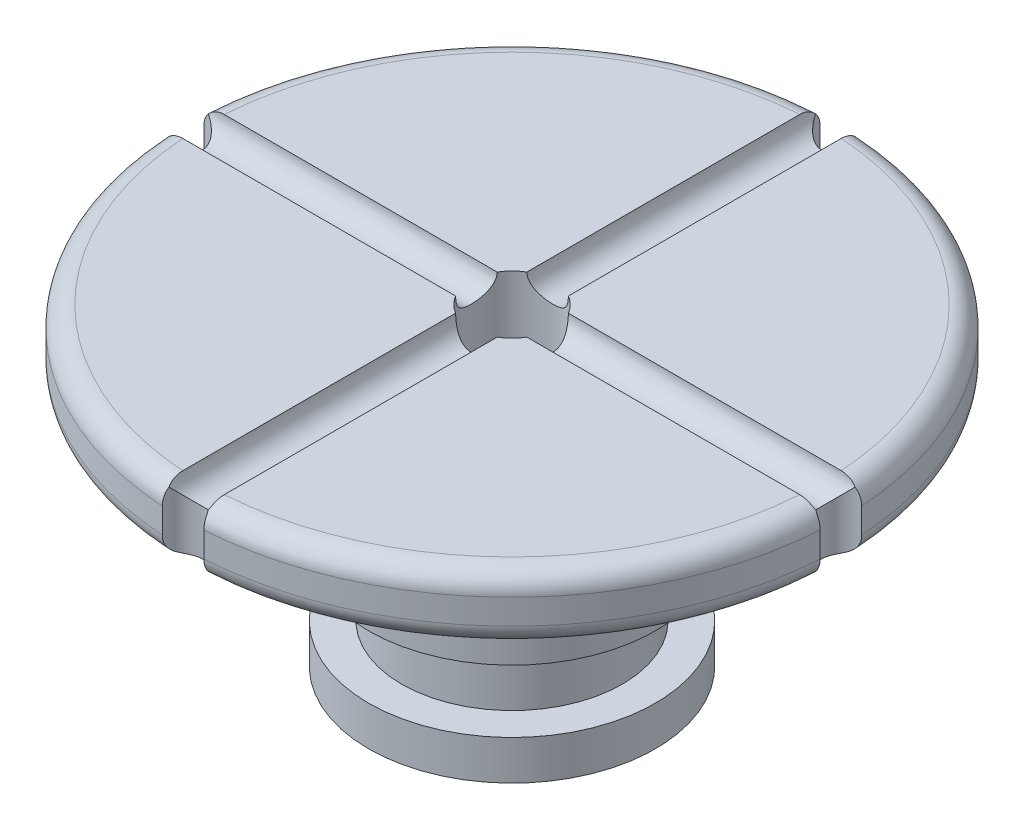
ISO-10303-21;
HEADER;
FILE_DESCRIPTION(('STEP AP214'),'2;1');
FILE_NAME('part.step','',(''),(''),'','','');
FILE_SCHEMA(('AUTOMOTIVE_DESIGN { 1 0 10303 214 1 1 1 1 }'));
ENDSEC;
DATA;
#1=APPLICATION_CONTEXT('core data for automotive mechanical design processes');
#2=APPLICATION_PROTOCOL_DEFINITION('international standard','automotive_design',2000,#1);
#3=PRODUCT_CONTEXT('',#1,'mechanical');
#4=PRODUCT('Part','Part','',(#3));
#5=PRODUCT_RELATED_PRODUCT_CATEGORY('part','',(#4));
#6=PRODUCT_DEFINITION_FORMATION('','',#4);
#7=PRODUCT_DEFINITION_CONTEXT('part definition',#1,'design');
#8=PRODUCT_DEFINITION('design','',#6,#7);
#9=PRODUCT_DEFINITION_SHAPE('','',#8);
#10=(LENGTH_UNIT() NAMED_UNIT(*) SI_UNIT(.MILLI.,.METRE.));
#11=(NAMED_UNIT(*) PLANE_ANGLE_UNIT() SI_UNIT($,.RADIAN.));
#12=(NAMED_UNIT(*) SI_UNIT($,.STERADIAN.) SOLID_ANGLE_UNIT());
#13=UNCERTAINTY_MEASURE_WITH_UNIT(LENGTH_MEASURE(1.E-05),#10,'distance_accuracy_value','');
#14=(GEOMETRIC_REPRESENTATION_CONTEXT(3) GLOBAL_UNCERTAINTY_ASSIGNED_CONTEXT((#13)) GLOBAL_UNIT_ASSIGNED_CONTEXT((#10,
#11,#12)) REPRESENTATION_CONTEXT('',''));
#15=CARTESIAN_POINT('',(0.,0.,0.));
#16=DIRECTION('',(0.,0.,1.));
#17=DIRECTION('',(1.,0.,0.));
#18=AXIS2_PLACEMENT_3D('',#15,#16,#17);
#19=CARTESIAN_POINT('',(0.,-1.7526,0.));
#20=DIRECTION('',(0.,1.,0.));
#21=DIRECTION('',(0.,0.,1.));
#22=AXIS2_PLACEMENT_3D('',#19,#20,#21);
#23=TOROIDAL_SURFACE('',#22,11.9126,0.7874);
#24=CARTESIAN_POINT('',(-12.6748283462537,-1.7524,-0.799203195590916));
#25=CARTESIAN_POINT('',(-12.6748340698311,-1.77436795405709,-0.799198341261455));
#26=CARTESIAN_POINT('',(-12.6739204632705,-1.79632563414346,-0.799160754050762));
#27=CARTESIAN_POINT('',(-12.6702664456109,-1.8400875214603,-0.79897706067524));
#28=CARTESIAN_POINT('',(-12.6675260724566,-1.86189173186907,-0.798830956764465));
#29=CARTESIAN_POINT('',(-12.6565778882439,-1.92690370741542,-0.798165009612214));
#30=CARTESIAN_POINT('',(-12.6456430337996,-1.96968253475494,-0.797417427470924));
#31=CARTESIAN_POINT('',(-12.6168608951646,-2.052825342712,-0.794469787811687));
#32=CARTESIAN_POINT('',(-12.5990069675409,-2.09318695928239,-0.792268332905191));
#33=CARTESIAN_POINT('',(-12.5570364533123,-2.17024161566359,-0.785098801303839));
#34=CARTESIAN_POINT('',(-12.5329247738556,-2.20693749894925,-0.780132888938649));
#35=CARTESIAN_POINT('',(-12.4804822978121,-2.27418027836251,-0.766121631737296));
#36=CARTESIAN_POINT('',(-12.4523361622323,-2.30490187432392,-0.757230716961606));
#37=CARTESIAN_POINT('',(-12.3928313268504,-2.36066159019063,-0.734067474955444));
#38=CARTESIAN_POINT('',(-12.3614778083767,-2.38570867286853,-0.71980373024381));
#39=CARTESIAN_POINT('',(-12.3021104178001,-2.42649413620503,-0.687429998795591));
#40=CARTESIAN_POINT('',(-12.2742180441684,-2.44303317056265,-0.670100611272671));
#41=CARTESIAN_POINT('',(-12.2193373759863,-2.47140737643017,-0.630785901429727));
#42=CARTESIAN_POINT('',(-12.1923491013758,-2.48324244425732,-0.608800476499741));
#43=CARTESIAN_POINT('',(-12.1423251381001,-2.50214505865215,-0.562080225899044));
#44=CARTESIAN_POINT('',(-12.1191491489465,-2.50945749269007,-0.53759184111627));
#45=CARTESIAN_POINT('',(-12.0758052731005,-2.52113469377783,-0.485464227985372));
#46=CARTESIAN_POINT('',(-12.0556384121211,-2.52549845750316,-0.457823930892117));
#47=CARTESIAN_POINT('',(-12.0170042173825,-2.53245172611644,-0.396986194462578));
#48=CARTESIAN_POINT('',(-11.9989352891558,-2.53480790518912,-0.363509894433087));
#49=CARTESIAN_POINT('',(-11.9677097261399,-2.53798702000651,-0.294269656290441));
#50=CARTESIAN_POINT('',(-11.9545559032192,-2.53880907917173,-0.258504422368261));
#51=CARTESIAN_POINT('',(-11.9320422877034,-2.53983194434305,-0.180534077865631));
#52=CARTESIAN_POINT('',(-11.9234307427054,-2.53993432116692,-0.138109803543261));
#53=CARTESIAN_POINT('',(-11.913153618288,-2.54001884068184,-0.0524286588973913));
#54=CARTESIAN_POINT('',(-11.9114891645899,-2.54000096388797,-0.00917165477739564));
#55=CARTESIAN_POINT('',(-11.9152267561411,-2.53999823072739,0.0788304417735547));
#56=CARTESIAN_POINT('',(-11.9209229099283,-2.54001476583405,0.123563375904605));
#57=CARTESIAN_POINT('',(-11.9397414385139,-2.53953112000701,0.211462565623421));
#58=CARTESIAN_POINT('',(-11.9528677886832,-2.53903066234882,0.254627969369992));
#59=CARTESIAN_POINT('',(-11.9861481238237,-2.53630219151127,0.338079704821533));
#60=CARTESIAN_POINT('',(-12.0062965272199,-2.53407554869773,0.378368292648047));
#61=CARTESIAN_POINT('',(-12.0528901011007,-2.52620931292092,0.454758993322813));
#62=CARTESIAN_POINT('',(-12.0793290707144,-2.52057307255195,0.490865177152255));
#63=CARTESIAN_POINT('',(-12.1349746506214,-2.50466639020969,0.555030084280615));
#64=CARTESIAN_POINT('',(-12.1638238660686,-2.49477611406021,0.58348969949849));
#65=CARTESIAN_POINT('',(-12.2239578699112,-2.46931413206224,0.634700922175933));
#66=CARTESIAN_POINT('',(-12.2552391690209,-2.45375045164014,0.657460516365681));
#67=CARTESIAN_POINT('',(-12.3133510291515,-2.41921781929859,0.69403651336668));
#68=CARTESIAN_POINT('',(-12.3401644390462,-2.40107807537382,0.708673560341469));
#69=CARTESIAN_POINT('',(-12.3924649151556,-2.36051562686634,0.733792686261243));
#70=CARTESIAN_POINT('',(-12.4179516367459,-2.33809181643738,0.744273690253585));
#71=CARTESIAN_POINT('',(-12.4660737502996,-2.28979010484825,0.761566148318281));
#72=CARTESIAN_POINT('',(-12.4887417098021,-2.26396054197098,0.768423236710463));
#73=CARTESIAN_POINT('',(-12.5307882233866,-2.20923799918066,0.779449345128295));
#74=CARTESIAN_POINT('',(-12.5501653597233,-2.18034370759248,0.78361720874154));
#75=CARTESIAN_POINT('',(-12.5872366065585,-2.1163759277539,0.790454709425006));
#76=CARTESIAN_POINT('',(-12.6044215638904,-2.08098088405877,0.792873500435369));
#77=CARTESIAN_POINT('',(-12.6333998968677,-2.00798395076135,0.796294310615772));
#78=CARTESIAN_POINT('',(-12.6451925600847,-1.97038177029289,0.797296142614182));
#79=CARTESIAN_POINT('',(-12.6610061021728,-1.90267131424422,0.798458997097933));
#80=CARTESIAN_POINT('',(-12.6661913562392,-1.87283151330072,0.798760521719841));
#81=CARTESIAN_POINT('',(-12.6731076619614,-1.81279695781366,0.799121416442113));
#82=CARTESIAN_POINT('',(-12.6748437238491,-1.78260278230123,0.799181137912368));
#83=CARTESIAN_POINT('',(-12.6748283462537,-1.7524,0.799203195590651));
#84=B_SPLINE_CURVE_WITH_KNOTS('',3,(#24,#25,#26,#27,#28,#29,#30,#31,#32,#33,#34,#35,#36,#37,#38,
#39,#40,#41,#42,#43,#44,#45,#46,#47,#48,#49,#50,#51,#52,#53,#54,#55,#56,#57,#58,#59,#60,#61,#62,
#63,#64,#65,#66,#67,#68,#69,#70,#71,#72,#73,#74,#75,#76,#77,#78,#79,#80,#81,#82,#83),
.UNSPECIFIED.,.F.,.F.,(4,2,2,2,2,2,2,2,2,2,2,2,2,2,2,2,2,2,2,2,2,2,2,2,2,2,2,2,2,4),(0.,
0.0658637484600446,0.131726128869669,0.263534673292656,0.395470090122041,0.527302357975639,
0.654354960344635,0.781205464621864,0.890908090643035,1.00061313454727,1.10368852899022,
1.20679897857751,1.32069453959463,1.4346551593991,1.56394339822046,1.69325258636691,
1.82789188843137,1.96260329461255,2.09720786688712,2.23168029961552,2.35604529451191,
2.48023504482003,2.58628867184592,2.69236971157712,2.79708101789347,2.90183732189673,
3.01962396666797,3.13742616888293,3.2280988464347,3.31863971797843),.UNSPECIFIED.);
#85=CARTESIAN_POINT('',(-12.6748283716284,-1.7526,-0.799203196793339));
#86=VERTEX_POINT('',#85);
#87=CARTESIAN_POINT('',(-11.9126,-2.54,-1.24757900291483E-13));
#88=VERTEX_POINT('',#87);
#89=EDGE_CURVE('E481',#86,#88,#84,.T.);
#90=ORIENTED_EDGE('',*,*,#89,.F.);
#91=CARTESIAN_POINT('',(0.,-1.7526,0.));
#92=DIRECTION('',(0.,1.,0.));
#93=DIRECTION('',(0.,0.,1.));
#94=AXIS2_PLACEMENT_3D('',#91,#92,#93);
#95=CIRCLE('',#94,12.7);
#96=CARTESIAN_POINT('',(-0.799203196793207,-1.7526,-12.6748283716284));
#97=VERTEX_POINT('',#96);
#98=EDGE_CURVE('E383',#97,#86,#95,.T.);
#99=ORIENTED_EDGE('',*,*,#98,.F.);
#100=CARTESIAN_POINT('',(0.799203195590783,-1.7524,-12.6748283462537));
#101=CARTESIAN_POINT('',(0.799198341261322,-1.77436795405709,-12.6748340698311));
#102=CARTESIAN_POINT('',(0.799160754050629,-1.79632563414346,-12.6739204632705));
#103=CARTESIAN_POINT('',(0.798977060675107,-1.8400875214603,-12.6702664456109));
#104=CARTESIAN_POINT('',(0.798830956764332,-1.86189173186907,-12.6675260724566));
#105=CARTESIAN_POINT('',(0.798165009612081,-1.92690370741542,-12.6565778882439));
#106=CARTESIAN_POINT('',(0.797417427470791,-1.96968253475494,-12.6456430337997));
#107=CARTESIAN_POINT('',(0.794469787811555,-2.052825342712,-12.6168608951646));
#108=CARTESIAN_POINT('',(0.792268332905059,-2.09318695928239,-12.599006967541));
#109=CARTESIAN_POINT('',(0.785098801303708,-2.17024161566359,-12.5570364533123));
#110=CARTESIAN_POINT('',(0.780132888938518,-2.20693749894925,-12.5329247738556));
#111=CARTESIAN_POINT('',(0.766121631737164,-2.27418027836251,-12.4804822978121));
#112=CARTESIAN_POINT('',(0.757230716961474,-2.30490187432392,-12.4523361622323));
#113=CARTESIAN_POINT('',(0.734067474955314,-2.36066159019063,-12.3928313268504));
#114=CARTESIAN_POINT('',(0.719803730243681,-2.38570867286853,-12.3614778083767));
#115=CARTESIAN_POINT('',(0.687429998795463,-2.42649413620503,-12.3021104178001));
#116=CARTESIAN_POINT('',(0.670100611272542,-2.44303317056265,-12.2742180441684));
#117=CARTESIAN_POINT('',(0.630785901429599,-2.47140737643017,-12.2193373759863));
#118=CARTESIAN_POINT('',(0.608800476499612,-2.48324244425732,-12.1923491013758));
#119=CARTESIAN_POINT('',(0.562080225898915,-2.50214505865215,-12.1423251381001));
#120=CARTESIAN_POINT('',(0.537591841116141,-2.50945749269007,-12.1191491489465));
#121=CARTESIAN_POINT('',(0.485464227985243,-2.52113469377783,-12.0758052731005));
#122=CARTESIAN_POINT('',(0.457823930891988,-2.52549845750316,-12.0556384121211));
#123=CARTESIAN_POINT('',(0.396986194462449,-2.53245172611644,-12.0170042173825));
#124=CARTESIAN_POINT('',(0.363509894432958,-2.53480790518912,-11.9989352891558));
#125=CARTESIAN_POINT('',(0.294269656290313,-2.53798702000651,-11.9677097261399));
#126=CARTESIAN_POINT('',(0.258504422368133,-2.53880907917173,-11.9545559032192));
#127=CARTESIAN_POINT('',(0.180534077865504,-2.53983194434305,-11.9320422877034));
#128=CARTESIAN_POINT('',(0.138109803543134,-2.53993432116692,-11.9234307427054));
#129=CARTESIAN_POINT('',(0.0524286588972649,-2.54001884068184,-11.913153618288));
#130=CARTESIAN_POINT('',(0.00917165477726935,-2.54000096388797,-11.9114891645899));
#131=CARTESIAN_POINT('',(-0.078830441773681,-2.53999823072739,-11.9152267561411));
#132=CARTESIAN_POINT('',(-0.123563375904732,-2.54001476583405,-11.9209229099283));
#133=CARTESIAN_POINT('',(-0.211462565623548,-2.53953112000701,-11.9397414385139));
#134=CARTESIAN_POINT('',(-0.254627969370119,-2.53903066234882,-11.9528677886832));
#135=CARTESIAN_POINT('',(-0.33807970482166,-2.53630219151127,-11.9861481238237));
#136=CARTESIAN_POINT('',(-0.378368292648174,-2.53407554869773,-12.0062965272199));
#137=CARTESIAN_POINT('',(-0.454758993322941,-2.52620931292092,-12.0528901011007));
#138=CARTESIAN_POINT('',(-0.490865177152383,-2.52057307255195,-12.0793290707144));
#139=CARTESIAN_POINT('',(-0.555030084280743,-2.50466639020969,-12.1349746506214));
#140=CARTESIAN_POINT('',(-0.583489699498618,-2.49477611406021,-12.1638238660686));
#141=CARTESIAN_POINT('',(-0.634700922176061,-2.46931413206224,-12.2239578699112));
#142=CARTESIAN_POINT('',(-0.657460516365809,-2.45375045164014,-12.2552391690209));
#143=CARTESIAN_POINT('',(-0.69403651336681,-2.41921781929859,-12.3133510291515));
#144=CARTESIAN_POINT('',(-0.708673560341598,-2.40107807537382,-12.3401644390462));
#145=CARTESIAN_POINT('',(-0.733792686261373,-2.36051562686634,-12.3924649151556));
#146=CARTESIAN_POINT('',(-0.744273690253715,-2.33809181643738,-12.4179516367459));
#147=CARTESIAN_POINT('',(-0.761566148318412,-2.28979010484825,-12.4660737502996));
#148=CARTESIAN_POINT('',(-0.768423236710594,-2.26396054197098,-12.4887417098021));
#149=CARTESIAN_POINT('',(-0.779449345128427,-2.20923799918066,-12.5307882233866));
#150=CARTESIAN_POINT('',(-0.783617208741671,-2.18034370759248,-12.5501653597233));
#151=CARTESIAN_POINT('',(-0.790454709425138,-2.1163759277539,-12.5872366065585));
#152=CARTESIAN_POINT('',(-0.792873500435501,-2.08098088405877,-12.6044215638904));
#153=CARTESIAN_POINT('',(-0.796294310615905,-2.00798395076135,-12.6333998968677));
#154=CARTESIAN_POINT('',(-0.797296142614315,-1.97038177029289,-12.6451925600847));
#155=CARTESIAN_POINT('',(-0.798458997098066,-1.90267131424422,-12.6610061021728));
#156=CARTESIAN_POINT('',(-0.798760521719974,-1.87283151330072,-12.6661913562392));
#157=CARTESIAN_POINT('',(-0.799121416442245,-1.81279695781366,-12.6731076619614));
#158=CARTESIAN_POINT('',(-0.7991811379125,-1.78260278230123,-12.6748437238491));
#159=CARTESIAN_POINT('',(-0.799203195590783,-1.7524,-12.6748283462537));
#160=B_SPLINE_CURVE_WITH_KNOTS('',3,(#100,#101,#102,#103,#104,#105,#106,#107,#108,#109,#110,
#111,#112,#113,#114,#115,#116,#117,#118,#119,#120,#121,#122,#123,#124,#125,#126,#127,#128,#129,
#130,#131,#132,#133,#134,#135,#136,#137,#138,#139,#140,#141,#142,#143,#144,#145,#146,#147,#148,
#149,#150,#151,#152,#153,#154,#155,#156,#157,#158,#159),.UNSPECIFIED.,.F.,.F.,(4,2,2,2,2,2,2,2,
2,2,2,2,2,2,2,2,2,2,2,2,2,2,2,2,2,2,2,2,2,4),(0.,0.0658637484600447,0.131726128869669,
0.263534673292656,0.395470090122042,0.527302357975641,0.654354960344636,0.781205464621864,
0.890908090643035,1.00061313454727,1.10368852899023,1.20679897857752,1.32069453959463,
1.43465515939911,1.56394339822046,1.69325258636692,1.82789188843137,1.96260329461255,
2.09720786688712,2.23168029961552,2.35604529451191,2.48023504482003,2.58628867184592,
2.69236971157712,2.79708101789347,2.90183732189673,3.01962396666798,3.13742616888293,
3.2280988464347,3.31863971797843),.UNSPECIFIED.);
#161=CARTESIAN_POINT('',(0.,-2.54,-11.9126));
#162=VERTEX_POINT('',#161);
#163=EDGE_CURVE('E300',#162,#97,#160,.T.);
#164=ORIENTED_EDGE('',*,*,#163,.F.);
#165=CARTESIAN_POINT('',(0.,-2.54,0.));
#166=DIRECTION('',(0.,1.,0.));
#167=DIRECTION('',(0.,0.,1.));
#168=AXIS2_PLACEMENT_3D('',#165,#166,#167);
#169=CIRCLE('',#168,11.9126);
#170=EDGE_CURVE('E388',#88,#162,#169,.F.);
#171=ORIENTED_EDGE('',*,*,#170,.F.);
#172=EDGE_LOOP('',(#90,#99,#164,#171));
#173=FACE_BOUND('',#172,.T.);
#174=ADVANCED_FACE('F28',(#173),#23,.T.);
#175=CARTESIAN_POINT('',(0.,0.,0.));
#176=DIRECTION('',(0.,1.,0.));
#177=DIRECTION('',(0.,0.,1.));
#178=AXIS2_PLACEMENT_3D('',#175,#176,#177);
#179=CYLINDRICAL_SURFACE('',#178,12.7);
#180=CARTESIAN_POINT('',(0.,-0.7874,0.));
#181=DIRECTION('',(0.,-1.,0.));
#182=DIRECTION('',(0.,0.,-1.));
#183=AXIS2_PLACEMENT_3D('',#180,#181,#182);
#184=CIRCLE('',#183,12.7);
#185=CARTESIAN_POINT('',(-0.799203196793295,-0.7874,12.6748283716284));
#186=VERTEX_POINT('',#185);
#187=CARTESIAN_POINT('',(-12.6748283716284,-0.7874,0.799203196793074));
#188=VERTEX_POINT('',#187);
#189=EDGE_CURVE('E431',#186,#188,#184,.T.);
#190=ORIENTED_EDGE('',*,*,#189,.T.);
#191=DIRECTION('',(0.,1.,0.));
#192=VECTOR('',#191,1.);
#193=CARTESIAN_POINT('',(-12.6748283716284,-6.0325,0.799203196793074));
#194=LINE('',#193,#192);
#195=CARTESIAN_POINT('',(-12.6748283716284,-1.7526,0.799203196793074));
#196=VERTEX_POINT('',#195);
#197=EDGE_CURVE('E796',#188,#196,#194,.F.);
#198=ORIENTED_EDGE('',*,*,#197,.T.);
#199=CARTESIAN_POINT('',(-0.799203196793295,-1.7526,12.6748283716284));
#200=VERTEX_POINT('',#199);
#201=EDGE_CURVE('E380',#196,#200,#95,.T.);
#202=ORIENTED_EDGE('',*,*,#201,.T.);
#203=DIRECTION('',(0.,1.,0.));
#204=VECTOR('',#203,1.);
#205=CARTESIAN_POINT('',(-0.799203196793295,-6.0325,12.6748283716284));
#206=LINE('',#205,#204);
#207=EDGE_CURVE('E358',#200,#186,#206,.T.);
#208=ORIENTED_EDGE('',*,*,#207,.T.);
#209=EDGE_LOOP('',(#190,#198,#202,#208));
#210=FACE_BOUND('',#209,.T.);
#211=ADVANCED_FACE('F504',(#210),#179,.T.);
#212=EDGE_CURVE('E467',#88,#196,#84,.T.);
#213=ORIENTED_EDGE('',*,*,#212,.F.);
#214=CARTESIAN_POINT('',(0.,-2.54,11.9126));
#215=VERTEX_POINT('',#214);
#216=EDGE_CURVE('E465',#215,#88,#169,.F.);
#217=ORIENTED_EDGE('',*,*,#216,.F.);
#218=CARTESIAN_POINT('',(-0.799203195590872,-1.7524,12.6748283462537));
#219=CARTESIAN_POINT('',(-0.799198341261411,-1.77436795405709,12.6748340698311));
#220=CARTESIAN_POINT('',(-0.799160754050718,-1.79632563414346,12.6739204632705));
#221=CARTESIAN_POINT('',(-0.798977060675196,-1.8400875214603,12.6702664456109));
#222=CARTESIAN_POINT('',(-0.798830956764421,-1.86189173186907,12.6675260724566));
#223=CARTESIAN_POINT('',(-0.79816500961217,-1.92690370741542,12.6565778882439));
#224=CARTESIAN_POINT('',(-0.797417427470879,-1.96968253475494,12.6456430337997));
#225=CARTESIAN_POINT('',(-0.794469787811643,-2.052825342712,12.6168608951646));
#226=CARTESIAN_POINT('',(-0.792268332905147,-2.09318695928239,12.5990069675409));
#227=CARTESIAN_POINT('',(-0.785098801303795,-2.17024161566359,12.5570364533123));
#228=CARTESIAN_POINT('',(-0.780132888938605,-2.20693749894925,12.5329247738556));
#229=CARTESIAN_POINT('',(-0.766121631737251,-2.27418027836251,12.4804822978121));
#230=CARTESIAN_POINT('',(-0.757230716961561,-2.30490187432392,12.4523361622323));
#231=CARTESIAN_POINT('',(-0.734067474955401,-2.36066159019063,12.3928313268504));
#232=CARTESIAN_POINT('',(-0.719803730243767,-2.38570867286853,12.3614778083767));
#233=CARTESIAN_POINT('',(-0.687429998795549,-2.42649413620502,12.3021104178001));
#234=CARTESIAN_POINT('',(-0.670100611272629,-2.44303317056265,12.2742180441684));
#235=CARTESIAN_POINT('',(-0.630785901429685,-2.47140737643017,12.2193373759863));
#236=CARTESIAN_POINT('',(-0.608800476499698,-2.48324244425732,12.1923491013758));
#237=CARTESIAN_POINT('',(-0.562080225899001,-2.50214505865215,12.1423251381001));
#238=CARTESIAN_POINT('',(-0.537591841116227,-2.50945749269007,12.1191491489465));
#239=CARTESIAN_POINT('',(-0.485464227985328,-2.52113469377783,12.0758052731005));
#240=CARTESIAN_POINT('',(-0.457823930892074,-2.52549845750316,12.0556384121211));
#241=CARTESIAN_POINT('',(-0.396986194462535,-2.53245172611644,12.0170042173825));
#242=CARTESIAN_POINT('',(-0.363509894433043,-2.53480790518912,11.9989352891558));
#243=CARTESIAN_POINT('',(-0.294269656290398,-2.53798702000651,11.9677097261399));
#244=CARTESIAN_POINT('',(-0.258504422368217,-2.53880907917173,11.9545559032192));
#245=CARTESIAN_POINT('',(-0.180534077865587,-2.53983194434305,11.9320422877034));
#246=CARTESIAN_POINT('',(-0.138109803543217,-2.53993432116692,11.9234307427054));
#247=CARTESIAN_POINT('',(-0.0524286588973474,-2.54001884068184,11.913153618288));
#248=CARTESIAN_POINT('',(-0.00917165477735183,-2.54000096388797,11.9114891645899));
#249=CARTESIAN_POINT('',(0.0788304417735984,-2.53999823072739,11.9152267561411));
#250=CARTESIAN_POINT('',(0.123563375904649,-2.54001476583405,11.9209229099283));
#251=CARTESIAN_POINT('',(0.211462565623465,-2.53953112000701,11.9397414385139));
#252=CARTESIAN_POINT('',(0.254627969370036,-2.53903066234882,11.9528677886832));
#253=CARTESIAN_POINT('',(0.338079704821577,-2.53630219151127,11.9861481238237));
#254=CARTESIAN_POINT('',(0.37836829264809,-2.53407554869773,12.0062965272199));
#255=CARTESIAN_POINT('',(0.454758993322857,-2.52620931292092,12.0528901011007));
#256=CARTESIAN_POINT('',(0.490865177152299,-2.52057307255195,12.0793290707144));
#257=CARTESIAN_POINT('',(0.555030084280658,-2.50466639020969,12.1349746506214));
#258=CARTESIAN_POINT('',(0.583489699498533,-2.49477611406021,12.1638238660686));
#259=CARTESIAN_POINT('',(0.634700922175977,-2.46931413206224,12.2239578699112));
#260=CARTESIAN_POINT('',(0.657460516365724,-2.45375045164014,12.2552391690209));
#261=CARTESIAN_POINT('',(0.694036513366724,-2.41921781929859,12.3133510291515));
#262=CARTESIAN_POINT('',(0.708673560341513,-2.40107807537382,12.3401644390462));
#263=CARTESIAN_POINT('',(0.733792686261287,-2.36051562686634,12.3924649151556));
#264=CARTESIAN_POINT('',(0.744273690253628,-2.33809181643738,12.4179516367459));
#265=CARTESIAN_POINT('',(0.761566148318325,-2.28979010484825,12.4660737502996));
#266=CARTESIAN_POINT('',(0.768423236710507,-2.26396054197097,12.4887417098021));
#267=CARTESIAN_POINT('',(0.779449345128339,-2.20923799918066,12.5307882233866));
#268=CARTESIAN_POINT('',(0.783617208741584,-2.18034370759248,12.5501653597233));
#269=CARTESIAN_POINT('',(0.79045470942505,-2.1163759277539,12.5872366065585));
#270=CARTESIAN_POINT('',(0.792873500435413,-2.08098088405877,12.6044215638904));
#271=CARTESIAN_POINT('',(0.796294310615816,-2.00798395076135,12.6333998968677));
#272=CARTESIAN_POINT('',(0.797296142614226,-1.97038177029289,12.6451925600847));
#273=CARTESIAN_POINT('',(0.798458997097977,-1.90267131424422,12.6610061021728));
#274=CARTESIAN_POINT('',(0.798760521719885,-1.87283151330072,12.6661913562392));
#275=CARTESIAN_POINT('',(0.799121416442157,-1.81279695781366,12.6731076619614));
#276=CARTESIAN_POINT('',(0.799181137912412,-1.78260278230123,12.6748437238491));
#277=CARTESIAN_POINT('',(0.799203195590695,-1.7524,12.6748283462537));
#278=B_SPLINE_CURVE_WITH_KNOTS('',3,(#218,#219,#220,#221,#222,#223,#224,#225,#226,#227,#228,
#229,#230,#231,#232,#233,#234,#235,#236,#237,#238,#239,#240,#241,#242,#243,#244,#245,#246,#247,
#248,#249,#250,#251,#252,#253,#254,#255,#256,#257,#258,#259,#260,#261,#262,#263,#264,#265,#266,
#267,#268,#269,#270,#271,#272,#273,#274,#275,#276,#277),.UNSPECIFIED.,.F.,.F.,(4,2,2,2,2,2,2,2,
2,2,2,2,2,2,2,2,2,2,2,2,2,2,2,2,2,2,2,2,2,4),(0.,0.0658637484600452,0.13172612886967,
0.263534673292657,0.395470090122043,0.527302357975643,0.654354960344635,0.781205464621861,
0.890908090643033,1.00061313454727,1.10368852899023,1.20679897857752,1.32069453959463,
1.43465515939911,1.56394339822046,1.69325258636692,1.82789188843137,1.96260329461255,
2.09720786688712,2.23168029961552,2.35604529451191,2.48023504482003,2.58628867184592,
2.69236971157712,2.79708101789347,2.90183732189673,3.01962396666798,3.13742616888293,
3.2280988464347,3.31863971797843),.UNSPECIFIED.);
#279=EDGE_CURVE('E333',#200,#215,#278,.T.);
#280=ORIENTED_EDGE('',*,*,#279,.F.);
#281=ORIENTED_EDGE('',*,*,#201,.F.);
#282=EDGE_LOOP('',(#213,#217,#280,#281));
#283=FACE_BOUND('',#282,.T.);
#284=ADVANCED_FACE('F463',(#283),#23,.T.);
#285=CARTESIAN_POINT('',(12.6748283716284,-0.7874,0.799203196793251));
#286=VERTEX_POINT('',#285);
#287=CARTESIAN_POINT('',(0.799203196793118,-0.7874,12.6748283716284));
#288=VERTEX_POINT('',#287);
#289=EDGE_CURVE('E373',#286,#288,#184,.T.);
#290=ORIENTED_EDGE('',*,*,#289,.T.);
#291=DIRECTION('',(0.,1.,0.));
#292=VECTOR('',#291,1.);
#293=CARTESIAN_POINT('',(0.799203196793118,-6.0325,12.6748283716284));
#294=LINE('',#293,#292);
#295=CARTESIAN_POINT('',(0.799203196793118,-1.7526,12.6748283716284));
#296=VERTEX_POINT('',#295);
#297=EDGE_CURVE('E334',#288,#296,#294,.F.);
#298=ORIENTED_EDGE('',*,*,#297,.T.);
#299=CARTESIAN_POINT('',(12.6748283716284,-1.7526,0.799203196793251));
#300=VERTEX_POINT('',#299);
#301=EDGE_CURVE('E370',#296,#300,#95,.T.);
#302=ORIENTED_EDGE('',*,*,#301,.T.);
#303=DIRECTION('',(0.,1.,0.));
#304=VECTOR('',#303,1.);
#305=CARTESIAN_POINT('',(12.6748283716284,-6.0325,0.799203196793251));
#306=LINE('',#305,#304);
#307=EDGE_CURVE('E449',#300,#286,#306,.T.);
#308=ORIENTED_EDGE('',*,*,#307,.T.);
#309=EDGE_LOOP('',(#290,#298,#302,#308));
#310=FACE_BOUND('',#309,.T.);
#311=ADVANCED_FACE('F368',(#310),#179,.T.);
#312=CARTESIAN_POINT('',(0.799203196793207,-0.7874,-12.6748283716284));
#313=VERTEX_POINT('',#312);
#314=CARTESIAN_POINT('',(12.6748283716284,-0.7874,-0.799203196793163));
#315=VERTEX_POINT('',#314);
#316=EDGE_CURVE('E384',#313,#315,#184,.T.);
#317=ORIENTED_EDGE('',*,*,#316,.T.);
#318=DIRECTION('',(0.,1.,0.));
#319=VECTOR('',#318,1.);
#320=CARTESIAN_POINT('',(12.6748283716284,-6.0325,-0.799203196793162));
#321=LINE('',#320,#319);
#322=CARTESIAN_POINT('',(12.6748283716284,-1.7526,-0.799203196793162));
#323=VERTEX_POINT('',#322);
#324=EDGE_CURVE('E454',#315,#323,#321,.F.);
#325=ORIENTED_EDGE('',*,*,#324,.T.);
#326=CARTESIAN_POINT('',(0.799203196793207,-1.7526,-12.6748283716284));
#327=VERTEX_POINT('',#326);
#328=EDGE_CURVE('E381',#323,#327,#95,.T.);
#329=ORIENTED_EDGE('',*,*,#328,.T.);
#330=DIRECTION('',(0.,1.,0.));
#331=VECTOR('',#330,1.);
#332=CARTESIAN_POINT('',(0.799203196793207,-6.0325,-12.6748283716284));
#333=LINE('',#332,#331);
#334=EDGE_CURVE('E291',#327,#313,#333,.T.);
#335=ORIENTED_EDGE('',*,*,#334,.T.);
#336=EDGE_LOOP('',(#317,#325,#329,#335));
#337=FACE_BOUND('',#336,.T.);
#338=ADVANCED_FACE('F475',(#337),#179,.T.);
#339=EDGE_CURVE('E326',#215,#296,#278,.T.);
#340=ORIENTED_EDGE('',*,*,#339,.F.);
#341=CARTESIAN_POINT('',(11.9126,-2.54,0.));
#342=VERTEX_POINT('',#341);
#343=EDGE_CURVE('E394',#342,#215,#169,.F.);
#344=ORIENTED_EDGE('',*,*,#343,.F.);
#345=CARTESIAN_POINT('',(12.6748283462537,-1.7524,0.799203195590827));
#346=CARTESIAN_POINT('',(12.6748340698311,-1.77436795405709,0.799198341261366));
#347=CARTESIAN_POINT('',(12.6739204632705,-1.79632563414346,0.799160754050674));
#348=CARTESIAN_POINT('',(12.6702664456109,-1.8400875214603,0.798977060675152));
#349=CARTESIAN_POINT('',(12.6675260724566,-1.86189173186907,0.798830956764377));
#350=CARTESIAN_POINT('',(12.6565778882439,-1.92690370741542,0.798165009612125));
#351=CARTESIAN_POINT('',(12.6456430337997,-1.96968253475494,0.797417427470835));
#352=CARTESIAN_POINT('',(12.6168608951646,-2.052825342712,0.794469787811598));
#353=CARTESIAN_POINT('',(12.599006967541,-2.0931869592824,0.792268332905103));
#354=CARTESIAN_POINT('',(12.5570364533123,-2.17024161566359,0.785098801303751));
#355=CARTESIAN_POINT('',(12.5329247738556,-2.20693749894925,0.780132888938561));
#356=CARTESIAN_POINT('',(12.4804822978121,-2.27418027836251,0.766121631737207));
#357=CARTESIAN_POINT('',(12.4523361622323,-2.30490187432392,0.757230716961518));
#358=CARTESIAN_POINT('',(12.3928313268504,-2.36066159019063,0.734067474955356));
#359=CARTESIAN_POINT('',(12.3614778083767,-2.38570867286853,0.719803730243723));
#360=CARTESIAN_POINT('',(12.3021104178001,-2.42649413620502,0.687429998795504));
#361=CARTESIAN_POINT('',(12.2742180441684,-2.44303317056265,0.670100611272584));
#362=CARTESIAN_POINT('',(12.2193373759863,-2.47140737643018,0.630785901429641));
#363=CARTESIAN_POINT('',(12.1923491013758,-2.48324244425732,0.608800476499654));
#364=CARTESIAN_POINT('',(12.1423251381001,-2.50214505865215,0.562080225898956));
#365=CARTESIAN_POINT('',(12.1191491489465,-2.50945749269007,0.537591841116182));
#366=CARTESIAN_POINT('',(12.0758052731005,-2.52113469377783,0.485464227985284));
#367=CARTESIAN_POINT('',(12.0556384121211,-2.52549845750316,0.45782393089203));
#368=CARTESIAN_POINT('',(12.0170042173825,-2.53245172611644,0.396986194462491));
#369=CARTESIAN_POINT('',(11.9989352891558,-2.53480790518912,0.363509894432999));
#370=CARTESIAN_POINT('',(11.9677097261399,-2.53798702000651,0.294269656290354));
#371=CARTESIAN_POINT('',(11.9545559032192,-2.53880907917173,0.258504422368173));
#372=CARTESIAN_POINT('',(11.9320422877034,-2.53983194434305,0.180534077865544));
#373=CARTESIAN_POINT('',(11.9234307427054,-2.53993432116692,0.138109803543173));
#374=CARTESIAN_POINT('',(11.913153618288,-2.54001884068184,0.052428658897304));
#375=CARTESIAN_POINT('',(11.9114891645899,-2.54000096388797,0.00917165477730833));
#376=CARTESIAN_POINT('',(11.9152267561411,-2.53999823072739,-0.078830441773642));
#377=CARTESIAN_POINT('',(11.9209229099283,-2.54001476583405,-0.123563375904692));
#378=CARTESIAN_POINT('',(11.9397414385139,-2.53953112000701,-0.211462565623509));
#379=CARTESIAN_POINT('',(11.9528677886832,-2.53903066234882,-0.25462796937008));
#380=CARTESIAN_POINT('',(11.9861481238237,-2.53630219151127,-0.338079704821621));
#381=CARTESIAN_POINT('',(12.0062965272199,-2.53407554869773,-0.378368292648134));
#382=CARTESIAN_POINT('',(12.0528901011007,-2.52620931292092,-0.454758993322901));
#383=CARTESIAN_POINT('',(12.0793290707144,-2.52057307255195,-0.490865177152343));
#384=CARTESIAN_POINT('',(12.1349746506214,-2.50466639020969,-0.555030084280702));
#385=CARTESIAN_POINT('',(12.1638238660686,-2.49477611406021,-0.583489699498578));
#386=CARTESIAN_POINT('',(12.2239578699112,-2.46931413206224,-0.634700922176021));
#387=CARTESIAN_POINT('',(12.2552391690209,-2.45375045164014,-0.657460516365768));
#388=CARTESIAN_POINT('',(12.3133510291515,-2.41921781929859,-0.694036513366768));
#389=CARTESIAN_POINT('',(12.3401644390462,-2.40107807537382,-0.708673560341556));
#390=CARTESIAN_POINT('',(12.3924649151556,-2.36051562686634,-0.73379268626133));
#391=CARTESIAN_POINT('',(12.4179516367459,-2.33809181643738,-0.744273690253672));
#392=CARTESIAN_POINT('',(12.4660737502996,-2.28979010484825,-0.761566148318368));
#393=CARTESIAN_POINT('',(12.4887417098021,-2.26396054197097,-0.768423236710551));
#394=CARTESIAN_POINT('',(12.5307882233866,-2.20923799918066,-0.779449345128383));
#395=CARTESIAN_POINT('',(12.5501653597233,-2.18034370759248,-0.783617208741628));
#396=CARTESIAN_POINT('',(12.5872366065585,-2.1163759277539,-0.790454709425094));
#397=CARTESIAN_POINT('',(12.6044215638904,-2.08098088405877,-0.792873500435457));
#398=CARTESIAN_POINT('',(12.6333998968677,-2.00798395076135,-0.796294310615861));
#399=CARTESIAN_POINT('',(12.6451925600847,-1.97038177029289,-0.797296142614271));
#400=CARTESIAN_POINT('',(12.6610061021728,-1.90267131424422,-0.798458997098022));
#401=CARTESIAN_POINT('',(12.6661913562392,-1.87283151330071,-0.79876052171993));
#402=CARTESIAN_POINT('',(12.6731076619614,-1.81279695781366,-0.799121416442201));
#403=CARTESIAN_POINT('',(12.6748437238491,-1.78260278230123,-0.799181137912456));
#404=CARTESIAN_POINT('',(12.6748283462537,-1.7524,-0.799203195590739));
#405=B_SPLINE_CURVE_WITH_KNOTS('',3,(#345,#346,#347,#348,#349,#350,#351,#352,#353,#354,#355,
#356,#357,#358,#359,#360,#361,#362,#363,#364,#365,#366,#367,#368,#369,#370,#371,#372,#373,#374,
#375,#376,#377,#378,#379,#380,#381,#382,#383,#384,#385,#386,#387,#388,#389,#390,#391,#392,#393,
#394,#395,#396,#397,#398,#399,#400,#401,#402,#403,#404),.UNSPECIFIED.,.F.,.F.,(4,2,2,2,2,2,2,2,
2,2,2,2,2,2,2,2,2,2,2,2,2,2,2,2,2,2,2,2,2,4),(0.,0.0658637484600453,0.13172612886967,
0.263534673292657,0.395470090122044,0.527302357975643,0.654354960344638,0.781205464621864,
0.890908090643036,1.00061313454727,1.10368852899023,1.20679897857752,1.32069453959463,
1.43465515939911,1.56394339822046,1.69325258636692,1.82789188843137,1.96260329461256,
2.09720786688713,2.23168029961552,2.35604529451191,2.48023504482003,2.58628867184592,
2.69236971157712,2.79708101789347,2.90183732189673,3.01962396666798,3.13742616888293,
3.2280988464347,3.31863971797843),.UNSPECIFIED.);
#406=EDGE_CURVE('E379',#300,#342,#405,.T.);
#407=ORIENTED_EDGE('',*,*,#406,.F.);
#408=ORIENTED_EDGE('',*,*,#301,.F.);
#409=EDGE_LOOP('',(#340,#344,#407,#408));
#410=FACE_BOUND('',#409,.T.);
#411=ADVANCED_FACE('F312',(#410),#23,.T.);
#412=CARTESIAN_POINT('',(1.5875,0.,0.));
#413=DIRECTION('',(0.,-1.,0.));
#414=DIRECTION('',(0.,0.,-1.));
#415=AXIS2_PLACEMENT_3D('',#412,#413,#414);
#416=PLANE('',#415);
#417=CARTESIAN_POINT('',(0.,0.,0.));
#418=DIRECTION('',(0.,1.,0.));
#419=DIRECTION('',(0.,0.,1.));
#420=AXIS2_PLACEMENT_3D('',#417,#418,#419);
#421=CIRCLE('',#420,1.5875);
#422=CARTESIAN_POINT('',(-1.37118836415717,0.,0.799999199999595));
#423=VERTEX_POINT('',#422);
#424=CARTESIAN_POINT('',(-0.799999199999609,0.,1.37118836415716));
#425=VERTEX_POINT('',#424);
#426=EDGE_CURVE('E492',#423,#425,#421,.T.);
#427=ORIENTED_EDGE('',*,*,#426,.F.);
#428=DIRECTION('',(-1.,0.,0.));
#429=VECTOR('',#428,1.);
#430=CARTESIAN_POINT('',(12.7,0.,0.799999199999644));
#431=LINE('',#430,#429);
#432=CARTESIAN_POINT('',(-11.8857073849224,0.,0.799999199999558));
#433=VERTEX_POINT('',#432);
#434=EDGE_CURVE('E273',#423,#433,#431,.T.);
#435=ORIENTED_EDGE('',*,*,#434,.T.);
#436=CARTESIAN_POINT('',(0.,0.,0.));
#437=DIRECTION('',(0.,-1.,0.));
#438=DIRECTION('',(0.,0.,-1.));
#439=AXIS2_PLACEMENT_3D('',#436,#437,#438);
#440=CIRCLE('',#439,11.9126);
#441=CARTESIAN_POINT('',(-0.799999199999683,0.,11.8857073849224));
#442=VERTEX_POINT('',#441);
#443=EDGE_CURVE('E426',#433,#442,#440,.F.);
#444=ORIENTED_EDGE('',*,*,#443,.T.);
#445=DIRECTION('',(0.,0.,-1.));
#446=VECTOR('',#445,1.);
#447=CARTESIAN_POINT('',(-0.799999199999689,0.,12.7000000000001));
#448=LINE('',#447,#446);
#449=EDGE_CURVE('E266',#442,#425,#448,.T.);
#450=ORIENTED_EDGE('',*,*,#449,.T.);
#451=EDGE_LOOP('',(#427,#435,#444,#450));
#452=FACE_BOUND('',#451,.T.);
#453=ADVANCED_FACE('F433',(#452),#416,.F.);
#454=CARTESIAN_POINT('',(0.799999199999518,0.,11.8857073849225));
#455=VERTEX_POINT('',#454);
#456=CARTESIAN_POINT('',(11.8857073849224,0.,0.799999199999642));
#457=VERTEX_POINT('',#456);
#458=EDGE_CURVE('E422',#455,#457,#440,.F.);
#459=ORIENTED_EDGE('',*,*,#458,.T.);
#460=CARTESIAN_POINT('',(1.37118836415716,0.,0.799999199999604));
#461=VERTEX_POINT('',#460);
#462=EDGE_CURVE('E235',#457,#461,#431,.T.);
#463=ORIENTED_EDGE('',*,*,#462,.T.);
#464=CARTESIAN_POINT('',(0.79999919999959,0.,1.37118836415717));
#465=VERTEX_POINT('',#464);
#466=EDGE_CURVE('E448',#465,#461,#421,.T.);
#467=ORIENTED_EDGE('',*,*,#466,.F.);
#468=DIRECTION('',(0.,0.,-1.));
#469=VECTOR('',#468,1.);
#470=CARTESIAN_POINT('',(0.799999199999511,0.,12.7000000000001));
#471=LINE('',#470,#469);
#472=EDGE_CURVE('E447',#465,#455,#471,.F.);
#473=ORIENTED_EDGE('',*,*,#472,.T.);
#474=EDGE_LOOP('',(#459,#463,#467,#473));
#475=FACE_BOUND('',#474,.T.);
#476=ADVANCED_FACE('F444',(#475),#416,.F.);
#477=CARTESIAN_POINT('',(-0.7999991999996,0.,-11.8857073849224));
#478=VERTEX_POINT('',#477);
#479=CARTESIAN_POINT('',(-11.8857073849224,0.,-0.799999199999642));
#480=VERTEX_POINT('',#479);
#481=EDGE_CURVE('E424',#478,#480,#440,.F.);
#482=ORIENTED_EDGE('',*,*,#481,.T.);
#483=DIRECTION('',(-1.,0.,0.));
#484=VECTOR('',#483,1.);
#485=CARTESIAN_POINT('',(12.7,0.,-0.799999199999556));
#486=LINE('',#485,#484);
#487=CARTESIAN_POINT('',(-1.37118836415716,0.,-0.799999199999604));
#488=VERTEX_POINT('',#487);
#489=EDGE_CURVE('E192',#480,#488,#486,.F.);
#490=ORIENTED_EDGE('',*,*,#489,.T.);
#491=CARTESIAN_POINT('',(-0.7999991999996,0.,-1.37118836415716));
#492=VERTEX_POINT('',#491);
#493=EDGE_CURVE('E489',#492,#488,#421,.T.);
#494=ORIENTED_EDGE('',*,*,#493,.F.);
#495=DIRECTION('',(0.,0.,1.));
#496=VECTOR('',#495,1.);
#497=CARTESIAN_POINT('',(-0.7999991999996,0.,-12.7));
#498=LINE('',#497,#496);
#499=EDGE_CURVE('E306',#492,#478,#498,.F.);
#500=ORIENTED_EDGE('',*,*,#499,.T.);
#501=EDGE_LOOP('',(#482,#490,#494,#500));
#502=FACE_BOUND('',#501,.T.);
#503=ADVANCED_FACE('F488',(#502),#416,.F.);
#504=CARTESIAN_POINT('',(0.,-0.7874,0.));
#505=DIRECTION('',(0.,-1.,0.));
#506=DIRECTION('',(0.,0.,-1.));
#507=AXIS2_PLACEMENT_3D('',#504,#505,#506);
#508=TOROIDAL_SURFACE('',#507,11.9126,0.7874);
#509=CARTESIAN_POINT('',(-12.6748283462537,-0.7876,0.799203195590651));
#510=CARTESIAN_POINT('',(-12.6748340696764,-0.765632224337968,0.799198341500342));
#511=CARTESIAN_POINT('',(-12.6739204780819,-0.743674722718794,0.799160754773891));
#512=CARTESIAN_POINT('',(-12.670266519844,-0.699913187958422,0.798977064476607));
#513=CARTESIAN_POINT('',(-12.6675261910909,-0.678109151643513,0.798830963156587));
#514=CARTESIAN_POINT('',(-12.6565780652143,-0.613096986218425,0.798165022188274));
#515=CARTESIAN_POINT('',(-12.6456431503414,-0.570317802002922,0.797417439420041));
#516=CARTESIAN_POINT('',(-12.6168608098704,-0.487174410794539,0.79446977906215));
#517=CARTESIAN_POINT('',(-12.5990067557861,-0.446812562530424,0.792268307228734));
#518=CARTESIAN_POINT('',(-12.5570361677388,-0.369757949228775,0.78509874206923));
#519=CARTESIAN_POINT('',(-12.5329246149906,-0.333062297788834,0.780132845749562));
#520=CARTESIAN_POINT('',(-12.4804825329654,-0.265820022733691,0.766121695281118));
#521=CARTESIAN_POINT('',(-12.4523366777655,-0.235098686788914,0.757230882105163));
#522=CARTESIAN_POINT('',(-12.3928318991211,-0.179338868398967,0.734067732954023));
#523=CARTESIAN_POINT('',(-12.36147809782,-0.154291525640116,0.719803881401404));
#524=CARTESIAN_POINT('',(-12.3021102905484,-0.113505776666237,0.687429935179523));
#525=CARTESIAN_POINT('',(-12.2742177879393,-0.0969666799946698,0.670100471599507));
#526=CARTESIAN_POINT('',(-12.2193371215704,-0.0685925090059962,0.63078567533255));
#527=CARTESIAN_POINT('',(-12.1923489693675,-0.0567574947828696,0.608800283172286));
#528=CARTESIAN_POINT('',(-12.142324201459,-0.0378545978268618,0.5620794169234));
#529=CARTESIAN_POINT('',(-12.1191473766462,-0.0305419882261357,0.537590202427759));
#530=CARTESIAN_POINT('',(-12.0758036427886,-0.0188649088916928,0.485461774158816));
#531=CARTESIAN_POINT('',(-12.0556375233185,-0.0145012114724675,0.457821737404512));
#532=CARTESIAN_POINT('',(-12.0170083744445,-0.00754921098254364,0.39699361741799));
#533=CARTESIAN_POINT('',(-11.9989430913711,-0.00519388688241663,0.363527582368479));
#534=CARTESIAN_POINT('',(-11.9677141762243,-0.00201243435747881,0.294279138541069));
#535=CARTESIAN_POINT('',(-11.9545552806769,-0.00118778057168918,0.258494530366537));
#536=CARTESIAN_POINT('',(-11.9376456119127,-0.000424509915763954,0.199944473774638));
#537=CARTESIAN_POINT('',(-11.9322334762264,-0.000264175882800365,0.177645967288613));
#538=CARTESIAN_POINT('',(-11.9233411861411,-6.90091984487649E-05,0.132657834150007));
#539=CARTESIAN_POINT('',(-11.9198613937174,-3.42000542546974E-05,0.109968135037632));
#540=CARTESIAN_POINT('',(-11.9148636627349,1.4087041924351E-06,0.0643685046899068));
#541=CARTESIAN_POINT('',(-11.9133462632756,2.19897485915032E-06,0.0414585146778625));
#542=CARTESIAN_POINT('',(-11.9122828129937,-2.26468923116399E-06,-0.00440407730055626));
#543=CARTESIAN_POINT('',(-11.912736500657,-7.51782211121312E-06,-0.0273566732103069));
#544=CARTESIAN_POINT('',(-11.9141793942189,-1.80367056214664E-06,-0.0502479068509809));
#545=B_SPLINE_CURVE_WITH_KNOTS('',3,(#509,#510,#511,#512,#513,#514,#515,#516,#517,#518,#519,
#520,#521,#522,#523,#524,#525,#526,#527,#528,#529,#530,#531,#532,#533,#534,#535,#536,#537,#538,
#539,#540,#541,#542,#543,#544),.UNSPECIFIED.,.F.,.F.,(4,2,2,2,2,2,2,2,2,2,2,2,2,2,2,2,2,4),(0.,
0.0658632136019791,0.131725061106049,0.263534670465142,0.395470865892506,0.527302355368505,
0.654353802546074,0.78120546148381,0.890908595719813,1.00061313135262,1.1036925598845,
1.20679897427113,1.32067224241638,1.43465515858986,1.50341966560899,1.57219704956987,
1.64099332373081,1.70978047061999),.UNSPECIFIED.);
#546=CARTESIAN_POINT('',(-12.4577251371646,-0.242274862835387,0.758385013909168));
#547=VERTEX_POINT('',#546);
#548=EDGE_CURVE('E43',#188,#547,#545,.T.);
#549=ORIENTED_EDGE('',*,*,#548,.F.);
#550=ORIENTED_EDGE('',*,*,#189,.F.);
#551=CARTESIAN_POINT('',(0.0497628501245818,-1.73496596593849E-06,11.9141490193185));
#552=CARTESIAN_POINT('',(0.0274520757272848,-6.68818977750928E-06,11.9127566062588));
#553=CARTESIAN_POINT('',(0.00508384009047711,-2.02876869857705E-06,11.9123034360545));
#554=CARTESIAN_POINT('',(-0.0396115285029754,1.97885885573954E-06,11.9132691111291));
#555=CARTESIAN_POINT('',(-0.0619386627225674,1.32723134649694E-06,11.9146878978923));
#556=CARTESIAN_POINT('',(-0.106427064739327,-2.98418958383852E-05,11.9193940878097));
#557=CARTESIAN_POINT('',(-0.128588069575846,-6.03994951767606E-05,11.922683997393));
#558=CARTESIAN_POINT('',(-0.172550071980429,-0.000234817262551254,11.9311066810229));
#559=CARTESIAN_POINT('',(-0.194351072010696,-0.000378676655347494,11.9362394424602));
#560=CARTESIAN_POINT('',(-0.259021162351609,-0.0011497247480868,11.9543672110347));
#561=CARTESIAN_POINT('',(-0.301159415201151,-0.00211636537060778,11.970091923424));
#562=CARTESIAN_POINT('',(-0.382094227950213,-0.00633516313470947,12.008309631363));
#563=CARTESIAN_POINT('',(-0.420892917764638,-0.00958585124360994,12.0307982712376));
#564=CARTESIAN_POINT('',(-0.492638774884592,-0.0199730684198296,12.0807895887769));
#565=CARTESIAN_POINT('',(-0.525738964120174,-0.0269750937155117,12.1080979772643));
#566=CARTESIAN_POINT('',(-0.586342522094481,-0.0463831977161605,12.1666870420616));
#567=CARTESIAN_POINT('',(-0.613855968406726,-0.0587794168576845,12.1979603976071));
#568=CARTESIAN_POINT('',(-0.65896036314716,-0.0877846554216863,12.2575889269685));
#569=CARTESIAN_POINT('',(-0.677409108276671,-0.103532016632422,12.2857174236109));
#570=CARTESIAN_POINT('',(-0.709539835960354,-0.139893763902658,12.3415518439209));
#571=CARTESIAN_POINT('',(-0.723221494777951,-0.16050848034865,12.3692577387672));
#572=CARTESIAN_POINT('',(-0.745432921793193,-0.204603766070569,12.4207699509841));
#573=CARTESIAN_POINT('',(-0.754258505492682,-0.227778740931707,12.4447134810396));
#574=CARTESIAN_POINT('',(-0.768819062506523,-0.277475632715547,12.4898965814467));
#575=CARTESIAN_POINT('',(-0.774553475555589,-0.303998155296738,12.5111356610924));
#576=CARTESIAN_POINT('',(-0.784122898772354,-0.362468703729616,12.552087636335));
#577=CARTESIAN_POINT('',(-0.787723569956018,-0.394693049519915,12.5714598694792));
#578=CARTESIAN_POINT('',(-0.793078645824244,-0.461675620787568,12.6055364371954));
#579=CARTESIAN_POINT('',(-0.794831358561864,-0.496436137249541,12.6202364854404));
#580=CARTESIAN_POINT('',(-0.797474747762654,-0.573119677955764,12.6464006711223));
#581=CARTESIAN_POINT('',(-0.798196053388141,-0.615333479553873,12.657045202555));
#582=CARTESIAN_POINT('',(-0.798840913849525,-0.679488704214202,12.6677104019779));
#583=CARTESIAN_POINT('',(-0.798982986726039,-0.701021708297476,12.6703818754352));
#584=CARTESIAN_POINT('',(-0.799161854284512,-0.744232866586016,12.6739434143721));
#585=CARTESIAN_POINT('',(-0.799198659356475,-0.765911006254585,12.6748336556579));
#586=CARTESIAN_POINT('',(-0.799203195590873,-0.7876,12.6748283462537));
#587=B_SPLINE_CURVE_WITH_KNOTS('',3,(#551,#552,#553,#554,#555,#556,#557,#558,#559,#560,#561,
#562,#563,#564,#565,#566,#567,#568,#569,#570,#571,#572,#573,#574,#575,#576,#577,#578,#579,#580,
#581,#582,#583,#584,#585,#586),.UNSPECIFIED.,.F.,.F.,(4,2,2,2,2,2,2,2,2,2,2,2,2,2,2,2,2,4),(0.,
0.0670408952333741,0.134079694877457,0.201208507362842,0.268336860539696,0.40258739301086,
0.536751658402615,0.666399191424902,0.795810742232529,0.906620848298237,1.01743847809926,
1.12042252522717,1.22342523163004,1.33628693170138,1.44925187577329,1.579212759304,
1.64424561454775,1.70927205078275),.UNSPECIFIED.);
#588=CARTESIAN_POINT('',(-0.7583850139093,-0.242274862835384,12.4577251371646));
#589=VERTEX_POINT('',#588);
#590=EDGE_CURVE('E354',#589,#186,#587,.T.);
#591=ORIENTED_EDGE('',*,*,#590,.F.);
#592=CARTESIAN_POINT('',(-0.617925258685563,-0.495560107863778,11.1641928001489));
#593=CARTESIAN_POINT('',(-0.638820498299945,-0.470148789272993,11.1731948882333));
#594=CARTESIAN_POINT('',(-0.657829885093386,-0.443818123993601,11.1841580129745));
#595=CARTESIAN_POINT('',(-0.691715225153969,-0.390647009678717,11.2104879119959));
#596=CARTESIAN_POINT('',(-0.706584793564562,-0.363805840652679,11.22586141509));
#597=CARTESIAN_POINT('',(-0.732228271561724,-0.311120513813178,11.2609837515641));
#598=CARTESIAN_POINT('',(-0.743008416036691,-0.285274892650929,11.2807258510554));
#599=CARTESIAN_POINT('',(-0.760990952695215,-0.235791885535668,11.3241789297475));
#600=CARTESIAN_POINT('',(-0.768192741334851,-0.212154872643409,11.3478905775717));
#601=CARTESIAN_POINT('',(-0.779788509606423,-0.167900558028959,11.3987442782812));
#602=CARTESIAN_POINT('',(-0.784170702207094,-0.147296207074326,11.425900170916));
#603=CARTESIAN_POINT('',(-0.790898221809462,-0.10978905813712,11.482881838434));
#604=CARTESIAN_POINT('',(-0.793242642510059,-0.0928879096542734,11.5127087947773));
#605=CARTESIAN_POINT('',(-0.796898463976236,-0.060868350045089,11.5790890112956));
#606=CARTESIAN_POINT('',(-0.797998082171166,-0.0464137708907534,11.6159747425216));
#607=CARTESIAN_POINT('',(-0.799378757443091,-0.0231981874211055,11.6915135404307));
#608=CARTESIAN_POINT('',(-0.79965943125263,-0.0144398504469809,11.730167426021));
#609=CARTESIAN_POINT('',(-0.799988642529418,-0.00219453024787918,11.8124265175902));
#610=CARTESIAN_POINT('',(-0.800010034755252,0.000650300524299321,11.8561289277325));
#611=CARTESIAN_POINT('',(-0.799984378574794,-0.000900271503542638,11.9434074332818));
#612=CARTESIAN_POINT('',(-0.799937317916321,-0.00529697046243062,11.9869835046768));
#613=CARTESIAN_POINT('',(-0.799415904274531,-0.0213541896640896,12.073616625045));
#614=CARTESIAN_POINT('',(-0.798933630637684,-0.0331481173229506,12.1166489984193));
#615=CARTESIAN_POINT('',(-0.796586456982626,-0.063745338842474,12.2001263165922));
#616=CARTESIAN_POINT('',(-0.794721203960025,-0.0825504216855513,12.2405705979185));
#617=CARTESIAN_POINT('',(-0.788242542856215,-0.126284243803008,12.3173315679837));
#618=CARTESIAN_POINT('',(-0.783652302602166,-0.151160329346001,12.3536800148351));
#619=CARTESIAN_POINT('',(-0.770159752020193,-0.205942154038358,12.4214458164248));
#620=CARTESIAN_POINT('',(-0.761262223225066,-0.235842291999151,12.452868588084));
#621=CARTESIAN_POINT('',(-0.738714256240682,-0.29617956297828,12.5073955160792));
#622=CARTESIAN_POINT('',(-0.725530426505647,-0.326356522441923,12.5309789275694));
#623=CARTESIAN_POINT('',(-0.693667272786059,-0.387511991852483,12.5727697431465));
#624=CARTESIAN_POINT('',(-0.674991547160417,-0.418489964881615,12.5909806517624));
#625=CARTESIAN_POINT('',(-0.634297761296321,-0.476118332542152,12.6205779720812));
#626=CARTESIAN_POINT('',(-0.612811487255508,-0.502888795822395,12.6324695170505));
#627=CARTESIAN_POINT('',(-0.565750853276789,-0.554130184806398,12.6525233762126));
#628=CARTESIAN_POINT('',(-0.54017541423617,-0.578600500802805,12.6606847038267));
#629=CARTESIAN_POINT('',(-0.4848181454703,-0.624831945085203,12.6741753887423));
#630=CARTESIAN_POINT('',(-0.454942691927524,-0.646503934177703,12.6794238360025));
#631=CARTESIAN_POINT('',(-0.392260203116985,-0.685625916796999,12.6876231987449));
#632=CARTESIAN_POINT('',(-0.359451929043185,-0.70307411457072,12.6905731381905));
#633=CARTESIAN_POINT('',(-0.287832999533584,-0.734973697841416,12.6952284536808));
#634=CARTESIAN_POINT('',(-0.248762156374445,-0.748867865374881,12.696756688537));
#635=CARTESIAN_POINT('',(-0.168917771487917,-0.770459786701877,12.698831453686));
#636=CARTESIAN_POINT('',(-0.128143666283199,-0.778155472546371,12.6993776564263));
#637=CARTESIAN_POINT('',(-0.042916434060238,-0.787477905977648,12.7000199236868));
#638=CARTESIAN_POINT('',(0.00158999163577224,-0.788627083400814,12.7000806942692));
#639=CARTESIAN_POINT('',(0.0901847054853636,-0.783539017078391,12.6997513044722));
#640=CARTESIAN_POINT('',(0.134272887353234,-0.777299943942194,12.6993610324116));
#641=CARTESIAN_POINT('',(0.221288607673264,-0.757497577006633,12.6976419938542));
#642=CARTESIAN_POINT('',(0.264197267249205,-0.743851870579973,12.6963026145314));
#643=CARTESIAN_POINT('',(0.347049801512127,-0.709604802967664,12.6916582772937));
#644=CARTESIAN_POINT('',(0.386993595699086,-0.689003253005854,12.6883532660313));
#645=CARTESIAN_POINT('',(0.461628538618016,-0.642240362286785,12.6785079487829));
#646=CARTESIAN_POINT('',(0.496428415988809,-0.616235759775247,12.67205309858));
#647=CARTESIAN_POINT('',(0.560721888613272,-0.55964409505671,12.6545295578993));
#648=CARTESIAN_POINT('',(0.590222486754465,-0.529063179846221,12.6434670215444));
#649=CARTESIAN_POINT('',(0.640207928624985,-0.468620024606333,12.6170295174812));
#650=CARTESIAN_POINT('',(0.66131448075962,-0.439020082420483,12.602230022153));
#651=CARTESIAN_POINT('',(0.698263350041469,-0.379492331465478,12.5675895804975));
#652=CARTESIAN_POINT('',(0.7141074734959,-0.349564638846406,12.5477503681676));
#653=CARTESIAN_POINT('',(0.739758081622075,-0.293556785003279,12.5049365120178));
#654=CARTESIAN_POINT('',(0.749945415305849,-0.267360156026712,12.4823383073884));
#655=CARTESIAN_POINT('',(0.766733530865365,-0.21746040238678,12.4333777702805));
#656=CARTESIAN_POINT('',(0.773333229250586,-0.193758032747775,12.407014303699));
#657=CARTESIAN_POINT('',(0.784054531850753,-0.148517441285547,12.3494939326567));
#658=CARTESIAN_POINT('',(0.788012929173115,-0.127180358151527,12.318149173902));
#659=CARTESIAN_POINT('',(0.793836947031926,-0.0890619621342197,12.2526238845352));
#660=CARTESIAN_POINT('',(0.795701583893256,-0.0722827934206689,12.2184420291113));
#661=CARTESIAN_POINT('',(0.79837747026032,-0.0421565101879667,12.1440341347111));
#662=CARTESIAN_POINT('',(0.799046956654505,-0.0294061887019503,12.103560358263));
#663=CARTESIAN_POINT('',(0.799818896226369,-0.0105239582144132,12.0210921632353));
#664=CARTESIAN_POINT('',(0.799921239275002,-0.00439333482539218,11.9790974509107));
#665=CARTESIAN_POINT('',(0.800023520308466,0.00121097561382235,11.8926317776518));
#666=CARTESIAN_POINT('',(0.800018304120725,0.000350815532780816,11.8481387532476));
#667=CARTESIAN_POINT('',(0.799823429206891,-0.00881034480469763,11.7599043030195));
#668=CARTESIAN_POINT('',(0.799633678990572,-0.0171150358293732,11.716163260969));
#669=CARTESIAN_POINT('',(0.798386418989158,-0.0409822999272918,11.6306087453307));
#670=CARTESIAN_POINT('',(0.797326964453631,-0.0565611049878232,11.5887998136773));
#671=CARTESIAN_POINT('',(0.793106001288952,-0.0945694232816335,11.5085362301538));
#672=CARTESIAN_POINT('',(0.789946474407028,-0.116992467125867,11.4700784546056));
#673=CARTESIAN_POINT('',(0.780871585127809,-0.162890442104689,11.4050040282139));
#674=CARTESIAN_POINT('',(0.775616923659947,-0.185299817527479,11.377543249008));
#675=CARTESIAN_POINT('',(0.761761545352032,-0.233268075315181,11.3264963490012));
#676=CARTESIAN_POINT('',(0.753164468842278,-0.258823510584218,11.3029060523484));
#677=CARTESIAN_POINT('',(0.731782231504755,-0.312076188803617,11.2601482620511));
#678=CARTESIAN_POINT('',(0.718975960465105,-0.339783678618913,11.2410039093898));
#679=CARTESIAN_POINT('',(0.688775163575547,-0.395655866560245,11.2076321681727));
#680=CARTESIAN_POINT('',(0.671381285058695,-0.423820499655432,11.1934040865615));
#681=CARTESIAN_POINT('',(0.633775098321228,-0.476638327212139,11.1706260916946));
#682=CARTESIAN_POINT('',(0.613921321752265,-0.501387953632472,11.1617001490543));
#683=CARTESIAN_POINT('',(0.570842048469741,-0.548840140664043,11.1471988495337));
#684=CARTESIAN_POINT('',(0.547615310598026,-0.571541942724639,11.1416247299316));
#685=CARTESIAN_POINT('',(0.496442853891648,-0.615736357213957,11.1327434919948));
#686=CARTESIAN_POINT('',(0.468273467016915,-0.637009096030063,11.1296387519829));
#687=CARTESIAN_POINT('',(0.409271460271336,-0.675707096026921,11.125428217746));
#688=CARTESIAN_POINT('',(0.378437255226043,-0.693130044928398,11.1243236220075));
#689=CARTESIAN_POINT('',(0.309399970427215,-0.726307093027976,11.1231265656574));
#690=CARTESIAN_POINT('',(0.270825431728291,-0.741298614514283,11.123233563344));
#691=CARTESIAN_POINT('',(0.19182878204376,-0.765160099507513,11.1238398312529));
#692=CARTESIAN_POINT('',(0.151406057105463,-0.774028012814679,11.1243392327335));
#693=CARTESIAN_POINT('',(0.0661747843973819,-0.78591444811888,11.1250670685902));
#694=CARTESIAN_POINT('',(0.021286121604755,-0.788369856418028,11.1252687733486));
#695=CARTESIAN_POINT('',(-0.0682738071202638,-0.785740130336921,11.1250817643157));
#696=CARTESIAN_POINT('',(-0.112945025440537,-0.780653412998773,11.1246929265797));
#697=CARTESIAN_POINT('',(-0.200920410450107,-0.76306371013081,11.1238000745));
#698=CARTESIAN_POINT('',(-0.24422070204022,-0.750541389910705,11.1232957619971));
#699=CARTESIAN_POINT('',(-0.328138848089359,-0.718396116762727,11.1233048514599));
#700=CARTESIAN_POINT('',(-0.368755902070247,-0.698771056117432,11.123818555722));
#701=CARTESIAN_POINT('',(-0.440517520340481,-0.656320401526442,11.1272683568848));
#702=CARTESIAN_POINT('',(-0.472186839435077,-0.634350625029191,11.1298484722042));
#703=CARTESIAN_POINT('',(-0.531718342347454,-0.586369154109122,11.1382558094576));
#704=CARTESIAN_POINT('',(-0.559593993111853,-0.560372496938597,11.1440711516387));
#705=CARTESIAN_POINT('',(-0.596551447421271,-0.520749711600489,11.1556783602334));
#706=CARTESIAN_POINT('',(-0.607474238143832,-0.508269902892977,11.1596902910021));
#707=CARTESIAN_POINT('',(-0.617925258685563,-0.495560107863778,11.1641928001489));
#708=B_SPLINE_CURVE_WITH_KNOTS('',3,(#592,#593,#594,#595,#596,#597,#598,#599,#600,#601,#602,
#603,#604,#605,#606,#607,#608,#609,#610,#611,#612,#613,#614,#615,#616,#617,#618,#619,#620,#621,
#622,#623,#624,#625,#626,#627,#628,#629,#630,#631,#632,#633,#634,#635,#636,#637,#638,#639,#640,
#641,#642,#643,#644,#645,#646,#647,#648,#649,#650,#651,#652,#653,#654,#655,#656,#657,#658,#659,
#660,#661,#662,#663,#664,#665,#666,#667,#668,#669,#670,#671,#672,#673,#674,#675,#676,#677,#678,
#679,#680,#681,#682,#683,#684,#685,#686,#687,#688,#689,#690,#691,#692,#693,#694,#695,#696,#697,
#698,#699,#700,#701,#702,#703,#704,#705,#706,#707),.UNSPECIFIED.,.T.,.F.,(4,2,2,2,2,2,2,2,2,2,2,
2,2,2,2,2,2,2,2,2,2,2,2,2,2,2,2,2,2,2,2,2,2,2,2,2,2,2,2,2,2,2,2,2,2,2,2,2,2,2,2,2,2,2,2,2,2,4),
(0.,0.102269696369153,0.204696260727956,0.306966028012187,0.409253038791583,0.51196491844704,
0.61472245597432,0.733134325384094,0.851601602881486,0.982376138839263,1.11317408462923,
1.24640158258,1.37966309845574,1.51180753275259,1.64380560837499,1.76461911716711,
1.88535364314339,1.99383129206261,2.10233761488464,2.21372372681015,2.32515711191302,
2.44911464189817,2.57311350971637,2.70605259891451,2.83902461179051,2.97350745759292,
3.10799395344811,3.2390191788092,3.36986996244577,3.4869675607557,3.60402492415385,
3.71174306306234,3.8194937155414,3.93340326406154,4.04736630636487,4.17412370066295,
4.30090570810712,4.43377656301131,4.56671332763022,4.69994816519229,4.83305745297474,
4.94010462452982,5.04703553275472,5.15451112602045,5.2619715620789,5.36042306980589,
5.45891089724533,5.56481699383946,5.67078652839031,5.79442424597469,5.91810333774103,
6.05232615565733,6.18657714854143,6.32117877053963,6.45582036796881,6.57125670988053,
6.68627194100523,6.73742343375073),.UNSPECIFIED.);
#709=EDGE_CURVE('E404',#442,#589,#708,.T.);
#710=ORIENTED_EDGE('',*,*,#709,.F.);
#711=ORIENTED_EDGE('',*,*,#443,.F.);
#712=CARTESIAN_POINT('',(-12.5788328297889,-0.398977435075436,-0.686062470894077));
#713=CARTESIAN_POINT('',(-12.5963936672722,-0.428215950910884,-0.668513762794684));
#714=CARTESIAN_POINT('',(-12.6115340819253,-0.457415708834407,-0.648425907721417));
#715=CARTESIAN_POINT('',(-12.6372793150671,-0.514009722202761,-0.603364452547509));
#716=CARTESIAN_POINT('',(-12.6478790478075,-0.541401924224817,-0.578385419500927));
#717=CARTESIAN_POINT('',(-12.6652363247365,-0.592840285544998,-0.524279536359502));
#718=CARTESIAN_POINT('',(-12.6720104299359,-0.616900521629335,-0.495171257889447));
#719=CARTESIAN_POINT('',(-12.6827184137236,-0.66085031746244,-0.433504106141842));
#720=CARTESIAN_POINT('',(-12.6866515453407,-0.680738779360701,-0.400944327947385));
#721=CARTESIAN_POINT('',(-12.6927689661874,-0.716703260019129,-0.331288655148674));
#722=CARTESIAN_POINT('',(-12.6948428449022,-0.732503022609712,-0.294040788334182));
#723=CARTESIAN_POINT('',(-12.6977632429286,-0.75831508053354,-0.217547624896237));
#724=CARTESIAN_POINT('',(-12.6986094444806,-0.768325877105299,-0.178301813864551));
#725=CARTESIAN_POINT('',(-12.6997427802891,-0.78293556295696,-0.0951786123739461));
#726=CARTESIAN_POINT('',(-12.6999732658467,-0.786971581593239,-0.0512005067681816));
#727=CARTESIAN_POINT('',(-12.7000226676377,-0.787763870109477,0.0368277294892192));
#728=CARTESIAN_POINT('',(-12.6998414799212,-0.784518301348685,0.0808778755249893));
#729=CARTESIAN_POINT('',(-12.6988107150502,-0.770700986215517,0.168688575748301));
#730=CARTESIAN_POINT('',(-12.6979482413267,-0.759988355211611,0.212426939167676));
#731=CARTESIAN_POINT('',(-12.6947225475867,-0.731402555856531,0.297460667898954));
#732=CARTESIAN_POINT('',(-12.6923590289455,-0.713527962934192,0.338755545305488));
#733=CARTESIAN_POINT('',(-12.6849193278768,-0.671549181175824,0.417018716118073));
#734=CARTESIAN_POINT('',(-12.6798835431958,-0.647540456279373,0.454041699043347));
#735=CARTESIAN_POINT('',(-12.6656707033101,-0.594235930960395,0.523150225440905));
#736=CARTESIAN_POINT('',(-12.6564984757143,-0.564946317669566,0.555241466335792));
#737=CARTESIAN_POINT('',(-12.6337392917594,-0.505635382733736,0.610725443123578));
#738=CARTESIAN_POINT('',(-12.6206307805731,-0.475923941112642,0.634644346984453));
#739=CARTESIAN_POINT('',(-12.5892047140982,-0.415361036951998,0.676968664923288));
#740=CARTESIAN_POINT('',(-12.5708905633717,-0.384510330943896,0.695377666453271));
#741=CARTESIAN_POINT('',(-12.5310421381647,-0.326699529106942,0.725205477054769));
#742=CARTESIAN_POINT('',(-12.5100054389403,-0.299656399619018,0.737135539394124));
#743=CARTESIAN_POINT('',(-12.463928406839,-0.247619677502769,0.757080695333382));
#744=CARTESIAN_POINT('',(-12.4388870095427,-0.222626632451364,0.765094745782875));
#745=CARTESIAN_POINT('',(-12.3845128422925,-0.175050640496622,0.778163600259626));
#746=CARTESIAN_POINT('',(-12.3550723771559,-0.152564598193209,0.783120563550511));
#747=CARTESIAN_POINT('',(-12.2931782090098,-0.111721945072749,0.790639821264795));
#748=CARTESIAN_POINT('',(-12.2607231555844,-0.0933671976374,0.793201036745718));
#749=CARTESIAN_POINT('',(-12.1896963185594,-0.0595160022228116,0.797037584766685));
#750=CARTESIAN_POINT('',(-12.1508479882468,-0.044578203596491,0.798134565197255));
#751=CARTESIAN_POINT('',(-12.0712800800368,-0.0209527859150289,0.799479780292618));
#752=CARTESIAN_POINT('',(-12.0305599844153,-0.0122669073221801,0.799727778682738));
#753=CARTESIAN_POINT('',(-11.9456022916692,-0.00103535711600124,0.800004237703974));
#754=CARTESIAN_POINT('',(-11.9013069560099,0.00107925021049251,0.800017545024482));
#755=CARTESIAN_POINT('',(-11.8129758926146,-0.00211128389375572,0.799964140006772));
#756=CARTESIAN_POINT('',(-11.7689402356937,-0.00741836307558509,0.799897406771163));
#757=CARTESIAN_POINT('',(-11.6821105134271,-0.0253719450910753,0.799244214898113));
#758=CARTESIAN_POINT('',(-11.6393256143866,-0.0380628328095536,0.798654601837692));
#759=CARTESIAN_POINT('',(-11.5565376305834,-0.07050428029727,0.795927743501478));
#760=CARTESIAN_POINT('',(-11.5165353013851,-0.0902567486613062,0.793790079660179));
#761=CARTESIAN_POINT('',(-11.4417344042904,-0.135590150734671,0.786562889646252));
#762=CARTESIAN_POINT('',(-11.4068235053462,-0.160997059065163,0.781555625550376));
#763=CARTESIAN_POINT('',(-11.3423888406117,-0.21682100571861,0.767009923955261));
#764=CARTESIAN_POINT('',(-11.3128541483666,-0.247227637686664,0.757480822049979));
#765=CARTESIAN_POINT('',(-11.2640073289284,-0.30671534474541,0.734170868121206));
#766=CARTESIAN_POINT('',(-11.2438469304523,-0.335400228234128,0.72115828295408));
#767=CARTESIAN_POINT('',(-11.208821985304,-0.393328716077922,0.690199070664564));
#768=CARTESIAN_POINT('',(-11.193954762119,-0.422572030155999,0.67225494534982));
#769=CARTESIAN_POINT('',(-11.1706938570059,-0.476456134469,0.633918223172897));
#770=CARTESIAN_POINT('',(-11.1617502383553,-0.501237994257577,0.614049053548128));
#771=CARTESIAN_POINT('',(-11.147221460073,-0.548752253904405,0.570930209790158));
#772=CARTESIAN_POINT('',(-11.1416374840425,-0.571483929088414,0.547679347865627));
#773=CARTESIAN_POINT('',(-11.1327487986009,-0.615704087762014,0.496483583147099));
#774=CARTESIAN_POINT('',(-11.1296431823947,-0.636976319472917,0.46831870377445));
#775=CARTESIAN_POINT('',(-11.1254309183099,-0.675674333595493,0.409326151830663));
#776=CARTESIAN_POINT('',(-11.1243254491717,-0.693097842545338,0.37849692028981));
#777=CARTESIAN_POINT('',(-11.1231268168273,-0.726278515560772,0.3094679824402));
#778=CARTESIAN_POINT('',(-11.123233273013,-0.741272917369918,0.270896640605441));
#779=CARTESIAN_POINT('',(-11.1238389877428,-0.765141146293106,0.191905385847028));
#780=CARTESIAN_POINT('',(-11.1243383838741,-0.774012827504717,0.151484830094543));
#781=CARTESIAN_POINT('',(-11.1250665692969,-0.785907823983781,0.0662548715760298));
#782=CARTESIAN_POINT('',(-11.1252686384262,-0.788367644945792,0.0213652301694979));
#783=CARTESIAN_POINT('',(-11.1250822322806,-0.785747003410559,-0.0681939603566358));
#784=CARTESIAN_POINT('',(-11.124693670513,-0.780665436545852,-0.112863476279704));
#785=CARTESIAN_POINT('',(-11.1238010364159,-0.763085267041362,-0.200834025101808));
#786=CARTESIAN_POINT('',(-11.1232966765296,-0.750568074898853,-0.244131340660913));
#787=CARTESIAN_POINT('',(-11.1233039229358,-0.718438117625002,-0.328048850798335));
#788=CARTESIAN_POINT('',(-11.1238161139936,-0.698821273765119,-0.368667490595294));
#789=CARTESIAN_POINT('',(-11.1275178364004,-0.653230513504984,-0.445744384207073));
#790=CARTESIAN_POINT('',(-11.1306914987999,-0.627294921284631,-0.482225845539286));
#791=CARTESIAN_POINT('',(-11.1416914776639,-0.570119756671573,-0.549939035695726));
#792=CARTESIAN_POINT('',(-11.1495085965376,-0.538890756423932,-0.581180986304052));
#793=CARTESIAN_POINT('',(-11.1702715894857,-0.477245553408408,-0.633673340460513));
#794=CARTESIAN_POINT('',(-11.1824467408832,-0.447223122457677,-0.655686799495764));
#795=CARTESIAN_POINT('',(-11.2125297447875,-0.386574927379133,-0.694283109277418));
#796=CARTESIAN_POINT('',(-11.2304323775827,-0.355949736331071,-0.71087087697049));
#797=CARTESIAN_POINT('',(-11.2688218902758,-0.300647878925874,-0.736727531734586));
#798=CARTESIAN_POINT('',(-11.2885345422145,-0.275761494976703,-0.746716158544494));
#799=CARTESIAN_POINT('',(-11.3316481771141,-0.228178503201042,-0.763396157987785));
#800=CARTESIAN_POINT('',(-11.355050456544,-0.205482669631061,-0.770086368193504));
#801=CARTESIAN_POINT('',(-11.4059368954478,-0.162242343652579,-0.781072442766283));
#802=CARTESIAN_POINT('',(-11.4335466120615,-0.141819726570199,-0.78526219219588));
#803=CARTESIAN_POINT('',(-11.4914070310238,-0.104766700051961,-0.791653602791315));
#804=CARTESIAN_POINT('',(-11.5216589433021,-0.0881380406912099,-0.793854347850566));
#805=CARTESIAN_POINT('',(-11.588908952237,-0.0567942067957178,-0.797256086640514));
#806=CARTESIAN_POINT('',(-11.6262331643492,-0.0427551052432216,-0.798254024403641));
#807=CARTESIAN_POINT('',(-11.7025866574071,-0.0204666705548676,-0.799490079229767));
#808=CARTESIAN_POINT('',(-11.7416167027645,-0.012219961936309,-0.799727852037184));
#809=CARTESIAN_POINT('',(-11.8244031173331,-0.00116797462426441,-0.800002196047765));
#810=CARTESIAN_POINT('',(-11.8682439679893,0.0010156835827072,-0.800016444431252));
#811=CARTESIAN_POINT('',(-11.9556864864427,-0.00188758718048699,-0.79996787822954));
#812=CARTESIAN_POINT('',(-11.9992881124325,-0.00697574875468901,-0.799905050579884));
#813=CARTESIAN_POINT('',(-12.0857557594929,-0.0244177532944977,-0.799286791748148));
#814=CARTESIAN_POINT('',(-12.128598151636,-0.0368888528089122,-0.798723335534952));
#815=CARTESIAN_POINT('',(-12.2115879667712,-0.0687944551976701,-0.796098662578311));
#816=CARTESIAN_POINT('',(-12.2517343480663,-0.0882316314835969,-0.794036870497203));
#817=CARTESIAN_POINT('',(-12.3277324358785,-0.133104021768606,-0.78702657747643));
#818=CARTESIAN_POINT('',(-12.3636223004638,-0.15847872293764,-0.782106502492));
#819=CARTESIAN_POINT('',(-12.4303504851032,-0.214089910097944,-0.767816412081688));
#820=CARTESIAN_POINT('',(-12.4611999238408,-0.244315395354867,-0.758456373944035));
#821=CARTESIAN_POINT('',(-12.5064062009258,-0.295744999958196,-0.738559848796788));
#822=CARTESIAN_POINT('',(-12.5225951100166,-0.316052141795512,-0.729798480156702));
#823=CARTESIAN_POINT('',(-12.5525441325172,-0.357238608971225,-0.709809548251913));
#824=CARTESIAN_POINT('',(-12.5663044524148,-0.378117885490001,-0.698582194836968));
#825=CARTESIAN_POINT('',(-12.5788328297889,-0.398977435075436,-0.686062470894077));
#826=B_SPLINE_CURVE_WITH_KNOTS('',3,(#712,#713,#714,#715,#716,#717,#718,#719,#720,#721,#722,
#723,#724,#725,#726,#727,#728,#729,#730,#731,#732,#733,#734,#735,#736,#737,#738,#739,#740,#741,
#742,#743,#744,#745,#746,#747,#748,#749,#750,#751,#752,#753,#754,#755,#756,#757,#758,#759,#760,
#761,#762,#763,#764,#765,#766,#767,#768,#769,#770,#771,#772,#773,#774,#775,#776,#777,#778,#779,
#780,#781,#782,#783,#784,#785,#786,#787,#788,#789,#790,#791,#792,#793,#794,#795,#796,#797,#798,
#799,#800,#801,#802,#803,#804,#805,#806,#807,#808,#809,#810,#811,#812,#813,#814,#815,#816,#817,
#818,#819,#820,#821,#822,#823,#824,#825),.UNSPECIFIED.,.T.,.F.,(4,2,2,2,2,2,2,2,2,2,2,2,2,2,2,2,
2,2,2,2,2,2,2,2,2,2,2,2,2,2,2,2,2,2,2,2,2,2,2,2,2,2,2,2,2,2,2,2,2,2,2,2,2,2,2,2,4),(0.,
0.114957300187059,0.230043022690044,0.344626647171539,0.459240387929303,0.580279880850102,
0.701350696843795,0.833229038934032,0.96514068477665,1.09961101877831,1.23410811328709,
1.36662757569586,1.49899277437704,1.61929643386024,1.73952159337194,1.84785700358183,
1.95622125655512,2.0678946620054,2.17961833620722,2.3039873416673,2.42839095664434,
2.56079950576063,2.69324263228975,2.82649023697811,2.95977388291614,3.08941527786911,
3.21879017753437,3.33031034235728,3.44177403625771,3.54034255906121,3.6389457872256,
3.74484087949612,3.8507983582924,3.97443032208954,4.09810559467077,4.23233167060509,
4.36657740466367,4.50116018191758,4.63582039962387,4.76968337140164,4.90328207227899,
5.02003990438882,5.13669163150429,5.23608452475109,5.33551242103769,5.43890510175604,
5.54234537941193,5.66152393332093,5.78075645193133,5.9118282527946,6.0429222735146,
6.17615641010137,6.30944173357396,6.44142367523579,6.57311042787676,6.65513105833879,
6.73714471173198),.UNSPECIFIED.);
#827=EDGE_CURVE('E193',#547,#433,#826,.T.);
#828=ORIENTED_EDGE('',*,*,#827,.F.);
#829=EDGE_LOOP('',(#549,#550,#591,#710,#711,#828));
#830=FACE_BOUND('',#829,.T.);
#831=ADVANCED_FACE('F435',(#830),#508,.T.);
#832=CARTESIAN_POINT('',(0.799203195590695,-0.7876,12.6748283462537));
#833=CARTESIAN_POINT('',(0.799198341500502,-0.765632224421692,12.6748340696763));
#834=CARTESIAN_POINT('',(0.799160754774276,-0.743674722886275,12.6739204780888));
#835=CARTESIAN_POINT('',(0.798977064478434,-0.699913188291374,12.6702665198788));
#836=CARTESIAN_POINT('',(0.798830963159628,-0.678109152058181,12.6675261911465));
#837=CARTESIAN_POINT('',(0.798165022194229,-0.613096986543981,12.6565780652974));
#838=CARTESIAN_POINT('',(0.797417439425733,-0.570317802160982,12.6456431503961));
#839=CARTESIAN_POINT('',(0.79446977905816,-0.487174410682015,12.6168608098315));
#840=CARTESIAN_POINT('',(0.79226830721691,-0.446812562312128,12.5990067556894));
#841=CARTESIAN_POINT('',(0.785098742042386,-0.369757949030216,12.5570361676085));
#842=CARTESIAN_POINT('',(0.780132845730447,-0.333062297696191,12.5329246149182));
#843=CARTESIAN_POINT('',(0.766121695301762,-0.265820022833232,12.4804825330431));
#844=CARTESIAN_POINT('',(0.757230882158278,-0.235098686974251,12.4523366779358));
#845=CARTESIAN_POINT('',(0.734067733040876,-0.179338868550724,12.3928318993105));
#846=CARTESIAN_POINT('',(0.719803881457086,-0.154291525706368,12.3614780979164));
#847=CARTESIAN_POINT('',(0.687429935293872,-0.113505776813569,12.3021102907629));
#848=CARTESIAN_POINT('',(0.670100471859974,-0.0969666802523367,12.2742177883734));
#849=CARTESIAN_POINT('',(0.630785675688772,-0.0685925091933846,12.2193371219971));
#850=CARTESIAN_POINT('',(0.608800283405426,-0.0567574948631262,12.1923489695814));
#851=CARTESIAN_POINT('',(0.562079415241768,-0.0378545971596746,12.1423241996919));
#852=CARTESIAN_POINT('',(0.537590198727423,-0.0305419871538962,12.1191473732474));
#853=CARTESIAN_POINT('',(0.485461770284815,-0.0188649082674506,12.0758036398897));
#854=CARTESIAN_POINT('',(0.457821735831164,-0.0145012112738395,12.055637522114));
#855=CARTESIAN_POINT('',(0.396993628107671,-0.00754921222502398,12.0170083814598));
#856=CARTESIAN_POINT('',(0.363527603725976,-0.00519388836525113,11.9989431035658));
#857=CARTESIAN_POINT('',(0.29427916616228,-0.00201243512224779,11.9677141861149));
#858=CARTESIAN_POINT('',(0.258494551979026,-0.00118778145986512,11.9545552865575));
#859=CARTESIAN_POINT('',(0.199934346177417,-0.000424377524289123,11.9376426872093));
#860=CARTESIAN_POINT('',(0.17762546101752,-0.000264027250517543,11.9322284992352));
#861=CARTESIAN_POINT('',(0.132616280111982,-6.88889418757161E-05,11.923333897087));
#862=CARTESIAN_POINT('',(0.109915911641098,-3.41244949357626E-05,11.9198538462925));
#863=CARTESIAN_POINT('',(0.0642948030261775,1.42805116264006E-06,11.914857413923));
#864=CARTESIAN_POINT('',(0.0413740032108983,2.20667565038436E-06,11.9133415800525));
#865=CARTESIAN_POINT('',(-0.00451000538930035,-2.27102810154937E-06,11.9122830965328));
#866=CARTESIAN_POINT('',(-0.0274732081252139,-7.5265533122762E-06,11.9127401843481));
#867=CARTESIAN_POINT('',(-0.050374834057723,-1.8219811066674E-06,11.9141873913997));
#868=B_SPLINE_CURVE_WITH_KNOTS('',3,(#832,#833,#834,#835,#836,#837,#838,#839,#840,#841,#842,
#843,#844,#845,#846,#847,#848,#849,#850,#851,#852,#853,#854,#855,#856,#857,#858,#859,#860,#861,
#862,#863,#864,#865,#866,#867),.UNSPECIFIED.,.F.,.F.,(4,2,2,2,2,2,2,2,2,2,2,2,2,2,2,2,2,4),(0.,
0.0658632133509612,0.131725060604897,0.263534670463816,0.395470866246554,0.527302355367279,
0.654353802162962,0.781205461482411,0.890908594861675,1.00061313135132,1.10369256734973,
1.20679897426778,1.32067220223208,1.43465515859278,1.50345125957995,1.57226028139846,
1.64108848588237,1.70990753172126),.UNSPECIFIED.);
#869=CARTESIAN_POINT('',(0.758385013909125,-0.242274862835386,12.4577251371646));
#870=VERTEX_POINT('',#869);
#871=EDGE_CURVE('E50',#288,#870,#868,.T.);
#872=ORIENTED_EDGE('',*,*,#871,.F.);
#873=ORIENTED_EDGE('',*,*,#289,.F.);
#874=CARTESIAN_POINT('',(11.9141616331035,-1.7633349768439E-06,-0.0499648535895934));
#875=CARTESIAN_POINT('',(11.9127635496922,-6.67916807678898E-06,-0.0276540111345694));
#876=CARTESIAN_POINT('',(11.9123047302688,-2.03233224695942E-06,-0.00528546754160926));
#877=CARTESIAN_POINT('',(11.9132591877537,1.98472003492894E-06,0.0394109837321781));
#878=CARTESIAN_POINT('',(11.9146724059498,1.35510196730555E-06,0.0617388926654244));
#879=CARTESIAN_POINT('',(11.9193675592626,-2.96006546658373E-05,0.106229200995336));
#880=CARTESIAN_POINT('',(11.9226519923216,-5.99665281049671E-05,0.128391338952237));
#881=CARTESIAN_POINT('',(11.9310638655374,-0.000233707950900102,0.172356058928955));
#882=CARTESIAN_POINT('',(11.9361912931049,-0.000377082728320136,0.194158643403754));
#883=CARTESIAN_POINT('',(11.9543033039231,-0.00114606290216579,0.25883408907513));
#884=CARTESIAN_POINT('',(11.9700178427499,-0.00211050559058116,0.300976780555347));
#885=CARTESIAN_POINT('',(12.0082163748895,-0.00632258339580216,0.381922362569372));
#886=CARTESIAN_POINT('',(12.0306960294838,-0.00956875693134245,0.420727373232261));
#887=CARTESIAN_POINT('',(12.0806731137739,-0.0199448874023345,0.492489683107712));
#888=CARTESIAN_POINT('',(12.1079765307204,-0.0269406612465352,0.525599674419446));
#889=CARTESIAN_POINT('',(12.1665589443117,-0.0463350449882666,0.586223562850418));
#890=CARTESIAN_POINT('',(12.1978306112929,-0.0587237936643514,0.613747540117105));
#891=CARTESIAN_POINT('',(12.2574605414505,-0.0877157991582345,0.658872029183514));
#892=CARTESIAN_POINT('',(12.2855916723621,-0.10345755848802,0.677330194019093));
#893=CARTESIAN_POINT('',(12.341433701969,-0.13980943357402,0.709478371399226));
#894=CARTESIAN_POINT('',(12.3691445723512,-0.160419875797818,0.72316806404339));
#895=CARTESIAN_POINT('',(12.4206644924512,-0.204505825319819,0.745391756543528));
#896=CARTESIAN_POINT('',(12.444610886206,-0.227675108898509,0.754222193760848));
#897=CARTESIAN_POINT('',(12.4898010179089,-0.277361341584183,0.768791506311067));
#898=CARTESIAN_POINT('',(12.5110442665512,-0.303878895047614,0.774529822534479));
#899=CARTESIAN_POINT('',(12.552004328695,-0.362337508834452,0.784105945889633));
#900=CARTESIAN_POINT('',(12.5713808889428,-0.394554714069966,0.787709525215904));
#901=CARTESIAN_POINT('',(12.6054677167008,-0.461523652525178,0.793069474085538));
#902=CARTESIAN_POINT('',(12.6201736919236,-0.496277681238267,0.794824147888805));
#903=CARTESIAN_POINT('',(12.6463627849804,-0.572979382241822,0.79747193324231));
#904=CARTESIAN_POINT('',(12.6570214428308,-0.615219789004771,0.798194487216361));
#905=CARTESIAN_POINT('',(12.6677008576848,-0.679416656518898,0.798840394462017));
#906=CARTESIAN_POINT('',(12.6703759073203,-0.700963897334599,0.798982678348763));
#907=CARTESIAN_POINT('',(12.6739422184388,-0.744203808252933,0.799161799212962));
#908=CARTESIAN_POINT('',(12.674833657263,-0.765896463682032,0.799198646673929));
#909=CARTESIAN_POINT('',(12.6748283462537,-0.7876,0.799203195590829));
#910=B_SPLINE_CURVE_WITH_KNOTS('',3,(#874,#875,#876,#877,#878,#879,#880,#881,#882,#883,#884,
#885,#886,#887,#888,#889,#890,#891,#892,#893,#894,#895,#896,#897,#898,#899,#900,#901,#902,#903,
#904,#905,#906,#907,#908,#909),.UNSPECIFIED.,.F.,.F.,(4,2,2,2,2,2,2,2,2,2,2,2,2,2,2,2,2,4),(0.,
0.0670421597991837,0.134082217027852,0.201211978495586,0.268341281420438,0.40259351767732,
0.536759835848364,0.66641740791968,0.795838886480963,0.906661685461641,1.01749191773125,
1.12047413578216,1.22347496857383,1.3363259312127,1.44928030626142,1.57932757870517,
1.64440402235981,1.70947399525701),.UNSPECIFIED.);
#911=CARTESIAN_POINT('',(12.4577251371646,-0.242274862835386,0.758385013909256));
#912=VERTEX_POINT('',#911);
#913=EDGE_CURVE('E452',#912,#286,#910,.T.);
#914=ORIENTED_EDGE('',*,*,#913,.F.);
#915=CARTESIAN_POINT('',(11.1641928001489,-0.495560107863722,-0.617925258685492));
#916=CARTESIAN_POINT('',(11.1535521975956,-0.525605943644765,-0.593207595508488));
#917=CARTESIAN_POINT('',(11.1456381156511,-0.554413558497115,-0.565800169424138));
#918=CARTESIAN_POINT('',(11.1339347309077,-0.607969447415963,-0.506492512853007));
#919=CARTESIAN_POINT('',(11.1301525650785,-0.632710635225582,-0.474584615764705));
#920=CARTESIAN_POINT('',(11.1252437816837,-0.677006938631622,-0.407515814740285));
#921=CARTESIAN_POINT('',(11.1240990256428,-0.696596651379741,-0.37237886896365));
#922=CARTESIAN_POINT('',(11.1231177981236,-0.730284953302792,-0.299572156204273));
#923=CARTESIAN_POINT('',(11.1232810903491,-0.744384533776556,-0.261902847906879));
#924=CARTESIAN_POINT('',(11.1239483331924,-0.76779415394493,-0.181385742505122));
#925=CARTESIAN_POINT('',(11.124481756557,-0.776555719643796,-0.138377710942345));
#926=CARTESIAN_POINT('',(11.1251485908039,-0.78693836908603,-0.0515054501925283));
#927=CARTESIAN_POINT('',(11.1252819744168,-0.7885589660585,-0.00764116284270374));
#928=CARTESIAN_POINT('',(11.1249981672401,-0.784561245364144,0.0809525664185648));
#929=CARTESIAN_POINT('',(11.1245659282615,-0.778745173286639,0.125673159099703));
#930=CARTESIAN_POINT('',(11.1236682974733,-0.759689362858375,0.213534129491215));
#931=CARTESIAN_POINT('',(11.1232028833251,-0.746444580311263,0.256673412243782));
#932=CARTESIAN_POINT('',(11.1234316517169,-0.712865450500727,0.340215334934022));
#933=CARTESIAN_POINT('',(11.1241283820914,-0.692515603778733,0.380611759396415));
#934=CARTESIAN_POINT('',(11.1284233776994,-0.645381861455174,0.457278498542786));
#935=CARTESIAN_POINT('',(11.1320174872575,-0.618607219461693,0.493554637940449));
#936=CARTESIAN_POINT('',(11.1427807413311,-0.566449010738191,0.553123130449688));
#937=CARTESIAN_POINT('',(11.1489661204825,-0.54210264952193,0.577502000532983));
#938=CARTESIAN_POINT('',(11.1652100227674,-0.491232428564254,0.622381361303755));
#939=CARTESIAN_POINT('',(11.17526432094,-0.464710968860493,0.642886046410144));
#940=CARTESIAN_POINT('',(11.1999163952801,-0.410680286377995,0.679692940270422));
#941=CARTESIAN_POINT('',(11.2145321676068,-0.383167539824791,0.695978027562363));
#942=CARTESIAN_POINT('',(11.2484316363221,-0.328794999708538,0.724210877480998));
#943=CARTESIAN_POINT('',(11.2677162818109,-0.301935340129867,0.73615775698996));
#944=CARTESIAN_POINT('',(11.3092512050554,-0.251894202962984,0.755531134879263));
#945=CARTESIAN_POINT('',(11.3312452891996,-0.228588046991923,0.763190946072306));
#946=CARTESIAN_POINT('',(11.3784723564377,-0.184672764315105,0.775710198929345));
#947=CARTESIAN_POINT('',(11.4037064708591,-0.164064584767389,0.780568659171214));
#948=CARTESIAN_POINT('',(11.4593669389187,-0.124299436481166,0.788569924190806));
#949=CARTESIAN_POINT('',(11.4900593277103,-0.105473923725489,0.791502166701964));
#950=CARTESIAN_POINT('',(11.5538426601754,-0.0722199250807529,0.795757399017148));
#951=CARTESIAN_POINT('',(11.5869349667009,-0.0577939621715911,0.797079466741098));
#952=CARTESIAN_POINT('',(11.6598906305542,-0.0318069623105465,0.798984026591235));
#953=CARTESIAN_POINT('',(11.7000266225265,-0.0209966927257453,0.799426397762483));
#954=CARTESIAN_POINT('',(11.7814997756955,-0.00579882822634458,0.799922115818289));
#955=CARTESIAN_POINT('',(11.8228372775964,-0.00141307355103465,0.799975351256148));
#956=CARTESIAN_POINT('',(11.9084551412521,0.000906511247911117,0.800014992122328));
#957=CARTESIAN_POINT('',(11.9527484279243,-0.00160802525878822,0.799996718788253));
#958=CARTESIAN_POINT('',(12.0403024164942,-0.0139929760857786,0.799677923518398));
#959=CARTESIAN_POINT('',(12.0835628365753,-0.0238653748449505,0.799377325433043));
#960=CARTESIAN_POINT('',(12.1680813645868,-0.050741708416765,0.797694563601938));
#961=CARTESIAN_POINT('',(12.2093258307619,-0.0677882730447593,0.79630589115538));
#962=CARTESIAN_POINT('',(12.2883170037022,-0.108413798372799,0.791143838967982));
#963=CARTESIAN_POINT('',(12.3260641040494,-0.131992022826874,0.787370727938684));
#964=CARTESIAN_POINT('',(12.3958483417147,-0.18388059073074,0.776014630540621));
#965=CARTESIAN_POINT('',(12.4280182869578,-0.212035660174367,0.768544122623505));
#966=CARTESIAN_POINT('',(12.4868867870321,-0.271958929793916,0.748412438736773));
#967=CARTESIAN_POINT('',(12.513592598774,-0.303722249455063,0.735758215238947));
#968=CARTESIAN_POINT('',(12.5582948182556,-0.36510270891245,0.706014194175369));
#969=CARTESIAN_POINT('',(12.5769271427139,-0.394569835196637,0.689568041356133));
#970=CARTESIAN_POINT('',(12.6093611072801,-0.452890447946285,0.651608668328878));
#971=CARTESIAN_POINT('',(12.6231632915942,-0.481744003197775,0.630096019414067));
#972=CARTESIAN_POINT('',(12.6456599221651,-0.535421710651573,0.583865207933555));
#973=CARTESIAN_POINT('',(12.6546227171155,-0.560385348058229,0.559436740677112));
#974=CARTESIAN_POINT('',(12.6693929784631,-0.607273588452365,0.506982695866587));
#975=CARTESIAN_POINT('',(12.6751994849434,-0.629197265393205,0.47895602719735));
#976=CARTESIAN_POINT('',(12.6847740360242,-0.670716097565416,0.417811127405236));
#977=CARTESIAN_POINT('',(12.6883622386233,-0.690024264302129,0.384470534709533));
#978=CARTESIAN_POINT('',(12.6937344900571,-0.723687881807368,0.31524102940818));
#979=CARTESIAN_POINT('',(12.6955176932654,-0.738041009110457,0.279350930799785));
#980=CARTESIAN_POINT('',(12.6981830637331,-0.762709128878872,0.201817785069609));
#981=CARTESIAN_POINT('',(12.6989454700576,-0.772411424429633,0.159974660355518));
#982=CARTESIAN_POINT('',(12.699869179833,-0.785002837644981,0.0752678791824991));
#983=CARTESIAN_POINT('',(12.7000303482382,-0.787890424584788,0.0324039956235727));
#984=CARTESIAN_POINT('',(12.6999595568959,-0.786749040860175,-0.0551482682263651));
#985=CARTESIAN_POINT('',(12.6997097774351,-0.782406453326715,-0.09983292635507));
#986=CARTESIAN_POINT('',(12.6984450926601,-0.766320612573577,-0.187854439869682));
#987=CARTESIAN_POINT('',(12.6974299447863,-0.754575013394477,-0.231190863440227));
#988=CARTESIAN_POINT('',(12.6937499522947,-0.724030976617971,-0.315257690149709));
#989=CARTESIAN_POINT('',(12.6910845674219,-0.705230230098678,-0.355987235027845));
#990=CARTESIAN_POINT('',(12.6827956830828,-0.661245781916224,-0.433519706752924));
#991=CARTESIAN_POINT('',(12.6771736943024,-0.636065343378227,-0.470324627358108));
#992=CARTESIAN_POINT('',(12.6618809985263,-0.582000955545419,-0.536868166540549));
#993=CARTESIAN_POINT('',(12.6524450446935,-0.553390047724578,-0.566880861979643));
#994=CARTESIAN_POINT('',(12.6284014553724,-0.493134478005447,-0.621234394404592));
#995=CARTESIAN_POINT('',(12.6138002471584,-0.461493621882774,-0.645582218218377));
#996=CARTESIAN_POINT('',(12.5807971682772,-0.401075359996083,-0.685646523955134));
#997=CARTESIAN_POINT('',(12.5630348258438,-0.372392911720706,-0.702037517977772));
#998=CARTESIAN_POINT('',(12.5229331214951,-0.315961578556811,-0.730161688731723));
#999=CARTESIAN_POINT('',(12.5005934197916,-0.288212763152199,-0.74189451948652));
#1000=CARTESIAN_POINT('',(12.4524990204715,-0.235962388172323,-0.760972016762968));
#1001=CARTESIAN_POINT('',(12.4268754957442,-0.211385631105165,-0.768444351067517));
#1002=CARTESIAN_POINT('',(12.3722416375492,-0.165486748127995,-0.780367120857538));
#1003=CARTESIAN_POINT('',(12.3432300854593,-0.144165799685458,-0.784816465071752));
#1004=CARTESIAN_POINT('',(12.2795711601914,-0.103664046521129,-0.79188554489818));
#1005=CARTESIAN_POINT('',(12.2446502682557,-0.0848764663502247,-0.79429239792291));
#1006=CARTESIAN_POINT('',(12.1723497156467,-0.0526599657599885,-0.797590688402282));
#1007=CARTESIAN_POINT('',(12.1349689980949,-0.0392333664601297,-0.798481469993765));
#1008=CARTESIAN_POINT('',(12.054914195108,-0.0170892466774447,-0.799630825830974));
#1009=CARTESIAN_POINT('',(12.0120775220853,-0.0089516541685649,-0.799820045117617));
#1010=CARTESIAN_POINT('',(11.9256484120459,0.000185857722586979,-0.800015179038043));
#1011=CARTESIAN_POINT('',(11.8820558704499,0.00118478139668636,-0.800021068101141));
#1012=CARTESIAN_POINT('',(11.7943031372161,-0.00404307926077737,-0.799929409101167));
#1013=CARTESIAN_POINT('',(11.7501526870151,-0.0104352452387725,-0.799829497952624));
#1014=CARTESIAN_POINT('',(11.6635305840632,-0.0305616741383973,-0.798992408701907));
#1015=CARTESIAN_POINT('',(11.6210599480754,-0.0443003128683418,-0.798254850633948));
#1016=CARTESIAN_POINT('',(11.5393323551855,-0.0786686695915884,-0.795051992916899));
#1017=CARTESIAN_POINT('',(11.5000589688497,-0.0992599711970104,-0.792596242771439));
#1018=CARTESIAN_POINT('',(11.4258817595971,-0.146694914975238,-0.784428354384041));
#1019=CARTESIAN_POINT('',(11.3909705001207,-0.173527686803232,-0.778721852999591));
#1020=CARTESIAN_POINT('',(11.3343971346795,-0.225341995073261,-0.764225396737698));
#1021=CARTESIAN_POINT('',(11.3115403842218,-0.24930842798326,-0.756458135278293));
#1022=CARTESIAN_POINT('',(11.2698572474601,-0.299196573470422,-0.737286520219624));
#1023=CARTESIAN_POINT('',(11.2510262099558,-0.325115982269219,-0.725886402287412));
#1024=CARTESIAN_POINT('',(11.2190595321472,-0.37553603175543,-0.70011999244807));
#1025=CARTESIAN_POINT('',(11.2055880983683,-0.399983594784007,-0.686065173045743));
#1026=CARTESIAN_POINT('',(11.1822649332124,-0.448387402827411,-0.654518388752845));
#1027=CARTESIAN_POINT('',(11.1724148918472,-0.472343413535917,-0.637024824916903));
#1028=CARTESIAN_POINT('',(11.1641928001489,-0.495560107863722,-0.617925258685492));
#1029=B_SPLINE_CURVE_WITH_KNOTS('',3,(#915,#916,#917,#918,#919,#920,#921,#922,#923,#924,#925,
#926,#927,#928,#929,#930,#931,#932,#933,#934,#935,#936,#937,#938,#939,#940,#941,#942,#943,#944,
#945,#946,#947,#948,#949,#950,#951,#952,#953,#954,#955,#956,#957,#958,#959,#960,#961,#962,#963,
#964,#965,#966,#967,#968,#969,#970,#971,#972,#973,#974,#975,#976,#977,#978,#979,#980,#981,#982,
#983,#984,#985,#986,#987,#988,#989,#990,#991,#992,#993,#994,#995,#996,#997,#998,#999,#1000,
#1001,#1002,#1003,#1004,#1005,#1006,#1007,#1008,#1009,#1010,#1011,#1012,#1013,#1014,#1015,#1016,
#1017,#1018,#1019,#1020,#1021,#1022,#1023,#1024,#1025,#1026,#1027,#1028),.UNSPECIFIED.,.T.,.F.,
(4,2,2,2,2,2,2,2,2,2,2,2,2,2,2,2,2,2,2,2,2,2,2,2,2,2,2,2,2,2,2,2,2,2,2,2,2,2,2,2,2,2,2,2,2,2,2,
2,2,2,2,2,2,2,2,2,4),(0.,0.12086283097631,0.241934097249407,0.362170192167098,0.482384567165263,
0.613470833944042,0.744566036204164,0.879220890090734,1.0139672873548,1.14900948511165,
1.28385833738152,1.38843294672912,1.49289368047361,1.59777186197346,1.70267138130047,
1.80110253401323,1.89956815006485,2.0075267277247,2.11554709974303,2.23971707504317,
2.36392261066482,2.49638637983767,2.62888588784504,2.76218409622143,2.8954672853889,
3.02492434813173,3.15420834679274,3.26922429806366,3.38422728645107,3.49193919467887,
3.59968384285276,3.71529726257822,3.83096482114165,3.95927257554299,4.08760914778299,
4.2216586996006,4.35575075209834,4.4898867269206,4.6239542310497,4.75078990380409,
4.87746830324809,4.98941365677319,5.10136732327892,5.20976120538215,5.31819419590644,
5.4368842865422,5.55562571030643,5.68583332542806,5.81605910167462,5.94925610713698,
6.08253253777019,6.21507405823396,6.34738644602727,6.44899807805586,6.55049166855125,
6.64383998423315,6.73723180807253),.UNSPECIFIED.);
#1030=EDGE_CURVE('E194',#457,#912,#1029,.T.);
#1031=ORIENTED_EDGE('',*,*,#1030,.F.);
#1032=ORIENTED_EDGE('',*,*,#458,.F.);
#1033=EDGE_CURVE('E401',#870,#455,#708,.T.);
#1034=ORIENTED_EDGE('',*,*,#1033,.F.);
#1035=EDGE_LOOP('',(#872,#873,#914,#1031,#1032,#1034));
#1036=FACE_BOUND('',#1035,.T.);
#1037=ADVANCED_FACE('F440',(#1036),#508,.T.);
#1038=CARTESIAN_POINT('',(-11.9141569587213,-1.75279523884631E-06,0.0498900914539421));
#1039=CARTESIAN_POINT('',(-11.9127609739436,-6.68250344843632E-06,0.0275792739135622));
#1040=CARTESIAN_POINT('',(-11.9123042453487,-2.03102101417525E-06,0.00521084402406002));
#1041=CARTESIAN_POINT('',(-11.9132628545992,1.98256783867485E-06,-0.0394852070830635));
#1042=CARTESIAN_POINT('',(-11.914678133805,1.34483993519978E-06,-0.0618128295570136));
#1043=CARTESIAN_POINT('',(-11.9193773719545,-2.96897703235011E-05,-0.106302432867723));
#1044=CARTESIAN_POINT('',(-11.9226638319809,-6.01265223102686E-05,-0.128464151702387));
#1045=CARTESIAN_POINT('',(-11.9310797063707,-0.000234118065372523,-0.172427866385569));
#1046=CARTESIAN_POINT('',(-11.9362091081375,-0.000377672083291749,-0.194229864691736));
#1047=CARTESIAN_POINT('',(-11.9543269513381,-0.0011474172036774,-0.258903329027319));
#1048=CARTESIAN_POINT('',(-11.9700452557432,-0.00211267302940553,-0.301044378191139));
#1049=CARTESIAN_POINT('',(-12.0082508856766,-0.0063272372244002,-0.381985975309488));
#1050=CARTESIAN_POINT('',(-12.0307338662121,-0.00957508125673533,-0.420788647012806));
#1051=CARTESIAN_POINT('',(-12.0807162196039,-0.0199553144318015,-0.49254486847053));
#1052=CARTESIAN_POINT('',(-12.1080214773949,-0.0269534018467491,-0.525651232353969));
#1053=CARTESIAN_POINT('',(-12.1666063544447,-0.0463528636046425,-0.586267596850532));
#1054=CARTESIAN_POINT('',(-12.1978786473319,-0.0587443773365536,-0.61378767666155));
#1055=CARTESIAN_POINT('',(-12.2575080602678,-0.0877412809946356,-0.65890472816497));
#1056=CARTESIAN_POINT('',(-12.2856382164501,-0.103485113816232,-0.677359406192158));
#1057=CARTESIAN_POINT('',(-12.3414774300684,-0.139840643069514,-0.709501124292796));
#1058=CARTESIAN_POINT('',(-12.3691864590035,-0.160452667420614,-0.72318784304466));
#1059=CARTESIAN_POINT('',(-12.4207035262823,-0.204542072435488,-0.745406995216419));
#1060=CARTESIAN_POINT('',(-12.4446488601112,-0.22771346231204,-0.754235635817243));
#1061=CARTESIAN_POINT('',(-12.4898363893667,-0.277403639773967,-0.768801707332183));
#1062=CARTESIAN_POINT('',(-12.5110780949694,-0.3039230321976,-0.774538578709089));
#1063=CARTESIAN_POINT('',(-12.552035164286,-0.36238606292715,-0.784112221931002));
#1064=CARTESIAN_POINT('',(-12.5714101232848,-0.394605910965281,-0.787714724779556));
#1065=CARTESIAN_POINT('',(-12.6054931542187,-0.461579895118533,-0.793072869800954));
#1066=CARTESIAN_POINT('',(-12.6201969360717,-0.496336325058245,-0.794826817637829));
#1067=CARTESIAN_POINT('',(-12.6463768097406,-0.573031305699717,-0.797472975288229));
#1068=CARTESIAN_POINT('',(-12.657030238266,-0.615261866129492,-0.798195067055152));
#1069=CARTESIAN_POINT('',(-12.6677043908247,-0.679443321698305,-0.798840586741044));
#1070=CARTESIAN_POINT('',(-12.6703781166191,-0.70098529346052,-0.798982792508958));
#1071=CARTESIAN_POINT('',(-12.6739426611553,-0.744214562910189,-0.799161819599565));
#1072=CARTESIAN_POINT('',(-12.6748336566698,-0.765901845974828,-0.799198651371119));
#1073=CARTESIAN_POINT('',(-12.6748283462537,-0.7876,-0.799203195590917));
#1074=B_SPLINE_CURVE_WITH_KNOTS('',3,(#1038,#1039,#1040,#1041,#1042,#1043,#1044,#1045,#1046,
#1047,#1048,#1049,#1050,#1051,#1052,#1053,#1054,#1055,#1056,#1057,#1058,#1059,#1060,#1061,#1062,
#1063,#1064,#1065,#1066,#1067,#1068,#1069,#1070,#1071,#1072,#1073),.UNSPECIFIED.,.F.,.F.,(4,2,2,
2,2,2,2,2,2,2,2,2,2,2,2,2,2,4),(0.,0.067041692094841,0.134081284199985,0.201210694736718,
0.268339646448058,0.402591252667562,0.536756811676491,0.666410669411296,0.795828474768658,
0.90664657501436,1.01747214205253,1.12045503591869,1.22345656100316,1.33631149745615,
1.4492697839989,1.57928508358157,1.64434539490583,1.70939925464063),.UNSPECIFIED.);
#1075=CARTESIAN_POINT('',(-12.4577251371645,-0.24227486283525,-0.758385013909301));
#1076=VERTEX_POINT('',#1075);
#1077=CARTESIAN_POINT('',(-12.6748283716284,-0.7874,-0.79920319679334));
#1078=VERTEX_POINT('',#1077);
#1079=EDGE_CURVE('E175',#1076,#1078,#1074,.T.);
#1080=ORIENTED_EDGE('',*,*,#1079,.F.);
#1081=EDGE_CURVE('E185',#480,#1076,#826,.T.);
#1082=ORIENTED_EDGE('',*,*,#1081,.F.);
#1083=ORIENTED_EDGE('',*,*,#481,.F.);
#1084=CARTESIAN_POINT('',(-0.686062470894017,-0.398977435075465,-12.5788328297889));
#1085=CARTESIAN_POINT('',(-0.703726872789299,-0.36953949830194,-12.5611481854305));
#1086=CARTESIAN_POINT('',(-0.718829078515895,-0.340039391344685,-12.5409936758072));
#1087=CARTESIAN_POINT('',(-0.744246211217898,-0.282673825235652,-12.4958966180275));
#1088=CARTESIAN_POINT('',(-0.754557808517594,-0.25480951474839,-12.4709507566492));
#1089=CARTESIAN_POINT('',(-0.771156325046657,-0.202321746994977,-12.4169468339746));
#1090=CARTESIAN_POINT('',(-0.777460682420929,-0.177684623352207,-12.3879072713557));
#1091=CARTESIAN_POINT('',(-0.787146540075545,-0.132540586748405,-12.3263500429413));
#1092=CARTESIAN_POINT('',(-0.790527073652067,-0.112035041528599,-12.2938312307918));
#1093=CARTESIAN_POINT('',(-0.79553775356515,-0.0747905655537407,-12.2241150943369));
#1094=CARTESIAN_POINT('',(-0.797054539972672,-0.0583404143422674,-12.1867556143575));
#1095=CARTESIAN_POINT('',(-0.79900170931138,-0.0313442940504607,-12.1099365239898));
#1096=CARTESIAN_POINT('',(-0.799431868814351,-0.020799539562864,-12.0704764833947));
#1097=CARTESIAN_POINT('',(-0.799939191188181,-0.00530705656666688,-11.9871953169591));
#1098=CARTESIAN_POINT('',(-0.79998544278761,-0.000873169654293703,-11.9432774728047));
#1099=CARTESIAN_POINT('',(-0.800009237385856,0.000639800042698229,-11.8553090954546));
#1100=CARTESIAN_POINT('',(-0.799986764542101,-0.00228281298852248,-11.8112585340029));
#1101=CARTESIAN_POINT('',(-0.799631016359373,-0.0154796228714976,-11.7237844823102));
#1102=CARTESIAN_POINT('',(-0.799294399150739,-0.0258325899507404,-11.6803728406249));
#1103=CARTESIAN_POINT('',(-0.797459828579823,-0.0537244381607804,-11.5959127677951));
#1104=CARTESIAN_POINT('',(-0.795961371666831,-0.0712664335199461,-11.5548653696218));
#1105=CARTESIAN_POINT('',(-0.790483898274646,-0.112693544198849,-11.4771419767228));
#1106=CARTESIAN_POINT('',(-0.786546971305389,-0.13646716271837,-11.4404041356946));
#1107=CARTESIAN_POINT('',(-0.774584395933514,-0.189571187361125,-11.3719678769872));
#1108=CARTESIAN_POINT('',(-0.76656604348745,-0.218891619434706,-11.3402605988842));
#1109=CARTESIAN_POINT('',(-0.746140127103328,-0.277605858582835,-11.2867000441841));
#1110=CARTESIAN_POINT('',(-0.734383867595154,-0.306558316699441,-11.2641176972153));
#1111=CARTESIAN_POINT('',(-0.70573111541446,-0.365686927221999,-11.2245189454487));
#1112=CARTESIAN_POINT('',(-0.688839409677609,-0.395861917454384,-11.2074973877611));
#1113=CARTESIAN_POINT('',(-0.652505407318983,-0.451352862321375,-11.1809061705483));
#1114=CARTESIAN_POINT('',(-0.633720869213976,-0.476772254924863,-11.1706384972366));
#1115=CARTESIAN_POINT('',(-0.592573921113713,-0.525855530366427,-11.1537272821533));
#1116=CARTESIAN_POINT('',(-0.57021019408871,-0.549518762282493,-11.1470850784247));
#1117=CARTESIAN_POINT('',(-0.52135741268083,-0.5951762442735,-11.1364678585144));
#1118=CARTESIAN_POINT('',(-0.494730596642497,-0.617052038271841,-11.1326223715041));
#1119=CARTESIAN_POINT('',(-0.438731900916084,-0.657274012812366,-11.127145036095));
#1120=CARTESIAN_POINT('',(-0.409358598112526,-0.675618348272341,-11.1255143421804));
#1121=CARTESIAN_POINT('',(-0.343423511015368,-0.711069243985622,-11.1234278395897));
#1122=CARTESIAN_POINT('',(-0.306475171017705,-0.72747256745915,-11.1232101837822));
#1123=CARTESIAN_POINT('',(-0.230529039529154,-0.754531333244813,-11.1234458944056));
#1124=CARTESIAN_POINT('',(-0.191530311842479,-0.765184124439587,-11.1238995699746));
#1125=CARTESIAN_POINT('',(-0.108194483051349,-0.781300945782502,-11.1247362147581));
#1126=CARTESIAN_POINT('',(-0.0637271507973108,-0.7861018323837,-11.1251067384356));
#1127=CARTESIAN_POINT('',(0.0253863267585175,-0.788238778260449,-11.1252602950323));
#1128=CARTESIAN_POINT('',(0.070032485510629,-0.785574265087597,-11.1250432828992));
#1129=CARTESIAN_POINT('',(0.158586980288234,-0.77281021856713,-11.1242677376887));
#1130=CARTESIAN_POINT('',(0.202487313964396,-0.762655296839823,-11.1237066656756));
#1131=CARTESIAN_POINT('',(0.288004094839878,-0.735118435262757,-11.1231717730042));
#1132=CARTESIAN_POINT('',(0.329618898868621,-0.71773137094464,-11.1231983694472));
#1133=CARTESIAN_POINT('',(0.409319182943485,-0.676238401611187,-11.1253504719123));
#1134=CARTESIAN_POINT('',(0.447404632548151,-0.652132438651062,-11.1274759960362));
#1135=CARTESIAN_POINT('',(0.518690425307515,-0.598124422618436,-11.1357770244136));
#1136=CARTESIAN_POINT('',(0.551901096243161,-0.568234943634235,-11.141943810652));
#1137=CARTESIAN_POINT('',(0.604614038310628,-0.512362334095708,-11.1580187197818));
#1138=CARTESIAN_POINT('',(0.62546776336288,-0.487270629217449,-11.1666061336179));
#1139=CARTESIAN_POINT('',(0.66327845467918,-0.435893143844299,-11.1878216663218));
#1140=CARTESIAN_POINT('',(0.68023867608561,-0.40960838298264,-11.20044638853));
#1141=CARTESIAN_POINT('',(0.710141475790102,-0.357129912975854,-11.23002549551));
#1142=CARTESIAN_POINT('',(0.723078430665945,-0.330936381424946,-11.2469858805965));
#1143=CARTESIAN_POINT('',(0.745157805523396,-0.279998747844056,-11.285052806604));
#1144=CARTESIAN_POINT('',(0.754298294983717,-0.255255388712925,-11.3061614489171));
#1145=CARTESIAN_POINT('',(0.769288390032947,-0.208551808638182,-11.3517661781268));
#1146=CARTESIAN_POINT('',(0.775171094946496,-0.186565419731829,-11.3762249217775));
#1147=CARTESIAN_POINT('',(0.78452709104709,-0.145779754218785,-11.4280730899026));
#1148=CARTESIAN_POINT('',(0.787999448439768,-0.126981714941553,-11.4554636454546));
#1149=CARTESIAN_POINT('',(0.793620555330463,-0.09077193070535,-11.516328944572));
#1150=CARTESIAN_POINT('',(0.795533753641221,-0.0738716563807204,-11.550129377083));
#1151=CARTESIAN_POINT('',(0.79813996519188,-0.0451032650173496,-11.6198539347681));
#1152=CARTESIAN_POINT('',(0.798832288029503,-0.0332379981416,-11.6557792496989));
#1153=CARTESIAN_POINT('',(0.799739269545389,-0.0135497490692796,-11.7338083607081));
#1154=CARTESIAN_POINT('',(0.799878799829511,-0.00646723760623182,-11.7761016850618));
#1155=CARTESIAN_POINT('',(0.800019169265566,0.000778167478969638,-11.8612772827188));
#1156=CARTESIAN_POINT('',(0.800019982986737,0.000939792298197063,-11.9041596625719));
#1157=CARTESIAN_POINT('',(0.799894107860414,-0.00578887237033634,-11.9910367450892));
#1158=CARTESIAN_POINT('',(0.799762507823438,-0.012950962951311,-12.0350106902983));
#1159=CARTESIAN_POINT('',(0.798776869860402,-0.0345318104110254,-12.1211483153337));
#1160=CARTESIAN_POINT('',(0.797922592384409,-0.0489529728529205,-12.1633113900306));
#1161=CARTESIAN_POINT('',(0.794366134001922,-0.0845704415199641,-12.244605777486));
#1162=CARTESIAN_POINT('',(0.791663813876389,-0.105767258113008,-12.2837368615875));
#1163=CARTESIAN_POINT('',(0.782907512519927,-0.154078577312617,-12.3577468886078));
#1164=CARTESIAN_POINT('',(0.77685560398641,-0.181189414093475,-12.3926284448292));
#1165=CARTESIAN_POINT('',(0.760261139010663,-0.23828734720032,-12.4552267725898));
#1166=CARTESIAN_POINT('',(0.749985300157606,-0.26803261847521,-12.4832330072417));
#1167=CARTESIAN_POINT('',(0.723889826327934,-0.329730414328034,-12.5336561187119));
#1168=CARTESIAN_POINT('',(0.708076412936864,-0.361680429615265,-12.5560792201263));
#1169=CARTESIAN_POINT('',(0.672596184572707,-0.421870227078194,-12.5928433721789));
#1170=CARTESIAN_POINT('',(0.653584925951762,-0.450112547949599,-12.6078185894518));
#1171=CARTESIAN_POINT('',(0.610987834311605,-0.50504636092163,-12.633494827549));
#1172=CARTESIAN_POINT('',(0.587401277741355,-0.531737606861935,-12.6441951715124));
#1173=CARTESIAN_POINT('',(0.536675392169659,-0.581761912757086,-12.6617731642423));
#1174=CARTESIAN_POINT('',(0.509614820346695,-0.605150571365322,-12.6687216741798));
#1175=CARTESIAN_POINT('',(0.452244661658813,-0.648302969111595,-12.6799010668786));
#1176=CARTESIAN_POINT('',(0.421933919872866,-0.668065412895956,-12.6841309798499));
#1177=CARTESIAN_POINT('',(0.35560796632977,-0.705134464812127,-12.6910030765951));
#1178=CARTESIAN_POINT('',(0.319325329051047,-0.721999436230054,-12.6934447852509));
#1179=CARTESIAN_POINT('',(0.244590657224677,-0.750144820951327,-12.6969443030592));
#1180=CARTESIAN_POINT('',(0.206137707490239,-0.761422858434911,-12.6980015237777));
#1181=CARTESIAN_POINT('',(0.124273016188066,-0.778898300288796,-12.6994724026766));
#1182=CARTESIAN_POINT('',(0.0807354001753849,-0.784516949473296,-12.6998160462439));
#1183=CARTESIAN_POINT('',(-0.00667730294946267,-0.788568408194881,-12.7000750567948));
#1184=CARTESIAN_POINT('',(-0.0505524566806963,-0.786999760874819,-12.6999903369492));
#1185=CARTESIAN_POINT('',(-0.138549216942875,-0.776587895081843,-12.6992658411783));
#1186=CARTESIAN_POINT('',(-0.182649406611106,-0.767563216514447,-12.6986121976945));
#1187=CARTESIAN_POINT('',(-0.268703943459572,-0.742263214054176,-12.6960361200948));
#1188=CARTESIAN_POINT('',(-0.310657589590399,-0.725985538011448,-12.6941132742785));
#1189=CARTESIAN_POINT('',(-0.390733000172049,-0.686909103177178,-12.6878528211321));
#1190=CARTESIAN_POINT('',(-0.428887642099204,-0.664174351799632,-12.6835385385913));
#1191=CARTESIAN_POINT('',(-0.500491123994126,-0.613074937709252,-12.6710680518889));
#1192=CARTESIAN_POINT('',(-0.533946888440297,-0.584718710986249,-12.6629175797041));
#1193=CARTESIAN_POINT('',(-0.5886944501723,-0.530228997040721,-12.64357292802));
#1194=CARTESIAN_POINT('',(-0.611072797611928,-0.504838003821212,-12.6333496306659));
#1195=CARTESIAN_POINT('',(-0.651697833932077,-0.452640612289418,-12.6090458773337));
#1196=CARTESIAN_POINT('',(-0.669946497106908,-0.425834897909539,-12.5949672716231));
#1197=CARTESIAN_POINT('',(-0.686062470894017,-0.398977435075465,-12.5788328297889));
#1198=B_SPLINE_CURVE_WITH_KNOTS('',3,(#1084,#1085,#1086,#1087,#1088,#1089,#1090,#1091,#1092,
#1093,#1094,#1095,#1096,#1097,#1098,#1099,#1100,#1101,#1102,#1103,#1104,#1105,#1106,#1107,#1108,
#1109,#1110,#1111,#1112,#1113,#1114,#1115,#1116,#1117,#1118,#1119,#1120,#1121,#1122,#1123,#1124,
#1125,#1126,#1127,#1128,#1129,#1130,#1131,#1132,#1133,#1134,#1135,#1136,#1137,#1138,#1139,#1140,
#1141,#1142,#1143,#1144,#1145,#1146,#1147,#1148,#1149,#1150,#1151,#1152,#1153,#1154,#1155,#1156,
#1157,#1158,#1159,#1160,#1161,#1162,#1163,#1164,#1165,#1166,#1167,#1168,#1169,#1170,#1171,#1172,
#1173,#1174,#1175,#1176,#1177,#1178,#1179,#1180,#1181,#1182,#1183,#1184,#1185,#1186,#1187,#1188,
#1189,#1190,#1191,#1192,#1193,#1194,#1195,#1196,#1197),.UNSPECIFIED.,.T.,.F.,(4,2,2,2,2,2,2,2,2,
2,2,2,2,2,2,2,2,2,2,2,2,2,2,2,2,2,2,2,2,2,2,2,2,2,2,2,2,2,2,2,2,2,2,2,2,2,2,2,2,2,2,2,2,2,2,2,
4),(0.,0.115710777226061,0.231501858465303,0.346785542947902,0.462107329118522,
0.584142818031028,0.706203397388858,0.838005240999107,0.969837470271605,1.10308831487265,
1.23639694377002,1.36746634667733,1.49830226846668,1.61324892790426,1.72808876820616,
1.82733532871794,1.92661849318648,2.03024915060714,2.1339338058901,2.25472044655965,
2.37556272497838,2.50910770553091,2.64266292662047,2.77721575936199,2.91186409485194,
3.04651359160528,3.18087356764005,3.28164451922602,3.38233091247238,3.48315741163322,
3.58403511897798,3.68386816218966,3.78373986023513,3.89680944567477,4.00994295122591,
4.13801242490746,4.26610537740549,4.39913104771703,4.53220083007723,4.66528063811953,
4.79827818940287,4.92392413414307,5.0494293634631,5.16044653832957,5.27148128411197,
5.38033821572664,5.48923395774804,5.60899255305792,5.72880203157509,5.85989893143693,
5.99102240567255,6.1254344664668,6.25989014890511,6.39305692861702,6.52602536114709,
6.63164375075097,6.73721153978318),.UNSPECIFIED.);
#1199=CARTESIAN_POINT('',(-0.758385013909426,-0.242274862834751,-12.457725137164));
#1200=VERTEX_POINT('',#1199);
#1201=EDGE_CURVE('E393',#1200,#478,#1198,.T.);
#1202=ORIENTED_EDGE('',*,*,#1201,.F.);
#1203=CARTESIAN_POINT('',(-0.799203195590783,-0.7876,-12.6748283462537));
#1204=CARTESIAN_POINT('',(-0.799198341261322,-0.765632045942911,-12.6748340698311));
#1205=CARTESIAN_POINT('',(-0.799160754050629,-0.743674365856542,-12.6739204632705));
#1206=CARTESIAN_POINT('',(-0.798977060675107,-0.699912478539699,-12.6702664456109));
#1207=CARTESIAN_POINT('',(-0.798830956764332,-0.678108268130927,-12.6675260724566));
#1208=CARTESIAN_POINT('',(-0.798165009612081,-0.613096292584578,-12.6565778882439));
#1209=CARTESIAN_POINT('',(-0.797417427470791,-0.570317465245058,-12.6456430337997));
#1210=CARTESIAN_POINT('',(-0.794469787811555,-0.487174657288,-12.6168608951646));
#1211=CARTESIAN_POINT('',(-0.792268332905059,-0.446813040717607,-12.599006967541));
#1212=CARTESIAN_POINT('',(-0.785098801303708,-0.36975838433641,-12.5570364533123));
#1213=CARTESIAN_POINT('',(-0.780132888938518,-0.333062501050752,-12.5329247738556));
#1214=CARTESIAN_POINT('',(-0.766121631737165,-0.265819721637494,-12.4804822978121));
#1215=CARTESIAN_POINT('',(-0.757230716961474,-0.235098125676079,-12.4523361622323));
#1216=CARTESIAN_POINT('',(-0.734067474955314,-0.179338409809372,-12.3928313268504));
#1217=CARTESIAN_POINT('',(-0.719803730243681,-0.154291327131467,-12.3614778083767));
#1218=CARTESIAN_POINT('',(-0.687429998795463,-0.113505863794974,-12.3021104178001));
#1219=CARTESIAN_POINT('',(-0.670100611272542,-0.0969668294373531,-12.2742180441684));
#1220=CARTESIAN_POINT('',(-0.630785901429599,-0.0685926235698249,-12.2193373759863));
#1221=CARTESIAN_POINT('',(-0.608800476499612,-0.0567575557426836,-12.1923491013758));
#1222=CARTESIAN_POINT('',(-0.562080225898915,-0.0378549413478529,-12.1423251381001));
#1223=CARTESIAN_POINT('',(-0.537591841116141,-0.0305425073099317,-12.1191491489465));
#1224=CARTESIAN_POINT('',(-0.485464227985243,-0.0188653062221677,-12.0758052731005));
#1225=CARTESIAN_POINT('',(-0.457823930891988,-0.0145015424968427,-12.0556384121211));
#1226=CARTESIAN_POINT('',(-0.396986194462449,-0.00754827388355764,-12.0170042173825));
#1227=CARTESIAN_POINT('',(-0.363509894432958,-0.0051920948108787,-11.9989352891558));
#1228=CARTESIAN_POINT('',(-0.294269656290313,-0.00201297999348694,-11.9677097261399));
#1229=CARTESIAN_POINT('',(-0.258504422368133,-0.0011909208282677,-11.9545559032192));
#1230=CARTESIAN_POINT('',(-0.180534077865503,-0.000168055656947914,-11.9320422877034));
#1231=CARTESIAN_POINT('',(-0.138109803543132,-6.56788330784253E-05,-11.9234307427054));
#1232=CARTESIAN_POINT('',(-0.0524286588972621,1.88406818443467E-05,-11.913153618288));
#1233=CARTESIAN_POINT('',(-0.00917165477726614,9.63887974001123E-07,-11.9114891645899));
#1234=CARTESIAN_POINT('',(0.0788304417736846,-1.76927260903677E-06,-11.9152267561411));
#1235=CARTESIAN_POINT('',(0.123563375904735,1.47658340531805E-05,-11.9209229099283));
#1236=CARTESIAN_POINT('',(0.211462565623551,-0.000468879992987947,-11.9397414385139));
#1237=CARTESIAN_POINT('',(0.254627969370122,-0.000969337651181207,-11.9528677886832));
#1238=CARTESIAN_POINT('',(0.338079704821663,-0.00369780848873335,-11.9861481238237));
#1239=CARTESIAN_POINT('',(0.378368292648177,-0.0059244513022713,-12.0062965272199));
#1240=CARTESIAN_POINT('',(0.454758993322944,-0.0137906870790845,-12.0528901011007));
#1241=CARTESIAN_POINT('',(0.490865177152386,-0.0194269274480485,-12.0793290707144));
#1242=CARTESIAN_POINT('',(0.555030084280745,-0.0353336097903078,-12.1349746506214));
#1243=CARTESIAN_POINT('',(0.583489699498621,-0.0452238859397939,-12.1638238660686));
#1244=CARTESIAN_POINT('',(0.634700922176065,-0.07068586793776,-12.2239578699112));
#1245=CARTESIAN_POINT('',(0.657460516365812,-0.0862495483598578,-12.2552391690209));
#1246=CARTESIAN_POINT('',(0.694036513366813,-0.120782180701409,-12.3133510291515));
#1247=CARTESIAN_POINT('',(0.708673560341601,-0.138921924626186,-12.3401644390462));
#1248=CARTESIAN_POINT('',(0.733792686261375,-0.179484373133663,-12.3924649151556));
#1249=CARTESIAN_POINT('',(0.744273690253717,-0.201908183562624,-12.4179516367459));
#1250=CARTESIAN_POINT('',(0.761566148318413,-0.25020989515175,-12.4660737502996));
#1251=CARTESIAN_POINT('',(0.768423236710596,-0.276039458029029,-12.4887417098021));
#1252=CARTESIAN_POINT('',(0.779449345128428,-0.330762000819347,-12.5307882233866));
#1253=CARTESIAN_POINT('',(0.783617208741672,-0.359656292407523,-12.5501653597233));
#1254=CARTESIAN_POINT('',(0.790454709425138,-0.423624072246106,-12.5872366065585));
#1255=CARTESIAN_POINT('',(0.792873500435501,-0.459019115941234,-12.6044215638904));
#1256=CARTESIAN_POINT('',(0.796294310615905,-0.532016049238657,-12.6333998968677));
#1257=CARTESIAN_POINT('',(0.797296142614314,-0.569618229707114,-12.6451925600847));
#1258=CARTESIAN_POINT('',(0.798458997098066,-0.637328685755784,-12.6610061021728));
#1259=CARTESIAN_POINT('',(0.798760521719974,-0.667168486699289,-12.6661913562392));
#1260=CARTESIAN_POINT('',(0.799121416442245,-0.727203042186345,-12.6731076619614));
#1261=CARTESIAN_POINT('',(0.799181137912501,-0.757397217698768,-12.6748437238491));
#1262=CARTESIAN_POINT('',(0.799203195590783,-0.7876,-12.6748283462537));
#1263=B_SPLINE_CURVE_WITH_KNOTS('',3,(#1203,#1204,#1205,#1206,#1207,#1208,#1209,#1210,#1211,
#1212,#1213,#1214,#1215,#1216,#1217,#1218,#1219,#1220,#1221,#1222,#1223,#1224,#1225,#1226,#1227,
#1228,#1229,#1230,#1231,#1232,#1233,#1234,#1235,#1236,#1237,#1238,#1239,#1240,#1241,#1242,#1243,
#1244,#1245,#1246,#1247,#1248,#1249,#1250,#1251,#1252,#1253,#1254,#1255,#1256,#1257,#1258,#1259,
#1260,#1261,#1262),.UNSPECIFIED.,.F.,.F.,(4,2,2,2,2,2,2,2,2,2,2,2,2,2,2,2,2,2,2,2,2,2,2,2,2,2,2,
2,2,4),(0.,0.0658637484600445,0.131726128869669,0.263534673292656,0.395470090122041,
0.527302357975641,0.654354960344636,0.781205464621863,0.890908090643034,1.00061313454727,
1.10368852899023,1.20679897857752,1.32069453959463,1.43465515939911,1.56394339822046,
1.69325258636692,1.82789188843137,1.96260329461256,2.09720786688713,2.23168029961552,
2.35604529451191,2.48023504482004,2.58628867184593,2.69236971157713,2.79708101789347,
2.90183732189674,3.01962396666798,3.13742616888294,3.2280988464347,3.31863971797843),.UNSPECIFIED.);
#1264=CARTESIAN_POINT('',(-0.799203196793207,-0.7874,-12.6748283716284));
#1265=VERTEX_POINT('',#1264);
#1266=EDGE_CURVE('E286',#1265,#1200,#1263,.T.);
#1267=ORIENTED_EDGE('',*,*,#1266,.F.);
#1268=EDGE_CURVE('E188',#1078,#1265,#184,.T.);
#1269=ORIENTED_EDGE('',*,*,#1268,.F.);
#1270=EDGE_LOOP('',(#1080,#1082,#1083,#1202,#1267,#1269));
#1271=FACE_BOUND('',#1270,.T.);
#1272=ADVANCED_FACE('F183',(#1271),#508,.T.);
#1273=ORIENTED_EDGE('',*,*,#98,.T.);
#1274=DIRECTION('',(0.,1.,0.));
#1275=VECTOR('',#1274,1.);
#1276=CARTESIAN_POINT('',(-12.6748283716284,-6.0325,-0.799203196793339));
#1277=LINE('',#1276,#1275);
#1278=EDGE_CURVE('E483',#86,#1078,#1277,.T.);
#1279=ORIENTED_EDGE('',*,*,#1278,.T.);
#1280=ORIENTED_EDGE('',*,*,#1268,.T.);
#1281=DIRECTION('',(0.,1.,0.));
#1282=VECTOR('',#1281,1.);
#1283=CARTESIAN_POINT('',(-0.799203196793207,-6.0325,-12.6748283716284));
#1284=LINE('',#1283,#1282);
#1285=EDGE_CURVE('E297',#1265,#97,#1284,.F.);
#1286=ORIENTED_EDGE('',*,*,#1285,.T.);
#1287=EDGE_LOOP('',(#1273,#1279,#1280,#1286));
#1288=FACE_BOUND('',#1287,.T.);
#1289=ADVANCED_FACE('F30',(#1288),#179,.T.);
#1290=CARTESIAN_POINT('',(12.7,-2.54,0.));
#1291=DIRECTION('',(0.,1.,0.));
#1292=DIRECTION('',(0.,0.,1.));
#1293=AXIS2_PLACEMENT_3D('',#1290,#1291,#1292);
#1294=PLANE('',#1293);
#1295=EDGE_CURVE('E390',#162,#342,#169,.F.);
#1296=ORIENTED_EDGE('',*,*,#1295,.T.);
#1297=ORIENTED_EDGE('',*,*,#343,.T.);
#1298=ORIENTED_EDGE('',*,*,#216,.T.);
#1299=ORIENTED_EDGE('',*,*,#170,.T.);
#1300=EDGE_LOOP('',(#1296,#1297,#1298,#1299));
#1301=FACE_BOUND('',#1300,.T.);
#1302=CARTESIAN_POINT('',(0.,-2.54,0.));
#1303=DIRECTION('',(0.,1.,0.));
#1304=DIRECTION('',(0.,0.,1.));
#1305=AXIS2_PLACEMENT_3D('',#1302,#1303,#1304);
#1306=CIRCLE('',#1305,5.5245);
#1307=CARTESIAN_POINT('',(0.,-2.54,5.5245));
#1308=VERTEX_POINT('',#1307);
#1309=EDGE_CURVE('E423',#1308,#1308,#1306,.T.);
#1310=ORIENTED_EDGE('',*,*,#1309,.T.);
#1311=EDGE_LOOP('',(#1310));
#1312=FACE_BOUND('',#1311,.T.);
#1313=ADVANCED_FACE('F470',(#1301,#1312),#1294,.F.);
#1314=CARTESIAN_POINT('',(0.,0.,0.));
#1315=DIRECTION('',(0.,1.,0.));
#1316=DIRECTION('',(0.,0.,1.));
#1317=AXIS2_PLACEMENT_3D('',#1314,#1315,#1316);
#1318=CYLINDRICAL_SURFACE('',#1317,5.5245);
#1319=ORIENTED_EDGE('',*,*,#1309,.F.);
#1320=EDGE_LOOP('',(#1319));
#1321=FACE_BOUND('',#1320,.T.);
#1322=CARTESIAN_POINT('',(0.,-8.128,0.));
#1323=DIRECTION('',(0.,1.,0.));
#1324=DIRECTION('',(0.,0.,1.));
#1325=AXIS2_PLACEMENT_3D('',#1322,#1323,#1324);
#1326=CIRCLE('',#1325,5.5245);
#1327=CARTESIAN_POINT('',(0.,-8.128,5.5245));
#1328=VERTEX_POINT('',#1327);
#1329=EDGE_CURVE('E428',#1328,#1328,#1326,.T.);
#1330=ORIENTED_EDGE('',*,*,#1329,.T.);
#1331=EDGE_LOOP('',(#1330));
#1332=FACE_BOUND('',#1331,.T.);
#1333=ADVANCED_FACE('F523',(#1321,#1332),#1318,.T.);
#1334=CARTESIAN_POINT('',(5.5245,-8.128,0.));
#1335=DIRECTION('',(0.,1.,0.));
#1336=DIRECTION('',(0.,0.,1.));
#1337=AXIS2_PLACEMENT_3D('',#1334,#1335,#1336);
#1338=PLANE('',#1337);
#1339=ORIENTED_EDGE('',*,*,#1329,.F.);
#1340=EDGE_LOOP('',(#1339));
#1341=FACE_BOUND('',#1340,.T.);
#1342=CARTESIAN_POINT('',(0.,-8.128,0.));
#1343=DIRECTION('',(0.,1.,0.));
#1344=DIRECTION('',(0.,0.,1.));
#1345=AXIS2_PLACEMENT_3D('',#1342,#1343,#1344);
#1346=CIRCLE('',#1345,4.2545);
#1347=CARTESIAN_POINT('',(0.,-8.128,4.2545));
#1348=VERTEX_POINT('',#1347);
#1349=EDGE_CURVE('E751',#1348,#1348,#1346,.T.);
#1350=ORIENTED_EDGE('',*,*,#1349,.T.);
#1351=EDGE_LOOP('',(#1350));
#1352=FACE_BOUND('',#1351,.T.);
#1353=ADVANCED_FACE('F694',(#1341,#1352),#1338,.F.);
#1354=CARTESIAN_POINT('',(0.,0.,0.));
#1355=DIRECTION('',(0.,1.,0.));
#1356=DIRECTION('',(0.,0.,1.));
#1357=AXIS2_PLACEMENT_3D('',#1354,#1355,#1356);
#1358=CYLINDRICAL_SURFACE('',#1357,4.2545);
#1359=ORIENTED_EDGE('',*,*,#1349,.F.);
#1360=EDGE_LOOP('',(#1359));
#1361=FACE_BOUND('',#1360,.T.);
#1362=CARTESIAN_POINT('',(0.,-10.541,0.));
#1363=DIRECTION('',(0.,1.,0.));
#1364=DIRECTION('',(0.,0.,1.));
#1365=AXIS2_PLACEMENT_3D('',#1362,#1363,#1364);
#1366=CIRCLE('',#1365,4.2545);
#1367=CARTESIAN_POINT('',(0.,-10.541,4.2545));
#1368=VERTEX_POINT('',#1367);
#1369=EDGE_CURVE('E754',#1368,#1368,#1366,.T.);
#1370=ORIENTED_EDGE('',*,*,#1369,.T.);
#1371=EDGE_LOOP('',(#1370));
#1372=FACE_BOUND('',#1371,.T.);
#1373=ADVANCED_FACE('F684',(#1361,#1372),#1358,.T.);
#1374=CARTESIAN_POINT('',(4.2545,-10.541,0.));
#1375=DIRECTION('',(0.,-1.,0.));
#1376=DIRECTION('',(0.,0.,-1.));
#1377=AXIS2_PLACEMENT_3D('',#1374,#1375,#1376);
#1378=PLANE('',#1377);
#1379=ORIENTED_EDGE('',*,*,#1369,.F.);
#1380=EDGE_LOOP('',(#1379));
#1381=FACE_BOUND('',#1380,.T.);
#1382=CARTESIAN_POINT('',(0.,-10.541,0.));
#1383=DIRECTION('',(0.,1.,0.));
#1384=DIRECTION('',(0.,0.,1.));
#1385=AXIS2_PLACEMENT_3D('',#1382,#1383,#1384);
#1386=CIRCLE('',#1385,5.52450000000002);
#1387=CARTESIAN_POINT('',(0.,-10.541,5.52450000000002));
#1388=VERTEX_POINT('',#1387);
#1389=EDGE_CURVE('E759',#1388,#1388,#1386,.T.);
#1390=ORIENTED_EDGE('',*,*,#1389,.T.);
#1391=EDGE_LOOP('',(#1390));
#1392=FACE_BOUND('',#1391,.T.);
#1393=ADVANCED_FACE('F674',(#1381,#1392),#1378,.F.);
#1394=CARTESIAN_POINT('',(0.,0.,0.));
#1395=DIRECTION('',(0.,1.,0.));
#1396=DIRECTION('',(0.,0.,1.));
#1397=AXIS2_PLACEMENT_3D('',#1394,#1395,#1396);
#1398=CYLINDRICAL_SURFACE('',#1397,5.52450000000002);
#1399=ORIENTED_EDGE('',*,*,#1389,.F.);
#1400=EDGE_LOOP('',(#1399));
#1401=FACE_BOUND('',#1400,.T.);
#1402=CARTESIAN_POINT('',(0.,-12.065,0.));
#1403=DIRECTION('',(0.,1.,0.));
#1404=DIRECTION('',(0.,0.,1.));
#1405=AXIS2_PLACEMENT_3D('',#1402,#1403,#1404);
#1406=CIRCLE('',#1405,5.52450000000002);
#1407=CARTESIAN_POINT('',(0.,-12.065,5.52450000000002));
#1408=VERTEX_POINT('',#1407);
#1409=EDGE_CURVE('E762',#1408,#1408,#1406,.T.);
#1410=ORIENTED_EDGE('',*,*,#1409,.T.);
#1411=EDGE_LOOP('',(#1410));
#1412=FACE_BOUND('',#1411,.T.);
#1413=ADVANCED_FACE('F664',(#1401,#1412),#1398,.T.);
#1414=CARTESIAN_POINT('',(5.52450000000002,-12.065,0.));
#1415=DIRECTION('',(0.,1.,0.));
#1416=DIRECTION('',(0.,0.,1.));
#1417=AXIS2_PLACEMENT_3D('',#1414,#1415,#1416);
#1418=PLANE('',#1417);
#1419=ORIENTED_EDGE('',*,*,#1409,.F.);
#1420=EDGE_LOOP('',(#1419));
#1421=FACE_BOUND('',#1420,.T.);
#1422=CARTESIAN_POINT('',(0.,-12.065,0.));
#1423=DIRECTION('',(0.,1.,0.));
#1424=DIRECTION('',(0.,0.,1.));
#1425=AXIS2_PLACEMENT_3D('',#1422,#1423,#1424);
#1426=CIRCLE('',#1425,2.70510000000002);
#1427=CARTESIAN_POINT('',(0.,-12.065,2.70510000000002));
#1428=VERTEX_POINT('',#1427);
#1429=EDGE_CURVE('E765',#1428,#1428,#1426,.T.);
#1430=ORIENTED_EDGE('',*,*,#1429,.T.);
#1431=EDGE_LOOP('',(#1430));
#1432=FACE_BOUND('',#1431,.T.);
#1433=ADVANCED_FACE('F655',(#1421,#1432),#1418,.F.);
#1434=CARTESIAN_POINT('',(0.,0.,0.));
#1435=DIRECTION('',(0.,1.,0.));
#1436=DIRECTION('',(0.,0.,1.));
#1437=AXIS2_PLACEMENT_3D('',#1434,#1435,#1436);
#1438=CYLINDRICAL_SURFACE('',#1437,2.70510000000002);
#1439=ORIENTED_EDGE('',*,*,#1429,.F.);
#1440=EDGE_LOOP('',(#1439));
#1441=FACE_BOUND('',#1440,.T.);
#1442=CARTESIAN_POINT('',(0.,-2.53999999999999,0.));
#1443=DIRECTION('',(0.,1.,0.));
#1444=DIRECTION('',(0.,0.,1.));
#1445=AXIS2_PLACEMENT_3D('',#1442,#1443,#1444);
#1446=CIRCLE('',#1445,2.70510000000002);
#1447=CARTESIAN_POINT('',(0.,-2.53999999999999,2.70510000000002));
#1448=VERTEX_POINT('',#1447);
#1449=EDGE_CURVE('E496',#1448,#1448,#1446,.T.);
#1450=ORIENTED_EDGE('',*,*,#1449,.T.);
#1451=EDGE_LOOP('',(#1450));
#1452=FACE_BOUND('',#1451,.T.);
#1453=ADVANCED_FACE('F646',(#1441,#1452),#1438,.F.);
#1454=CARTESIAN_POINT('',(1.5875,-2.54,0.));
#1455=DIRECTION('',(0.,1.,0.));
#1456=DIRECTION('',(0.,0.,1.));
#1457=AXIS2_PLACEMENT_3D('',#1454,#1455,#1456);
#1458=PLANE('',#1457);
#1459=ORIENTED_EDGE('',*,*,#1449,.F.);
#1460=EDGE_LOOP('',(#1459));
#1461=FACE_BOUND('',#1460,.T.);
#1462=CARTESIAN_POINT('',(0.,-2.54,0.));
#1463=DIRECTION('',(0.,1.,0.));
#1464=DIRECTION('',(0.,0.,1.));
#1465=AXIS2_PLACEMENT_3D('',#1462,#1463,#1464);
#1466=CIRCLE('',#1465,1.5875);
#1467=CARTESIAN_POINT('',(0.,-2.54,1.5875));
#1468=VERTEX_POINT('',#1467);
#1469=EDGE_CURVE('E494',#1468,#1468,#1466,.T.);
#1470=ORIENTED_EDGE('',*,*,#1469,.T.);
#1471=EDGE_LOOP('',(#1470));
#1472=FACE_BOUND('',#1471,.T.);
#1473=ADVANCED_FACE('F246',(#1461,#1472),#1458,.F.);
#1474=CARTESIAN_POINT('',(0.,0.,0.));
#1475=DIRECTION('',(0.,1.,0.));
#1476=DIRECTION('',(0.,0.,1.));
#1477=AXIS2_PLACEMENT_3D('',#1474,#1475,#1476);
#1478=CYLINDRICAL_SURFACE('',#1477,1.5875);
#1479=ORIENTED_EDGE('',*,*,#1469,.F.);
#1480=EDGE_LOOP('',(#1479));
#1481=FACE_BOUND('',#1480,.T.);
#1482=ORIENTED_EDGE('',*,*,#466,.T.);
#1483=CARTESIAN_POINT('',(1.3711295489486,0.0127000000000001,0.800100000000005));
#1484=CARTESIAN_POINT('',(1.37113326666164,-0.028939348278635,0.800097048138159));
#1485=CARTESIAN_POINT('',(1.37305527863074,-0.0706300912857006,0.79682768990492));
#1486=CARTESIAN_POINT('',(1.38046344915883,-0.152727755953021,0.783918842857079));
#1487=CARTESIAN_POINT('',(1.38595697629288,-0.193131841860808,0.774266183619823));
#1488=CARTESIAN_POINT('',(1.39970865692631,-0.271313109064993,0.74911558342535));
#1489=CARTESIAN_POINT('',(1.40795190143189,-0.309103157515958,0.733649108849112));
#1490=CARTESIAN_POINT('',(1.4262510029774,-0.381542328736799,0.697406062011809));
#1491=CARTESIAN_POINT('',(1.43630698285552,-0.416191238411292,0.67662912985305));
#1492=CARTESIAN_POINT('',(1.45812876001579,-0.484573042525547,0.628311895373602));
#1493=CARTESIAN_POINT('',(1.4699672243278,-0.517985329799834,0.600350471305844));
#1494=CARTESIAN_POINT('',(1.49343387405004,-0.579896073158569,0.539333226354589));
#1495=CARTESIAN_POINT('',(1.5050619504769,-0.608392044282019,0.506274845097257));
#1496=CARTESIAN_POINT('',(1.52775377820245,-0.66158007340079,0.433224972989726));
#1497=CARTESIAN_POINT('',(1.53872374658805,-0.685875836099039,0.39291305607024));
#1498=CARTESIAN_POINT('',(1.55791655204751,-0.727194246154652,0.308117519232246));
#1499=CARTESIAN_POINT('',(1.56614114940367,-0.744221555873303,0.26363659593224));
#1500=CARTESIAN_POINT('',(1.5783922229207,-0.769243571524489,0.175164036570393));
#1501=CARTESIAN_POINT('',(1.58267864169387,-0.777801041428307,0.131368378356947));
#1502=CARTESIAN_POINT('',(1.58754232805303,-0.787495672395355,0.0427695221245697));
#1503=CARTESIAN_POINT('',(1.58812188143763,-0.788637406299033,-0.00203303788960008));
#1504=CARTESIAN_POINT('',(1.58562807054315,-0.783681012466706,-0.0871349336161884));
#1505=CARTESIAN_POINT('',(1.5828728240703,-0.778213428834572,-0.127482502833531));
#1506=CARTESIAN_POINT('',(1.57450204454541,-0.761324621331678,-0.20659673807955));
#1507=CARTESIAN_POINT('',(1.56888629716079,-0.74990295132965,-0.245363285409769));
#1508=CARTESIAN_POINT('',(1.55521170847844,-0.721361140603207,-0.320884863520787));
#1509=CARTESIAN_POINT('',(1.54712055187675,-0.704165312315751,-0.357605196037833));
#1510=CARTESIAN_POINT('',(1.529221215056,-0.6646705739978,-0.427726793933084));
#1511=CARTESIAN_POINT('',(1.51941242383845,-0.642369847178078,-0.461126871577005));
#1512=CARTESIAN_POINT('',(1.49788831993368,-0.590849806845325,-0.527069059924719));
#1513=CARTESIAN_POINT('',(1.4860803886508,-0.561172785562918,-0.559223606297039));
#1514=CARTESIAN_POINT('',(1.46248519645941,-0.496964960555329,-0.618310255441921));
#1515=CARTESIAN_POINT('',(1.4506979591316,-0.462430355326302,-0.645238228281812));
#1516=CARTESIAN_POINT('',(1.42764141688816,-0.386731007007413,-0.694832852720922));
#1517=CARTESIAN_POINT('',(1.4164561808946,-0.345280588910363,-0.717106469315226));
#1518=CARTESIAN_POINT('',(1.39706288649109,-0.25852891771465,-0.754197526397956));
#1519=CARTESIAN_POINT('',(1.38885168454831,-0.21323179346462,-0.769022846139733));
#1520=CARTESIAN_POINT('',(1.37725975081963,-0.123861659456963,-0.789583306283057));
#1521=CARTESIAN_POINT('',(1.373546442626,-0.0799783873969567,-0.795948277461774));
#1522=CARTESIAN_POINT('',(1.37042777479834,0.0083755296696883,-0.801308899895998));
#1523=CARTESIAN_POINT('',(1.37101925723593,0.0528457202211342,-0.800309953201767));
#1524=CARTESIAN_POINT('',(1.3760902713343,0.135796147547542,-0.791549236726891));
#1525=CARTESIAN_POINT('',(1.38012684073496,0.174389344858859,-0.784557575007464));
#1526=CARTESIAN_POINT('',(1.39097419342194,0.249778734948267,-0.765159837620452));
#1527=CARTESIAN_POINT('',(1.3977858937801,0.286574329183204,-0.752751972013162));
#1528=CARTESIAN_POINT('',(1.41378355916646,0.359261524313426,-0.722274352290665));
#1529=CARTESIAN_POINT('',(1.42306469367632,0.395032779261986,-0.703969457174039));
#1530=CARTESIAN_POINT('',(1.4428734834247,0.463203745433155,-0.662421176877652));
#1531=CARTESIAN_POINT('',(1.45340177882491,0.495601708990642,-0.639175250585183));
#1532=CARTESIAN_POINT('',(1.47614423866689,0.560462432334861,-0.584915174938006));
#1533=CARTESIAN_POINT('',(1.48840120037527,0.592398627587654,-0.553286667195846));
#1534=CARTESIAN_POINT('',(1.51205274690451,0.650679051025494,-0.484933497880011));
#1535=CARTESIAN_POINT('',(1.52344702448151,0.677021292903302,-0.448207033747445));
#1536=CARTESIAN_POINT('',(1.54450162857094,0.72399651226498,-0.369299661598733));
#1537=CARTESIAN_POINT('',(1.55410442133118,0.744448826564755,-0.326994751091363));
#1538=CARTESIAN_POINT('',(1.57005367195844,0.777740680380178,-0.238921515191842));
#1539=CARTESIAN_POINT('',(1.57640303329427,0.790587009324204,-0.193156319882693));
#1540=CARTESIAN_POINT('',(1.58465974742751,0.80717860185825,-0.104039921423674));
#1541=CARTESIAN_POINT('',(1.58692423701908,0.811656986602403,-0.0608580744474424));
#1542=CARTESIAN_POINT('',(1.58788102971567,0.813556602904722,0.0256938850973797));
#1543=CARTESIAN_POINT('',(1.58657462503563,0.810980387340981,0.0690639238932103));
#1544=CARTESIAN_POINT('',(1.58074435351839,0.799324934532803,0.15166975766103));
#1545=CARTESIAN_POINT('',(1.5764440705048,0.790697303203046,0.190986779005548));
#1546=CARTESIAN_POINT('',(1.56527048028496,0.767799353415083,0.267548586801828));
#1547=CARTESIAN_POINT('',(1.55839680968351,0.753528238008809,0.304793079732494));
#1548=CARTESIAN_POINT('',(1.54233268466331,0.719123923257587,0.377925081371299));
#1549=CARTESIAN_POINT('',(1.53305653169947,0.698768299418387,0.413688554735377));
#1550=CARTESIAN_POINT('',(1.51314971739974,0.653050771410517,0.48143852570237));
#1551=CARTESIAN_POINT('',(1.5025184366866,0.627686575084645,0.513423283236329));
#1552=CARTESIAN_POINT('',(1.47968678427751,0.569707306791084,0.576112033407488));
#1553=CARTESIAN_POINT('',(1.46743632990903,0.536618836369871,0.606361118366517));
#1554=CARTESIAN_POINT('',(1.44362771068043,0.465668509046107,0.661050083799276));
#1555=CARTESIAN_POINT('',(1.43207018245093,0.427802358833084,0.685484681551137));
#1556=CARTESIAN_POINT('',(1.41065706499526,0.346673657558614,0.72856182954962));
#1557=CARTESIAN_POINT('',(1.40087288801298,0.303271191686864,0.746978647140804));
#1558=CARTESIAN_POINT('',(1.38503540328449,0.213351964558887,0.775959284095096));
#1559=CARTESIAN_POINT('',(1.37896964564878,0.166846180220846,0.786549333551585));
#1560=CARTESIAN_POINT('',(1.37391729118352,0.101966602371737,0.79530658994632));
#1561=CARTESIAN_POINT('',(1.37287572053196,0.0841805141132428,0.797101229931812));
#1562=CARTESIAN_POINT('',(1.37148102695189,0.0484994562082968,0.799498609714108));
#1563=CARTESIAN_POINT('',(1.37112795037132,0.0306044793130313,0.800101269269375));
#1564=CARTESIAN_POINT('',(1.3711295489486,0.0127000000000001,0.800100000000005));
#1565=B_SPLINE_CURVE_WITH_KNOTS('',3,(#1483,#1484,#1485,#1486,#1487,#1488,#1489,#1490,#1491,
#1492,#1493,#1494,#1495,#1496,#1497,#1498,#1499,#1500,#1501,#1502,#1503,#1504,#1505,#1506,#1507,
#1508,#1509,#1510,#1511,#1512,#1513,#1514,#1515,#1516,#1517,#1518,#1519,#1520,#1521,#1522,#1523,
#1524,#1525,#1526,#1527,#1528,#1529,#1530,#1531,#1532,#1533,#1534,#1535,#1536,#1537,#1538,#1539,
#1540,#1541,#1542,#1543,#1544,#1545,#1546,#1547,#1548,#1549,#1550,#1551,#1552,#1553,#1554,#1555,
#1556,#1557,#1558,#1559,#1560,#1561,#1562,#1563,#1564),.UNSPECIFIED.,.T.,.F.,(4,2,2,2,2,2,2,2,2,
2,2,2,2,2,2,2,2,2,2,2,2,2,2,2,2,2,2,2,2,2,2,2,2,2,2,2,2,2,2,2,4),(0.,0.124842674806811,
0.249943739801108,0.374377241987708,0.498819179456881,0.633699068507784,0.768646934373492,
0.912874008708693,1.05700842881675,1.19075013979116,1.32440937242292,1.44626333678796,
1.56812643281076,1.69165367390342,1.81522494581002,1.95061453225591,2.08611066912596,
2.23045378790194,2.3746438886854,2.50735242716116,2.6399636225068,2.75771968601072,
2.87551469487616,2.99875302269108,3.12205488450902,3.26119995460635,3.40039435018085,
3.54348912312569,3.68645597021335,3.81617309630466,3.94584328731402,4.06674344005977,
4.18766067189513,4.313692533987,4.4397822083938,4.57859510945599,4.71753365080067,
4.8612064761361,5.00439559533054,5.05807301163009,5.11175404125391),.UNSPECIFIED.);
#1566=CARTESIAN_POINT('',(1.37118836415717,0.,-0.799999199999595));
#1567=VERTEX_POINT('',#1566);
#1568=EDGE_CURVE('E229',#461,#1567,#1565,.T.);
#1569=ORIENTED_EDGE('',*,*,#1568,.T.);
#1570=CARTESIAN_POINT('',(0.7999991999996,0.,-1.37118836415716));
#1571=VERTEX_POINT('',#1570);
#1572=EDGE_CURVE('E491',#1567,#1571,#421,.T.);
#1573=ORIENTED_EDGE('',*,*,#1572,.T.);
#1574=CARTESIAN_POINT('',(0.7999991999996,0.,-1.37118836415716));
#1575=CARTESIAN_POINT('',(0.799666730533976,-0.0210437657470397,-1.37137900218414));
#1576=CARTESIAN_POINT('',(0.79850049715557,-0.042057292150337,-1.37206287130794));
#1577=CARTESIAN_POINT('',(0.794528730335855,-0.0838632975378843,-1.37436806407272));
#1578=CARTESIAN_POINT('',(0.791724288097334,-0.104655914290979,-1.37598876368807));
#1579=CARTESIAN_POINT('',(0.780941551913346,-0.166229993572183,-1.38215666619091));
#1580=CARTESIAN_POINT('',(0.770588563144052,-0.206490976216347,-1.38801357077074));
#1581=CARTESIAN_POINT('',(0.744044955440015,-0.284369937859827,-1.40241835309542));
#1582=CARTESIAN_POINT('',(0.727867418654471,-0.321993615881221,-1.41096019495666));
#1583=CARTESIAN_POINT('',(0.690187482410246,-0.394064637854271,-1.42976951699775));
#1584=CARTESIAN_POINT('',(0.668676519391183,-0.428506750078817,-1.44003976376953));
#1585=CARTESIAN_POINT('',(0.618795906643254,-0.496391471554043,-1.46220841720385));
#1586=CARTESIAN_POINT('',(0.589997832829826,-0.529498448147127,-1.47417098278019));
#1587=CARTESIAN_POINT('',(0.527309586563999,-0.590642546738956,-1.49773903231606));
#1588=CARTESIAN_POINT('',(0.493418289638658,-0.618678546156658,-1.50934443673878));
#1589=CARTESIAN_POINT('',(0.418971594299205,-0.67052847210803,-1.53173672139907));
#1590=CARTESIAN_POINT('',(0.37813732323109,-0.693985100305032,-1.54243182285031));
#1591=CARTESIAN_POINT('',(0.292442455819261,-0.7335301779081,-1.56094501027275));
#1592=CARTESIAN_POINT('',(0.247584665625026,-0.749623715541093,-1.56876508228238));
#1593=CARTESIAN_POINT('',(0.158838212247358,-0.772708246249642,-1.58011701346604));
#1594=CARTESIAN_POINT('',(0.115145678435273,-0.780310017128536,-1.58393516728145));
#1595=CARTESIAN_POINT('',(0.0269481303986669,-0.788168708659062,-1.58788360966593));
#1596=CARTESIAN_POINT('',(-0.0175564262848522,-0.788429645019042,-1.58801591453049));
#1597=CARTESIAN_POINT('',(-0.102107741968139,-0.781894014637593,-1.58473031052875));
#1598=CARTESIAN_POINT('',(-0.142214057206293,-0.775690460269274,-1.58161070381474));
#1599=CARTESIAN_POINT('',(-0.220728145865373,-0.757406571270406,-1.57257666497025));
#1600=CARTESIAN_POINT('',(-0.259135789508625,-0.745325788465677,-1.56666201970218));
#1601=CARTESIAN_POINT('',(-0.334105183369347,-0.715445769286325,-1.5524229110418));
#1602=CARTESIAN_POINT('',(-0.370613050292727,-0.697534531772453,-1.54405159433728));
#1603=CARTESIAN_POINT('',(-0.440207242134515,-0.656634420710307,-1.52567077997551));
#1604=CARTESIAN_POINT('',(-0.473292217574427,-0.633643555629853,-1.51566064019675));
#1605=CARTESIAN_POINT('',(-0.538535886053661,-0.58065771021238,-1.4937976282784));
#1606=CARTESIAN_POINT('',(-0.570289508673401,-0.550198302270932,-1.48186025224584));
#1607=CARTESIAN_POINT('',(-0.628446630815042,-0.484435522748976,-1.45814938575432));
#1608=CARTESIAN_POINT('',(-0.654845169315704,-0.449127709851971,-1.44637605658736));
#1609=CARTESIAN_POINT('',(-0.703052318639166,-0.372089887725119,-1.42359639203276));
#1610=CARTESIAN_POINT('',(-0.724494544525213,-0.33010280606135,-1.41267732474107));
#1611=CARTESIAN_POINT('',(-0.759787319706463,-0.242449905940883,-1.39401687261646));
#1612=CARTESIAN_POINT('',(-0.773657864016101,-0.196794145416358,-1.38626713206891));
#1613=CARTESIAN_POINT('',(-0.788477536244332,-0.125485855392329,-1.37785804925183));
#1614=CARTESIAN_POINT('',(-0.792434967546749,-0.100616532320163,-1.3755791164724));
#1615=CARTESIAN_POINT('',(-0.797998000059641,-0.0505139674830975,-1.37235610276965));
#1616=CARTESIAN_POINT('',(-0.799601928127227,-0.0252804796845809,-1.37141297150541));
#1617=CARTESIAN_POINT('',(-0.7999991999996,0.,-1.37118836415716));
#1618=B_SPLINE_CURVE_WITH_KNOTS('',3,(#1574,#1575,#1576,#1577,#1578,#1579,#1580,#1581,#1582,
#1583,#1584,#1585,#1586,#1587,#1588,#1589,#1590,#1591,#1592,#1593,#1594,#1595,#1596,#1597,#1598,
#1599,#1600,#1601,#1602,#1603,#1604,#1605,#1606,#1607,#1608,#1609,#1610,#1611,#1612,#1613,#1614,
#1615,#1616,#1617),.UNSPECIFIED.,.F.,.F.,(4,2,2,2,2,2,2,2,2,2,2,2,2,2,2,2,2,2,2,2,2,4),(0.,
0.0630962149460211,0.126150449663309,0.25142108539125,0.376412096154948,0.501605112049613,
0.637472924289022,0.773370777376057,0.917476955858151,1.0614833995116,1.19428589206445,
1.32701573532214,1.44855798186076,1.57010949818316,1.6941493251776,1.8182378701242,
1.95442914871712,2.09074602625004,2.2351707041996,2.37921212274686,2.45493471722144,
2.53071111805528),.UNSPECIFIED.);
#1619=EDGE_CURVE('E252',#1571,#492,#1618,.T.);
#1620=ORIENTED_EDGE('',*,*,#1619,.T.);
#1621=ORIENTED_EDGE('',*,*,#493,.T.);
#1622=CARTESIAN_POINT('',(-1.37112954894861,0.0127000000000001,0.800099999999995));
#1623=CARTESIAN_POINT('',(-1.37113326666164,0.0543393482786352,0.80009704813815));
#1624=CARTESIAN_POINT('',(-1.37305527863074,0.0960300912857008,0.796827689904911));
#1625=CARTESIAN_POINT('',(-1.38046344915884,0.178127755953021,0.783918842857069));
#1626=CARTESIAN_POINT('',(-1.38595697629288,0.218531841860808,0.774266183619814));
#1627=CARTESIAN_POINT('',(-1.39970865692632,0.296713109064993,0.749115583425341));
#1628=CARTESIAN_POINT('',(-1.40795190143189,0.334503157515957,0.733649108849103));
#1629=CARTESIAN_POINT('',(-1.42625100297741,0.406942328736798,0.697406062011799));
#1630=CARTESIAN_POINT('',(-1.43630698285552,0.441591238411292,0.67662912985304));
#1631=CARTESIAN_POINT('',(-1.45812876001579,0.509973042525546,0.628311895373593));
#1632=CARTESIAN_POINT('',(-1.46996722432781,0.543385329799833,0.600350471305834));
#1633=CARTESIAN_POINT('',(-1.49343387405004,0.605296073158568,0.53933322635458));
#1634=CARTESIAN_POINT('',(-1.50506195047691,0.633792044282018,0.506274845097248));
#1635=CARTESIAN_POINT('',(-1.52775377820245,0.68698007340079,0.433224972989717));
#1636=CARTESIAN_POINT('',(-1.53872374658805,0.711275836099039,0.392913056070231));
#1637=CARTESIAN_POINT('',(-1.55791655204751,0.752594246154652,0.308117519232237));
#1638=CARTESIAN_POINT('',(-1.56614114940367,0.769621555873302,0.263636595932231));
#1639=CARTESIAN_POINT('',(-1.57839222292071,0.794643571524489,0.175164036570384));
#1640=CARTESIAN_POINT('',(-1.58267864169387,0.803201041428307,0.131368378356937));
#1641=CARTESIAN_POINT('',(-1.58754232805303,0.812895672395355,0.0427695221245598));
#1642=CARTESIAN_POINT('',(-1.58812188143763,0.814037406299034,-0.00203303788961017));
#1643=CARTESIAN_POINT('',(-1.58562807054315,0.809081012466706,-0.0871349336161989));
#1644=CARTESIAN_POINT('',(-1.5828728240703,0.803613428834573,-0.127482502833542));
#1645=CARTESIAN_POINT('',(-1.5745020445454,0.786724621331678,-0.206596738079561));
#1646=CARTESIAN_POINT('',(-1.56888629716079,0.77530295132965,-0.24536328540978));
#1647=CARTESIAN_POINT('',(-1.55521170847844,0.746761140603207,-0.320884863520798));
#1648=CARTESIAN_POINT('',(-1.54712055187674,0.729565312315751,-0.357605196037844));
#1649=CARTESIAN_POINT('',(-1.529221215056,0.6900705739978,-0.427726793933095));
#1650=CARTESIAN_POINT('',(-1.51941242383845,0.667769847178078,-0.461126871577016));
#1651=CARTESIAN_POINT('',(-1.49788831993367,0.616249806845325,-0.52706905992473));
#1652=CARTESIAN_POINT('',(-1.4860803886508,0.586572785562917,-0.55922360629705));
#1653=CARTESIAN_POINT('',(-1.4624851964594,0.522364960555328,-0.618310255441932));
#1654=CARTESIAN_POINT('',(-1.45069795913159,0.487830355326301,-0.645238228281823));
#1655=CARTESIAN_POINT('',(-1.42764141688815,0.412131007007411,-0.694832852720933));
#1656=CARTESIAN_POINT('',(-1.41645618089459,0.370680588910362,-0.717106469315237));
#1657=CARTESIAN_POINT('',(-1.39706288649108,0.283928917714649,-0.754197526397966));
#1658=CARTESIAN_POINT('',(-1.3888516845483,0.238631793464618,-0.769022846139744));
#1659=CARTESIAN_POINT('',(-1.37725975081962,0.149261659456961,-0.789583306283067));
#1660=CARTESIAN_POINT('',(-1.373546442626,0.105378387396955,-0.795948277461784));
#1661=CARTESIAN_POINT('',(-1.37042777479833,0.0170244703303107,-0.801308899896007));
#1662=CARTESIAN_POINT('',(-1.37101925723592,-0.0274457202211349,-0.800309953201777));
#1663=CARTESIAN_POINT('',(-1.3760902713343,-0.110396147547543,-0.7915492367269));
#1664=CARTESIAN_POINT('',(-1.38012684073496,-0.148989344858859,-0.784557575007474));
#1665=CARTESIAN_POINT('',(-1.39097419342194,-0.224378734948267,-0.765159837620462));
#1666=CARTESIAN_POINT('',(-1.3977858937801,-0.261174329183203,-0.752751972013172));
#1667=CARTESIAN_POINT('',(-1.41378355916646,-0.333861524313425,-0.722274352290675));
#1668=CARTESIAN_POINT('',(-1.42306469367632,-0.369632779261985,-0.703969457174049));
#1669=CARTESIAN_POINT('',(-1.4428734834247,-0.437803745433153,-0.662421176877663));
#1670=CARTESIAN_POINT('',(-1.45340177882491,-0.47020170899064,-0.639175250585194));
#1671=CARTESIAN_POINT('',(-1.47614423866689,-0.53506243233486,-0.584915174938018));
#1672=CARTESIAN_POINT('',(-1.48840120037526,-0.566998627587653,-0.553286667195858));
#1673=CARTESIAN_POINT('',(-1.51205274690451,-0.625279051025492,-0.484933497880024));
#1674=CARTESIAN_POINT('',(-1.52344702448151,-0.6516212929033,-0.448207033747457));
#1675=CARTESIAN_POINT('',(-1.54450162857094,-0.698596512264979,-0.369299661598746));
#1676=CARTESIAN_POINT('',(-1.55410442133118,-0.719048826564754,-0.326994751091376));
#1677=CARTESIAN_POINT('',(-1.57005367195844,-0.752340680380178,-0.238921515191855));
#1678=CARTESIAN_POINT('',(-1.57640303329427,-0.765187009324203,-0.193156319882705));
#1679=CARTESIAN_POINT('',(-1.58465974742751,-0.781778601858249,-0.104039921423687));
#1680=CARTESIAN_POINT('',(-1.58692423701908,-0.786256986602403,-0.0608580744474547));
#1681=CARTESIAN_POINT('',(-1.58788102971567,-0.788156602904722,0.0256938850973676));
#1682=CARTESIAN_POINT('',(-1.58657462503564,-0.785580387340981,0.0690639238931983));
#1683=CARTESIAN_POINT('',(-1.58074435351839,-0.773924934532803,0.151669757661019));
#1684=CARTESIAN_POINT('',(-1.5764440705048,-0.765297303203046,0.190986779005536));
#1685=CARTESIAN_POINT('',(-1.56527048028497,-0.742399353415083,0.267548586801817));
#1686=CARTESIAN_POINT('',(-1.55839680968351,-0.728128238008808,0.304793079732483));
#1687=CARTESIAN_POINT('',(-1.54233268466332,-0.693723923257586,0.377925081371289));
#1688=CARTESIAN_POINT('',(-1.53305653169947,-0.673368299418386,0.413688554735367));
#1689=CARTESIAN_POINT('',(-1.51314971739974,-0.627650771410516,0.48143852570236));
#1690=CARTESIAN_POINT('',(-1.5025184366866,-0.602286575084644,0.513423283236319));
#1691=CARTESIAN_POINT('',(-1.47968678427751,-0.544307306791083,0.576112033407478));
#1692=CARTESIAN_POINT('',(-1.46743632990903,-0.511218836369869,0.606361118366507));
#1693=CARTESIAN_POINT('',(-1.44362771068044,-0.440268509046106,0.661050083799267));
#1694=CARTESIAN_POINT('',(-1.43207018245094,-0.402402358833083,0.685484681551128));
#1695=CARTESIAN_POINT('',(-1.41065706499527,-0.321273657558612,0.728561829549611));
#1696=CARTESIAN_POINT('',(-1.40087288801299,-0.277871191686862,0.746978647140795));
#1697=CARTESIAN_POINT('',(-1.38503540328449,-0.187951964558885,0.775959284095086));
#1698=CARTESIAN_POINT('',(-1.37896964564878,-0.141446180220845,0.786549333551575));
#1699=CARTESIAN_POINT('',(-1.37391729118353,-0.0765666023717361,0.795306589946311));
#1700=CARTESIAN_POINT('',(-1.37287572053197,-0.0587805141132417,0.797101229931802));
#1701=CARTESIAN_POINT('',(-1.37148102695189,-0.0230994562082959,0.799498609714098));
#1702=CARTESIAN_POINT('',(-1.37112795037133,-0.00520447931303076,0.800101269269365));
#1703=CARTESIAN_POINT('',(-1.37112954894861,0.0127000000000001,0.800099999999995));
#1704=B_SPLINE_CURVE_WITH_KNOTS('',3,(#1622,#1623,#1624,#1625,#1626,#1627,#1628,#1629,#1630,
#1631,#1632,#1633,#1634,#1635,#1636,#1637,#1638,#1639,#1640,#1641,#1642,#1643,#1644,#1645,#1646,
#1647,#1648,#1649,#1650,#1651,#1652,#1653,#1654,#1655,#1656,#1657,#1658,#1659,#1660,#1661,#1662,
#1663,#1664,#1665,#1666,#1667,#1668,#1669,#1670,#1671,#1672,#1673,#1674,#1675,#1676,#1677,#1678,
#1679,#1680,#1681,#1682,#1683,#1684,#1685,#1686,#1687,#1688,#1689,#1690,#1691,#1692,#1693,#1694,
#1695,#1696,#1697,#1698,#1699,#1700,#1701,#1702,#1703),.UNSPECIFIED.,.T.,.F.,(4,2,2,2,2,2,2,2,2,
2,2,2,2,2,2,2,2,2,2,2,2,2,2,2,2,2,2,2,2,2,2,2,2,2,2,2,2,2,2,2,4),(0.,0.124842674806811,
0.249943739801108,0.374377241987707,0.49881917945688,0.633699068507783,0.768646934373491,
0.912874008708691,1.05700842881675,1.19075013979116,1.32440937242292,1.44626333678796,
1.56812643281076,1.69165367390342,1.81522494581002,1.95061453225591,2.08611066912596,
2.23045378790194,2.3746438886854,2.50735242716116,2.6399636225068,2.75771968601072,
2.87551469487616,2.99875302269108,3.12205488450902,3.26119995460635,3.40039435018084,
3.54348912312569,3.68645597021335,3.81617309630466,3.94584328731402,4.06674344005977,
4.18766067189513,4.313692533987,4.4397822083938,4.57859510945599,4.71753365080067,
4.8612064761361,5.00439559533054,5.05807301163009,5.11175404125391),.UNSPECIFIED.);
#1705=EDGE_CURVE('E237',#488,#423,#1704,.T.);
#1706=ORIENTED_EDGE('',*,*,#1705,.T.);
#1707=ORIENTED_EDGE('',*,*,#426,.T.);
#1708=CARTESIAN_POINT('',(0.,-0.7874,1.5875));
#1709=CARTESIAN_POINT('',(0.0420223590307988,-0.787397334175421,1.58749767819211));
#1710=CARTESIAN_POINT('',(0.0840936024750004,-0.784069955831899,1.58581362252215));
#1711=CARTESIAN_POINT('',(0.166990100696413,-0.770908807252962,1.57924277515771));
#1712=CARTESIAN_POINT('',(0.207812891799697,-0.761062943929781,1.57435003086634));
#1713=CARTESIAN_POINT('',(0.28688730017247,-0.735349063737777,1.56187329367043));
#1714=CARTESIAN_POINT('',(0.32514828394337,-0.719504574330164,1.55429982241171));
#1715=CARTESIAN_POINT('',(0.398410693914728,-0.682366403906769,1.53715410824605));
#1716=CARTESIAN_POINT('',(0.433412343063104,-0.661073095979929,1.52758200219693));
#1717=CARTESIAN_POINT('',(0.501571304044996,-0.612161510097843,1.50662877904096));
#1718=CARTESIAN_POINT('',(0.534484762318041,-0.58423596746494,1.49517281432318));
#1719=CARTESIAN_POINT('',(0.595386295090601,-0.523515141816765,1.47198346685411));
#1720=CARTESIAN_POINT('',(0.623370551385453,-0.490716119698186,1.4602498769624));
#1721=CARTESIAN_POINT('',(0.675840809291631,-0.418068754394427,1.43676231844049));
#1722=CARTESIAN_POINT('',(0.699874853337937,-0.37786799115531,1.42508018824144));
#1723=CARTESIAN_POINT('',(0.740739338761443,-0.293345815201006,1.40427587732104));
#1724=CARTESIAN_POINT('',(0.757574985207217,-0.24902740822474,1.39515184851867));
#1725=CARTESIAN_POINT('',(0.782459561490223,-0.160247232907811,1.38134216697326));
#1726=CARTESIAN_POINT('',(0.790976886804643,-0.115955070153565,1.37642216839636));
#1727=CARTESIAN_POINT('',(0.800414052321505,-0.0263199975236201,1.37095837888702));
#1728=CARTESIAN_POINT('',(0.801341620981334,0.0190217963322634,1.37041013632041));
#1729=CARTESIAN_POINT('',(0.795916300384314,0.103519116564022,1.37356389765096));
#1730=CARTESIAN_POINT('',(0.79043776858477,0.142754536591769,1.37675556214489));
#1731=CARTESIAN_POINT('',(0.773873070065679,0.219649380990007,1.38613361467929));
#1732=CARTESIAN_POINT('',(0.762785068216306,0.257308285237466,1.39232098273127));
#1733=CARTESIAN_POINT('',(0.735117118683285,0.331057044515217,1.4071279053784));
#1734=CARTESIAN_POINT('',(0.718415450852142,0.367090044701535,1.41580067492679));
#1735=CARTESIAN_POINT('',(0.680088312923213,0.436016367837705,1.43460494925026));
#1736=CARTESIAN_POINT('',(0.658460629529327,0.468908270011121,1.44473710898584));
#1737=CARTESIAN_POINT('',(0.607640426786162,0.535089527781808,1.4668988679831));
#1738=CARTESIAN_POINT('',(0.577831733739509,0.567881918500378,1.47900454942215));
#1739=CARTESIAN_POINT('',(0.513093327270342,0.628211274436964,1.50269085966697));
#1740=CARTESIAN_POINT('',(0.478161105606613,0.655745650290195,1.51427122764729));
#1741=CARTESIAN_POINT('',(0.40205133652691,0.706018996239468,1.53627860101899));
#1742=CARTESIAN_POINT('',(0.360654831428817,0.728465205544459,1.54662382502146));
#1743=CARTESIAN_POINT('',(0.274020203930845,0.765889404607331,1.56429446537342));
#1744=CARTESIAN_POINT('',(0.228785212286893,0.780873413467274,1.57162231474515));
#1745=CARTESIAN_POINT('',(0.139816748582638,0.801699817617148,1.58191105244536));
#1746=CARTESIAN_POINT('',(0.0962745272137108,0.808202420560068,1.58518613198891));
#1747=CARTESIAN_POINT('',(0.00860034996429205,0.813957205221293,1.58808131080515));
#1748=CARTESIAN_POINT('',(-0.0355313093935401,0.813212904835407,1.58770318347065));
#1749=CARTESIAN_POINT('',(-0.119421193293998,0.804870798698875,1.58351519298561));
#1750=CARTESIAN_POINT('',(-0.159249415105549,0.797819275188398,1.57997890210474));
#1751=CARTESIAN_POINT('',(-0.237075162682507,0.777924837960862,1.5701880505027));
#1752=CARTESIAN_POINT('',(-0.27507248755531,0.765081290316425,1.56393319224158));
#1753=CARTESIAN_POINT('',(-0.349403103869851,0.73363863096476,1.54904872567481));
#1754=CARTESIAN_POINT('',(-0.385659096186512,0.714887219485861,1.54035704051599));
#1755=CARTESIAN_POINT('',(-0.45462828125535,0.672334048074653,1.52143036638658));
#1756=CARTESIAN_POINT('',(-0.48733996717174,0.64853015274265,1.51119472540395));
#1757=CARTESIAN_POINT('',(-0.551741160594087,0.593819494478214,1.48896289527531));
#1758=CARTESIAN_POINT('',(-0.583005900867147,0.562441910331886,1.47689283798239));
#1759=CARTESIAN_POINT('',(-0.640021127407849,0.494871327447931,1.45309519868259));
#1760=CARTESIAN_POINT('',(-0.665767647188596,0.458674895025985,1.4413678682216));
#1761=CARTESIAN_POINT('',(-0.712245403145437,0.380189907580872,1.41900042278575));
#1762=CARTESIAN_POINT('',(-0.732657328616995,0.337685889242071,1.40844523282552));
#1763=CARTESIAN_POINT('',(-0.765820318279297,0.249145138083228,1.39069565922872));
#1764=CARTESIAN_POINT('',(-0.778581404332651,0.203113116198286,1.38349688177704));
#1765=CARTESIAN_POINT('',(-0.794891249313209,0.113568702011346,1.37418503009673));
#1766=CARTESIAN_POINT('',(-0.799209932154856,0.07024160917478,1.3716483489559));
#1767=CARTESIAN_POINT('',(-0.80074035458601,-0.0165728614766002,1.37075644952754));
#1768=CARTESIAN_POINT('',(-0.797955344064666,-0.0600601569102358,1.37239931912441));
#1769=CARTESIAN_POINT('',(-0.786080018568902,-0.141452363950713,1.37922898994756));
#1770=CARTESIAN_POINT('',(-0.777635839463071,-0.179486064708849,1.38405187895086));
#1771=CARTESIAN_POINT('',(-0.755489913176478,-0.25355200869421,1.39626292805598));
#1772=CARTESIAN_POINT('',(-0.741786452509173,-0.289583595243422,1.40365192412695));
#1773=CARTESIAN_POINT('',(-0.708484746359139,-0.361300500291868,1.42076655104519));
#1774=CARTESIAN_POINT('',(-0.688552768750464,-0.396800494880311,1.43061566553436));
#1775=CARTESIAN_POINT('',(-0.643723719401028,-0.464185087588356,1.45133928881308));
#1776=CARTESIAN_POINT('',(-0.618824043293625,-0.496067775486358,1.46221433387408));
#1777=CARTESIAN_POINT('',(-0.561142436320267,-0.559431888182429,1.4853807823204));
#1778=CARTESIAN_POINT('',(-0.52776564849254,-0.590371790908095,1.49768036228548));
#1779=CARTESIAN_POINT('',(-0.455960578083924,-0.646338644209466,1.52107893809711));
#1780=CARTESIAN_POINT('',(-0.41752953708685,-0.671362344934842,1.53217727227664));
#1781=CARTESIAN_POINT('',(-0.336099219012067,-0.714862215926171,1.55208419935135));
#1782=CARTESIAN_POINT('',(-0.293062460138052,-0.73327836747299,1.560871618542));
#1783=CARTESIAN_POINT('',(-0.203980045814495,-0.762370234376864,1.57498134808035));
#1784=CARTESIAN_POINT('',(-0.157943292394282,-0.773067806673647,1.58031343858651));
#1785=CARTESIAN_POINT('',(-0.0928522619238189,-0.782212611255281,1.58489086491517));
#1786=CARTESIAN_POINT('',(-0.0743522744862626,-0.78415503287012,1.58586664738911));
#1787=CARTESIAN_POINT('',(-0.0372380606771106,-0.786749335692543,1.58717173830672));
#1788=CARTESIAN_POINT('',(-0.0186238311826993,-0.787401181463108,1.58750102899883));
#1789=CARTESIAN_POINT('',(0.,-0.7874,1.5875));
#1790=B_SPLINE_CURVE_WITH_KNOTS('',3,(#1708,#1709,#1710,#1711,#1712,#1713,#1714,#1715,#1716,
#1717,#1718,#1719,#1720,#1721,#1722,#1723,#1724,#1725,#1726,#1727,#1728,#1729,#1730,#1731,#1732,
#1733,#1734,#1735,#1736,#1737,#1738,#1739,#1740,#1741,#1742,#1743,#1744,#1745,#1746,#1747,#1748,
#1749,#1750,#1751,#1752,#1753,#1754,#1755,#1756,#1757,#1758,#1759,#1760,#1761,#1762,#1763,#1764,
#1765,#1766,#1767,#1768,#1769,#1770,#1771,#1772,#1773,#1774,#1775,#1776,#1777,#1778,#1779,#1780,
#1781,#1782,#1783,#1784,#1785,#1786,#1787,#1788,#1789),.UNSPECIFIED.,.T.,.F.,(4,2,2,2,2,2,2,2,2,
2,2,2,2,2,2,2,2,2,2,2,2,2,2,2,2,2,2,2,2,2,2,2,2,2,2,2,2,2,2,2,4),(0.,0.125991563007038,
0.252217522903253,0.377953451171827,0.503680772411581,0.637100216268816,0.770622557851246,
0.914709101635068,1.05869128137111,1.1939961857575,1.32916329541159,1.4478410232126,
1.5665576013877,1.68803496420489,1.80956701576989,1.9467899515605,2.08408029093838,
2.22794472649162,2.37169293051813,2.5034088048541,2.63506074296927,2.75630820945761,
2.87756894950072,3.00225422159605,3.12699229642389,3.26412866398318,3.40136327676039,
3.54553506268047,3.68951758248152,3.81961072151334,3.94964435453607,4.06690681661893,
4.1842075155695,4.30937592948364,4.43461013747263,4.57539654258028,4.71626010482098,
4.85837258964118,5.00008105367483,5.05591754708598,5.11175557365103),.UNSPECIFIED.);
#1791=EDGE_CURVE('E260',#425,#465,#1790,.T.);
#1792=ORIENTED_EDGE('',*,*,#1791,.T.);
#1793=EDGE_LOOP('',(#1482,#1569,#1573,#1620,#1621,#1706,#1707,#1792));
#1794=FACE_BOUND('',#1793,.T.);
#1795=ADVANCED_FACE('F241',(#1481,#1794),#1478,.F.);
#1796=ORIENTED_EDGE('',*,*,#1572,.F.);
#1797=CARTESIAN_POINT('',(11.8857073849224,0.,-0.799999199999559));
#1798=VERTEX_POINT('',#1797);
#1799=EDGE_CURVE('E265',#1567,#1798,#486,.F.);
#1800=ORIENTED_EDGE('',*,*,#1799,.T.);
#1801=CARTESIAN_POINT('',(0.799999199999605,0.,-11.8857073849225));
#1802=VERTEX_POINT('',#1801);
#1803=EDGE_CURVE('E418',#1798,#1802,#440,.F.);
#1804=ORIENTED_EDGE('',*,*,#1803,.T.);
#1805=DIRECTION('',(0.,0.,1.));
#1806=VECTOR('',#1805,1.);
#1807=CARTESIAN_POINT('',(0.7999991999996,0.,-12.7));
#1808=LINE('',#1807,#1806);
#1809=EDGE_CURVE('E490',#1802,#1571,#1808,.T.);
#1810=ORIENTED_EDGE('',*,*,#1809,.T.);
#1811=EDGE_LOOP('',(#1796,#1800,#1804,#1810));
#1812=FACE_BOUND('',#1811,.T.);
#1813=ADVANCED_FACE('F245',(#1812),#416,.F.);
#1814=CARTESIAN_POINT('',(12.6748283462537,-0.7876,-0.799203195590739));
#1815=CARTESIAN_POINT('',(12.6748340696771,-0.765632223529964,-0.799198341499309));
#1816=CARTESIAN_POINT('',(12.6739204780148,-0.743674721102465,-0.799160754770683));
#1817=CARTESIAN_POINT('',(12.6702665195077,-0.699913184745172,-0.798977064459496));
#1818=CARTESIAN_POINT('',(12.6675261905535,-0.678109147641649,-0.79883096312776));
#1819=CARTESIAN_POINT('',(12.6565780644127,-0.613096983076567,-0.79816502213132));
#1820=CARTESIAN_POINT('',(12.6456431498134,-0.570317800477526,-0.797417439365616));
#1821=CARTESIAN_POINT('',(12.616860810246,-0.487174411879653,-0.794469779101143));
#1822=CARTESIAN_POINT('',(12.5990067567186,-0.446812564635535,-0.792268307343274));
#1823=CARTESIAN_POINT('',(12.5570361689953,-0.369757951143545,-0.785098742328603));
#1824=CARTESIAN_POINT('',(12.532924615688,-0.333062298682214,-0.780132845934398));
#1825=CARTESIAN_POINT('',(12.480482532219,-0.265820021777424,-0.766121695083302));
#1826=CARTESIAN_POINT('',(12.4523366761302,-0.235098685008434,-0.757230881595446));
#1827=CARTESIAN_POINT('',(12.3928318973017,-0.179338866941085,-0.734067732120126));
#1828=CARTESIAN_POINT('',(12.3614780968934,-0.154291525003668,-0.719803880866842));
#1829=CARTESIAN_POINT('',(12.3021102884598,-0.113505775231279,-0.687429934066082));
#1830=CARTESIAN_POINT('',(12.2742177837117,-0.096966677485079,-0.670100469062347));
#1831=CARTESIAN_POINT('',(12.2193371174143,-0.0685925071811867,-0.630785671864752));
#1832=CARTESIAN_POINT('',(12.1923489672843,-0.056757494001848,-0.6088002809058));
#1833=CARTESIAN_POINT('',(12.1423242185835,-0.0378546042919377,-0.562079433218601));
#1834=CARTESIAN_POINT('',(12.1191474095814,-0.0305419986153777,-0.537590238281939));
#1835=CARTESIAN_POINT('',(12.0758036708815,-0.0188649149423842,-0.48546181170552));
#1836=CARTESIAN_POINT('',(12.0556375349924,-0.0145012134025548,-0.457821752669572));
#1837=CARTESIAN_POINT('',(12.0170083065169,-0.00754919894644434,-0.396993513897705));
#1838=CARTESIAN_POINT('',(11.9989429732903,-0.00519387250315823,-0.363527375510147));
#1839=CARTESIAN_POINT('',(11.9677140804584,-0.00201242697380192,-0.294278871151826));
#1840=CARTESIAN_POINT('',(11.9545552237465,-0.00118777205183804,-0.258494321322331));
#1841=CARTESIAN_POINT('',(11.9376738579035,-0.000425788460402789,-0.200042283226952));
#1842=CARTESIAN_POINT('',(11.9322815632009,-0.000265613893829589,-0.177844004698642));
#1843=CARTESIAN_POINT('',(11.9234116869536,-7.01763890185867E-05,-0.133059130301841));
#1844=CARTESIAN_POINT('',(11.9199344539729,-3.49361839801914E-05,-0.110472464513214));
#1845=CARTESIAN_POINT('',(11.9149243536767,1.21761406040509E-06,-0.065080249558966));
#1846=CARTESIAN_POINT('',(11.913391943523,2.1231375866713E-06,-0.0422746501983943));
#1847=CARTESIAN_POINT('',(11.9122807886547,-2.20312251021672E-06,0.00338109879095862));
#1848=CARTESIAN_POINT('',(11.9127017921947,-7.43411522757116E-06,0.0262312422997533));
#1849=CARTESIAN_POINT('',(11.9141032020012,-1.63385584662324E-06,0.0490220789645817));
#1850=B_SPLINE_CURVE_WITH_KNOTS('',3,(#1814,#1815,#1816,#1817,#1818,#1819,#1820,#1821,#1822,
#1823,#1824,#1825,#1826,#1827,#1828,#1829,#1830,#1831,#1832,#1833,#1834,#1835,#1836,#1837,#1838,
#1839,#1840,#1841,#1842,#1843,#1844,#1845,#1846,#1847,#1848,#1849),.UNSPECIFIED.,.F.,.F.,(4,2,2,
2,2,2,2,2,2,2,2,2,2,2,2,2,2,4),(0.,0.0658632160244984,0.131725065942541,0.26353467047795,
0.395470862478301,0.527302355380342,0.654353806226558,0.781205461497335,0.890908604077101,
1.00061313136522,1.1036924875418,1.20679897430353,1.32067263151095,1.4346551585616,
1.5031145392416,1.57158637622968,1.64007430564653,1.70855340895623),.UNSPECIFIED.);
#1851=CARTESIAN_POINT('',(12.4577251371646,-0.242274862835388,-0.758385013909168));
#1852=VERTEX_POINT('',#1851);
#1853=EDGE_CURVE('E336',#315,#1852,#1850,.T.);
#1854=ORIENTED_EDGE('',*,*,#1853,.F.);
#1855=ORIENTED_EDGE('',*,*,#316,.F.);
#1856=CARTESIAN_POINT('',(0.758385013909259,-0.242274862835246,-12.4577251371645));
#1857=VERTEX_POINT('',#1856);
#1858=EDGE_CURVE('E283',#1857,#313,#1263,.T.);
#1859=ORIENTED_EDGE('',*,*,#1858,.F.);
#1860=EDGE_CURVE('E398',#1802,#1857,#1198,.T.);
#1861=ORIENTED_EDGE('',*,*,#1860,.F.);
#1862=ORIENTED_EDGE('',*,*,#1803,.F.);
#1863=EDGE_CURVE('E198',#1852,#1798,#1029,.T.);
#1864=ORIENTED_EDGE('',*,*,#1863,.F.);
#1865=EDGE_LOOP('',(#1854,#1855,#1859,#1861,#1862,#1864));
#1866=FACE_BOUND('',#1865,.T.);
#1867=ADVANCED_FACE('F208',(#1866),#508,.T.);
#1868=EDGE_CURVE('E319',#342,#323,#405,.T.);
#1869=ORIENTED_EDGE('',*,*,#1868,.F.);
#1870=ORIENTED_EDGE('',*,*,#1295,.F.);
#1871=EDGE_CURVE('E305',#327,#162,#160,.T.);
#1872=ORIENTED_EDGE('',*,*,#1871,.F.);
#1873=ORIENTED_EDGE('',*,*,#328,.F.);
#1874=EDGE_LOOP('',(#1869,#1870,#1872,#1873));
#1875=FACE_BOUND('',#1874,.T.);
#1876=ADVANCED_FACE('F307',(#1875),#23,.T.);
#1877=CARTESIAN_POINT('',(0.,0.0127000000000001,-12.7));
#1878=DIRECTION('',(0.,0.,1.));
#1879=DIRECTION('',(1.,0.,0.));
#1880=AXIS2_PLACEMENT_3D('',#1877,#1878,#1879);
#1881=CYLINDRICAL_SURFACE('',#1880,0.8001);
#1882=ORIENTED_EDGE('',*,*,#1860,.T.);
#1883=CARTESIAN_POINT('',(0.,0.0126999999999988,-12.7127));
#1884=DIRECTION('',(0.,0.707106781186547,0.707106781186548));
#1885=DIRECTION('',(0.,-0.707106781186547,0.707106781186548));
#1886=AXIS2_PLACEMENT_3D('',#1883,#1884,#1885);
#1887=ELLIPSE('',#1886,1.13151227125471,0.8001);
#1888=EDGE_CURVE('E399',#1857,#1200,#1887,.F.);
#1889=ORIENTED_EDGE('',*,*,#1888,.T.);
#1890=ORIENTED_EDGE('',*,*,#1201,.T.);
#1891=ORIENTED_EDGE('',*,*,#499,.F.);
#1892=ORIENTED_EDGE('',*,*,#1619,.F.);
#1893=ORIENTED_EDGE('',*,*,#1809,.F.);
#1894=EDGE_LOOP('',(#1882,#1889,#1890,#1891,#1892,#1893));
#1895=FACE_BOUND('',#1894,.T.);
#1896=ADVANCED_FACE('F310',(#1895),#1881,.F.);
#1897=CARTESIAN_POINT('',(0.,-12.065,-12.7127));
#1898=DIRECTION('',(0.,1.,0.));
#1899=DIRECTION('',(0.,0.,1.));
#1900=AXIS2_PLACEMENT_3D('',#1897,#1898,#1899);
#1901=CYLINDRICAL_SURFACE('',#1900,0.8001);
#1902=ORIENTED_EDGE('',*,*,#1871,.T.);
#1903=ORIENTED_EDGE('',*,*,#163,.T.);
#1904=ORIENTED_EDGE('',*,*,#1285,.F.);
#1905=ORIENTED_EDGE('',*,*,#1266,.T.);
#1906=ORIENTED_EDGE('',*,*,#1888,.F.);
#1907=ORIENTED_EDGE('',*,*,#1858,.T.);
#1908=ORIENTED_EDGE('',*,*,#334,.F.);
#1909=EDGE_LOOP('',(#1902,#1903,#1904,#1905,#1906,#1907,#1908));
#1910=FACE_BOUND('',#1909,.T.);
#1911=ADVANCED_FACE('F221',(#1910),#1901,.F.);
#1912=CARTESIAN_POINT('',(0.,0.0127000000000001,12.7000000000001));
#1913=DIRECTION('',(0.,0.,-1.));
#1914=DIRECTION('',(-1.,0.,0.));
#1915=AXIS2_PLACEMENT_3D('',#1912,#1913,#1914);
#1916=CYLINDRICAL_SURFACE('',#1915,0.8001);
#1917=ORIENTED_EDGE('',*,*,#709,.T.);
#1918=CARTESIAN_POINT('',(0.,0.0126999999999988,12.7127));
#1919=DIRECTION('',(0.,0.707106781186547,-0.707106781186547));
#1920=DIRECTION('',(0.,-0.707106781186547,-0.707106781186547));
#1921=AXIS2_PLACEMENT_3D('',#1918,#1919,#1920);
#1922=ELLIPSE('',#1921,1.13151227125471,0.8001);
#1923=EDGE_CURVE('E36',#589,#870,#1922,.F.);
#1924=ORIENTED_EDGE('',*,*,#1923,.T.);
#1925=ORIENTED_EDGE('',*,*,#1033,.T.);
#1926=ORIENTED_EDGE('',*,*,#472,.F.);
#1927=ORIENTED_EDGE('',*,*,#1791,.F.);
#1928=ORIENTED_EDGE('',*,*,#449,.F.);
#1929=EDGE_LOOP('',(#1917,#1924,#1925,#1926,#1927,#1928));
#1930=FACE_BOUND('',#1929,.T.);
#1931=ADVANCED_FACE('F218',(#1930),#1916,.F.);
#1932=CARTESIAN_POINT('',(12.7,0.0127000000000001,0.));
#1933=DIRECTION('',(-1.,0.,0.));
#1934=DIRECTION('',(0.,0.,1.));
#1935=AXIS2_PLACEMENT_3D('',#1932,#1933,#1934);
#1936=CYLINDRICAL_SURFACE('',#1935,0.8001);
#1937=ORIENTED_EDGE('',*,*,#1030,.T.);
#1938=CARTESIAN_POINT('',(12.7127,0.0126999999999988,0.));
#1939=DIRECTION('',(-0.707106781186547,0.707106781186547,0.));
#1940=DIRECTION('',(-0.707106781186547,-0.707106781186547,0.));
#1941=AXIS2_PLACEMENT_3D('',#1938,#1939,#1940);
#1942=ELLIPSE('',#1941,1.13151227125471,0.8001);
#1943=EDGE_CURVE('E196',#912,#1852,#1942,.F.);
#1944=ORIENTED_EDGE('',*,*,#1943,.T.);
#1945=ORIENTED_EDGE('',*,*,#1863,.T.);
#1946=ORIENTED_EDGE('',*,*,#1799,.F.);
#1947=ORIENTED_EDGE('',*,*,#1568,.F.);
#1948=ORIENTED_EDGE('',*,*,#462,.F.);
#1949=EDGE_LOOP('',(#1937,#1944,#1945,#1946,#1947,#1948));
#1950=FACE_BOUND('',#1949,.T.);
#1951=ADVANCED_FACE('F217',(#1950),#1936,.F.);
#1952=ORIENTED_EDGE('',*,*,#1081,.T.);
#1953=CARTESIAN_POINT('',(-12.7127,0.0126999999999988,0.));
#1954=DIRECTION('',(-0.707106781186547,-0.707106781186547,0.));
#1955=DIRECTION('',(-0.707106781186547,0.707106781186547,0.));
#1956=AXIS2_PLACEMENT_3D('',#1953,#1954,#1955);
#1957=ELLIPSE('',#1956,1.13151227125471,0.8001);
#1958=EDGE_CURVE('E11',#1076,#547,#1957,.T.);
#1959=ORIENTED_EDGE('',*,*,#1958,.T.);
#1960=ORIENTED_EDGE('',*,*,#827,.T.);
#1961=ORIENTED_EDGE('',*,*,#434,.F.);
#1962=ORIENTED_EDGE('',*,*,#1705,.F.);
#1963=ORIENTED_EDGE('',*,*,#489,.F.);
#1964=EDGE_LOOP('',(#1952,#1959,#1960,#1961,#1962,#1963));
#1965=FACE_BOUND('',#1964,.T.);
#1966=ADVANCED_FACE('F190',(#1965),#1936,.F.);
#1967=CARTESIAN_POINT('',(12.7127,-12.065,0.));
#1968=DIRECTION('',(0.,1.,0.));
#1969=DIRECTION('',(0.,0.,1.));
#1970=AXIS2_PLACEMENT_3D('',#1967,#1968,#1969);
#1971=CYLINDRICAL_SURFACE('',#1970,0.8001);
#1972=ORIENTED_EDGE('',*,*,#406,.T.);
#1973=ORIENTED_EDGE('',*,*,#1868,.T.);
#1974=ORIENTED_EDGE('',*,*,#324,.F.);
#1975=ORIENTED_EDGE('',*,*,#1853,.T.);
#1976=ORIENTED_EDGE('',*,*,#1943,.F.);
#1977=ORIENTED_EDGE('',*,*,#913,.T.);
#1978=ORIENTED_EDGE('',*,*,#307,.F.);
#1979=EDGE_LOOP('',(#1972,#1973,#1974,#1975,#1976,#1977,#1978));
#1980=FACE_BOUND('',#1979,.T.);
#1981=ADVANCED_FACE('F216',(#1980),#1971,.F.);
#1982=CARTESIAN_POINT('',(0.,-12.065,12.7127));
#1983=DIRECTION('',(0.,1.,0.));
#1984=DIRECTION('',(0.,0.,1.));
#1985=AXIS2_PLACEMENT_3D('',#1982,#1983,#1984);
#1986=CYLINDRICAL_SURFACE('',#1985,0.8001);
#1987=ORIENTED_EDGE('',*,*,#279,.T.);
#1988=ORIENTED_EDGE('',*,*,#339,.T.);
#1989=ORIENTED_EDGE('',*,*,#297,.F.);
#1990=ORIENTED_EDGE('',*,*,#871,.T.);
#1991=ORIENTED_EDGE('',*,*,#1923,.F.);
#1992=ORIENTED_EDGE('',*,*,#590,.T.);
#1993=ORIENTED_EDGE('',*,*,#207,.F.);
#1994=EDGE_LOOP('',(#1987,#1988,#1989,#1990,#1991,#1992,#1993));
#1995=FACE_BOUND('',#1994,.T.);
#1996=ADVANCED_FACE('F341',(#1995),#1986,.F.);
#1997=CARTESIAN_POINT('',(-12.7127,-12.065,-1.33158541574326E-13));
#1998=DIRECTION('',(0.,1.,0.));
#1999=DIRECTION('',(0.,0.,1.));
#2000=AXIS2_PLACEMENT_3D('',#1997,#1998,#1999);
#2001=CYLINDRICAL_SURFACE('',#2000,0.8001);
#2002=ORIENTED_EDGE('',*,*,#89,.T.);
#2003=ORIENTED_EDGE('',*,*,#212,.T.);
#2004=ORIENTED_EDGE('',*,*,#197,.F.);
#2005=ORIENTED_EDGE('',*,*,#548,.T.);
#2006=ORIENTED_EDGE('',*,*,#1958,.F.);
#2007=ORIENTED_EDGE('',*,*,#1079,.T.);
#2008=ORIENTED_EDGE('',*,*,#1278,.F.);
#2009=EDGE_LOOP('',(#2002,#2003,#2004,#2005,#2006,#2007,#2008));
#2010=FACE_BOUND('',#2009,.T.);
#2011=ADVANCED_FACE('F174',(#2010),#2001,.F.);
#2012=CLOSED_SHELL('',(#174,#211,#284,#311,#338,#411,#453,#476,#503,#831,#1037,#1272,#1289,
#1313,#1333,#1353,#1373,#1393,#1413,#1433,#1453,#1473,#1795,#1813,#1867,#1876,#1896,#1911,#1931,
#1951,#1966,#1981,#1996,#2011));
#2013=MANIFOLD_SOLID_BREP('B2',#2012);
#2014=ADVANCED_BREP_SHAPE_REPRESENTATION('',(#18,#2013),#14);
#2015=SHAPE_DEFINITION_REPRESENTATION(#9,#2014);
ENDSEC;
END-ISO-10303-21;
